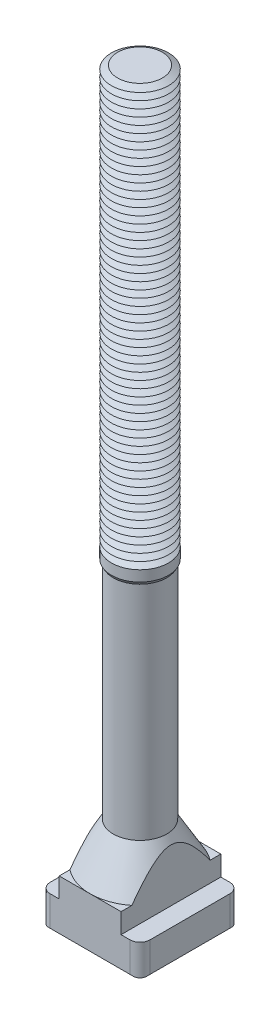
ISO-10303-21;
HEADER;
FILE_DESCRIPTION(('STEP AP214'),'2;1');
FILE_NAME('part.step','',(''),(''),'','','');
FILE_SCHEMA(('AUTOMOTIVE_DESIGN { 1 0 10303 214 1 1 1 1 }'));
ENDSEC;
DATA;
#1=APPLICATION_CONTEXT('core data for automotive mechanical design processes');
#2=APPLICATION_PROTOCOL_DEFINITION('international standard','automotive_design',2000,#1);
#3=PRODUCT_CONTEXT('',#1,'mechanical');
#4=PRODUCT('Part','Part','',(#3));
#5=PRODUCT_RELATED_PRODUCT_CATEGORY('part','',(#4));
#6=PRODUCT_DEFINITION_FORMATION('','',#4);
#7=PRODUCT_DEFINITION_CONTEXT('part definition',#1,'design');
#8=PRODUCT_DEFINITION('design','',#6,#7);
#9=PRODUCT_DEFINITION_SHAPE('','',#8);
#10=(LENGTH_UNIT() NAMED_UNIT(*) SI_UNIT(.MILLI.,.METRE.));
#11=(NAMED_UNIT(*) PLANE_ANGLE_UNIT() SI_UNIT($,.RADIAN.));
#12=(NAMED_UNIT(*) SI_UNIT($,.STERADIAN.) SOLID_ANGLE_UNIT());
#13=UNCERTAINTY_MEASURE_WITH_UNIT(LENGTH_MEASURE(1.E-05),#10,'distance_accuracy_value','');
#14=(GEOMETRIC_REPRESENTATION_CONTEXT(3) GLOBAL_UNCERTAINTY_ASSIGNED_CONTEXT((#13)) GLOBAL_UNIT_ASSIGNED_CONTEXT((#10,
#11,#12)) REPRESENTATION_CONTEXT('',''));
#15=CARTESIAN_POINT('',(0.,0.,0.));
#16=DIRECTION('',(0.,0.,1.));
#17=DIRECTION('',(1.,0.,0.));
#18=AXIS2_PLACEMENT_3D('',#15,#16,#17);
#19=CARTESIAN_POINT('',(0.,254.,0.));
#20=DIRECTION('',(0.,-1.,0.));
#21=DIRECTION('',(0.,0.,-1.));
#22=AXIS2_PLACEMENT_3D('',#19,#20,#21);
#23=CONICAL_SURFACE('',#22,7.83493649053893,1.04719755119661);
#24=CARTESIAN_POINT('',(0.,252.75,0.));
#25=DIRECTION('',(0.,-1.,0.));
#26=DIRECTION('',(0.,0.,-1.));
#27=AXIS2_PLACEMENT_3D('',#24,#25,#26);
#28=CIRCLE('',#27,10.);
#29=CARTESIAN_POINT('',(0.,252.75,-10.));
#30=VERTEX_POINT('',#29);
#31=EDGE_CURVE('E879',#30,#30,#28,.T.);
#32=ORIENTED_EDGE('',*,*,#31,.F.);
#33=EDGE_LOOP('',(#32));
#34=FACE_BOUND('',#33,.T.);
#35=CARTESIAN_POINT('',(0.,254.,0.));
#36=DIRECTION('',(0.,-1.,0.));
#37=DIRECTION('',(0.,0.,-1.));
#38=AXIS2_PLACEMENT_3D('',#35,#36,#37);
#39=CIRCLE('',#38,7.83493649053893);
#40=CARTESIAN_POINT('',(0.,254.,-7.83493649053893));
#41=VERTEX_POINT('',#40);
#42=EDGE_CURVE('E883',#41,#41,#39,.T.);
#43=ORIENTED_EDGE('',*,*,#42,.T.);
#44=EDGE_LOOP('',(#43));
#45=FACE_BOUND('',#44,.T.);
#46=ADVANCED_FACE('F39',(#34,#45),#23,.T.);
#47=CARTESIAN_POINT('',(0.,255.25,0.));
#48=DIRECTION('',(0.,1.,0.));
#49=DIRECTION('',(0.,0.,1.));
#50=AXIS2_PLACEMENT_3D('',#47,#48,#49);
#51=CONICAL_SURFACE('',#50,10.,1.04719755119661);
#52=ORIENTED_EDGE('',*,*,#42,.F.);
#53=EDGE_LOOP('',(#52));
#54=FACE_BOUND('',#53,.T.);
#55=CARTESIAN_POINT('',(0.,255.25,0.));
#56=DIRECTION('',(0.,-1.,0.));
#57=DIRECTION('',(0.,0.,-1.));
#58=AXIS2_PLACEMENT_3D('',#55,#56,#57);
#59=CIRCLE('',#58,10.);
#60=CARTESIAN_POINT('',(0.,255.25,-10.));
#61=VERTEX_POINT('',#60);
#62=EDGE_CURVE('E748',#61,#61,#59,.T.);
#63=ORIENTED_EDGE('',*,*,#62,.T.);
#64=EDGE_LOOP('',(#63));
#65=FACE_BOUND('',#64,.T.);
#66=ADVANCED_FACE('F449',(#54,#65),#51,.T.);
#67=CARTESIAN_POINT('',(4.71852950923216,264.,0.));
#68=DIRECTION('',(0.,-1.,0.));
#69=DIRECTION('',(1.,0.,0.));
#70=AXIS2_PLACEMENT_3D('',#67,#68,#69);
#71=PLANE('',#70);
#72=CARTESIAN_POINT('',(0.,264.,0.));
#73=DIRECTION('',(0.,-1.,0.));
#74=DIRECTION('',(0.,0.,-1.));
#75=AXIS2_PLACEMENT_3D('',#72,#73,#74);
#76=CIRCLE('',#75,7.83493649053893);
#77=CARTESIAN_POINT('',(0.,264.,-7.83493649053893));
#78=VERTEX_POINT('',#77);
#79=EDGE_CURVE('E762',#78,#78,#76,.T.);
#80=ORIENTED_EDGE('',*,*,#79,.F.);
#81=EDGE_LOOP('',(#80));
#82=FACE_BOUND('',#81,.T.);
#83=ADVANCED_FACE('F455',(#82),#71,.F.);
#84=CARTESIAN_POINT('',(0.,264.,0.));
#85=DIRECTION('',(0.,-1.,0.));
#86=DIRECTION('',(0.,0.,-1.));
#87=AXIS2_PLACEMENT_3D('',#84,#85,#86);
#88=CONICAL_SURFACE('',#87,7.83493649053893,1.04719755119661);
#89=CARTESIAN_POINT('',(0.,262.75,0.));
#90=DIRECTION('',(0.,-1.,0.));
#91=DIRECTION('',(0.,0.,-1.));
#92=AXIS2_PLACEMENT_3D('',#89,#90,#91);
#93=CIRCLE('',#92,10.);
#94=CARTESIAN_POINT('',(0.,262.75,-10.));
#95=VERTEX_POINT('',#94);
#96=EDGE_CURVE('E758',#95,#95,#93,.T.);
#97=ORIENTED_EDGE('',*,*,#96,.F.);
#98=EDGE_LOOP('',(#97));
#99=FACE_BOUND('',#98,.T.);
#100=ORIENTED_EDGE('',*,*,#79,.T.);
#101=EDGE_LOOP('',(#100));
#102=FACE_BOUND('',#101,.T.);
#103=ADVANCED_FACE('F483',(#99,#102),#88,.T.);
#104=CARTESIAN_POINT('',(0.,262.75,0.));
#105=DIRECTION('',(0.,1.,0.));
#106=DIRECTION('',(0.,0.,1.));
#107=AXIS2_PLACEMENT_3D('',#104,#105,#106);
#108=CONICAL_SURFACE('',#107,10.,1.04719755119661);
#109=CARTESIAN_POINT('',(0.,261.5,0.));
#110=DIRECTION('',(0.,-1.,0.));
#111=DIRECTION('',(0.,0.,-1.));
#112=AXIS2_PLACEMENT_3D('',#109,#110,#111);
#113=CIRCLE('',#112,7.83493649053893);
#114=CARTESIAN_POINT('',(0.,261.5,-7.83493649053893));
#115=VERTEX_POINT('',#114);
#116=EDGE_CURVE('E754',#115,#115,#113,.T.);
#117=ORIENTED_EDGE('',*,*,#116,.F.);
#118=EDGE_LOOP('',(#117));
#119=FACE_BOUND('',#118,.T.);
#120=ORIENTED_EDGE('',*,*,#96,.T.);
#121=EDGE_LOOP('',(#120));
#122=FACE_BOUND('',#121,.T.);
#123=ADVANCED_FACE('F480',(#119,#122),#108,.T.);
#124=CARTESIAN_POINT('',(0.,261.5,0.));
#125=DIRECTION('',(0.,-1.,0.));
#126=DIRECTION('',(0.,0.,-1.));
#127=AXIS2_PLACEMENT_3D('',#124,#125,#126);
#128=CONICAL_SURFACE('',#127,7.83493649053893,1.04719755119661);
#129=CARTESIAN_POINT('',(0.,260.25,0.));
#130=DIRECTION('',(0.,-1.,0.));
#131=DIRECTION('',(0.,0.,-1.));
#132=AXIS2_PLACEMENT_3D('',#129,#130,#131);
#133=CIRCLE('',#132,10.);
#134=CARTESIAN_POINT('',(0.,260.25,-10.));
#135=VERTEX_POINT('',#134);
#136=EDGE_CURVE('E633',#135,#135,#133,.T.);
#137=ORIENTED_EDGE('',*,*,#136,.F.);
#138=EDGE_LOOP('',(#137));
#139=FACE_BOUND('',#138,.T.);
#140=ORIENTED_EDGE('',*,*,#116,.T.);
#141=EDGE_LOOP('',(#140));
#142=FACE_BOUND('',#141,.T.);
#143=ADVANCED_FACE('F475',(#139,#142),#128,.T.);
#144=CARTESIAN_POINT('',(0.,260.25,0.));
#145=DIRECTION('',(0.,1.,0.));
#146=DIRECTION('',(0.,0.,1.));
#147=AXIS2_PLACEMENT_3D('',#144,#145,#146);
#148=CONICAL_SURFACE('',#147,10.,1.04719755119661);
#149=CARTESIAN_POINT('',(0.,259.,0.));
#150=DIRECTION('',(0.,-1.,0.));
#151=DIRECTION('',(0.,0.,-1.));
#152=AXIS2_PLACEMENT_3D('',#149,#150,#151);
#153=CIRCLE('',#152,7.83493649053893);
#154=CARTESIAN_POINT('',(0.,259.,-7.83493649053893));
#155=VERTEX_POINT('',#154);
#156=EDGE_CURVE('E738',#155,#155,#153,.T.);
#157=ORIENTED_EDGE('',*,*,#156,.F.);
#158=EDGE_LOOP('',(#157));
#159=FACE_BOUND('',#158,.T.);
#160=ORIENTED_EDGE('',*,*,#136,.T.);
#161=EDGE_LOOP('',(#160));
#162=FACE_BOUND('',#161,.T.);
#163=ADVANCED_FACE('F472',(#159,#162),#148,.T.);
#164=CARTESIAN_POINT('',(0.,259.,0.));
#165=DIRECTION('',(0.,-1.,0.));
#166=DIRECTION('',(0.,0.,-1.));
#167=AXIS2_PLACEMENT_3D('',#164,#165,#166);
#168=CONICAL_SURFACE('',#167,7.83493649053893,1.04719755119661);
#169=CARTESIAN_POINT('',(0.,257.75,0.));
#170=DIRECTION('',(0.,-1.,0.));
#171=DIRECTION('',(0.,0.,-1.));
#172=AXIS2_PLACEMENT_3D('',#169,#170,#171);
#173=CIRCLE('',#172,10.);
#174=CARTESIAN_POINT('',(0.,257.75,-10.));
#175=VERTEX_POINT('',#174);
#176=EDGE_CURVE('E736',#175,#175,#173,.T.);
#177=ORIENTED_EDGE('',*,*,#176,.F.);
#178=EDGE_LOOP('',(#177));
#179=FACE_BOUND('',#178,.T.);
#180=ORIENTED_EDGE('',*,*,#156,.T.);
#181=EDGE_LOOP('',(#180));
#182=FACE_BOUND('',#181,.T.);
#183=ADVANCED_FACE('F466',(#179,#182),#168,.T.);
#184=CARTESIAN_POINT('',(0.,257.75,0.));
#185=DIRECTION('',(0.,1.,0.));
#186=DIRECTION('',(0.,0.,1.));
#187=AXIS2_PLACEMENT_3D('',#184,#185,#186);
#188=CONICAL_SURFACE('',#187,10.,1.04719755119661);
#189=CARTESIAN_POINT('',(0.,256.5,0.));
#190=DIRECTION('',(0.,-1.,0.));
#191=DIRECTION('',(0.,0.,-1.));
#192=AXIS2_PLACEMENT_3D('',#189,#190,#191);
#193=CIRCLE('',#192,7.83493649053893);
#194=CARTESIAN_POINT('',(0.,256.5,-7.83493649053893));
#195=VERTEX_POINT('',#194);
#196=EDGE_CURVE('E739',#195,#195,#193,.T.);
#197=ORIENTED_EDGE('',*,*,#196,.F.);
#198=EDGE_LOOP('',(#197));
#199=FACE_BOUND('',#198,.T.);
#200=ORIENTED_EDGE('',*,*,#176,.T.);
#201=EDGE_LOOP('',(#200));
#202=FACE_BOUND('',#201,.T.);
#203=ADVANCED_FACE('F462',(#199,#202),#188,.T.);
#204=CARTESIAN_POINT('',(0.,256.5,0.));
#205=DIRECTION('',(0.,-1.,0.));
#206=DIRECTION('',(0.,0.,-1.));
#207=AXIS2_PLACEMENT_3D('',#204,#205,#206);
#208=CONICAL_SURFACE('',#207,7.83493649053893,1.04719755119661);
#209=ORIENTED_EDGE('',*,*,#62,.F.);
#210=EDGE_LOOP('',(#209));
#211=FACE_BOUND('',#210,.T.);
#212=ORIENTED_EDGE('',*,*,#196,.T.);
#213=EDGE_LOOP('',(#212));
#214=FACE_BOUND('',#213,.T.);
#215=ADVANCED_FACE('F465',(#211,#214),#208,.T.);
#216=CARTESIAN_POINT('',(0.,251.5,0.));
#217=DIRECTION('',(0.,-1.,0.));
#218=DIRECTION('',(0.,0.,-1.));
#219=AXIS2_PLACEMENT_3D('',#216,#217,#218);
#220=CONICAL_SURFACE('',#219,7.83493649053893,1.04719755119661);
#221=CARTESIAN_POINT('',(0.,250.25,0.));
#222=DIRECTION('',(0.,-1.,0.));
#223=DIRECTION('',(0.,0.,-1.));
#224=AXIS2_PLACEMENT_3D('',#221,#222,#223);
#225=CIRCLE('',#224,10.);
#226=CARTESIAN_POINT('',(0.,250.25,-10.));
#227=VERTEX_POINT('',#226);
#228=EDGE_CURVE('E872',#227,#227,#225,.T.);
#229=ORIENTED_EDGE('',*,*,#228,.F.);
#230=EDGE_LOOP('',(#229));
#231=FACE_BOUND('',#230,.T.);
#232=CARTESIAN_POINT('',(0.,251.5,0.));
#233=DIRECTION('',(0.,-1.,0.));
#234=DIRECTION('',(0.,0.,-1.));
#235=AXIS2_PLACEMENT_3D('',#232,#233,#234);
#236=CIRCLE('',#235,7.83493649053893);
#237=CARTESIAN_POINT('',(0.,251.5,-7.83493649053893));
#238=VERTEX_POINT('',#237);
#239=EDGE_CURVE('E876',#238,#238,#236,.T.);
#240=ORIENTED_EDGE('',*,*,#239,.T.);
#241=EDGE_LOOP('',(#240));
#242=FACE_BOUND('',#241,.T.);
#243=ADVANCED_FACE('F470',(#231,#242),#220,.T.);
#244=CARTESIAN_POINT('',(0.,252.75,0.));
#245=DIRECTION('',(0.,1.,0.));
#246=DIRECTION('',(0.,0.,1.));
#247=AXIS2_PLACEMENT_3D('',#244,#245,#246);
#248=CONICAL_SURFACE('',#247,10.,1.04719755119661);
#249=ORIENTED_EDGE('',*,*,#239,.F.);
#250=EDGE_LOOP('',(#249));
#251=FACE_BOUND('',#250,.T.);
#252=ORIENTED_EDGE('',*,*,#31,.T.);
#253=EDGE_LOOP('',(#252));
#254=FACE_BOUND('',#253,.T.);
#255=ADVANCED_FACE('F1096',(#251,#254),#248,.T.);
#256=CARTESIAN_POINT('',(0.,249.,0.));
#257=DIRECTION('',(0.,-1.,0.));
#258=DIRECTION('',(0.,0.,-1.));
#259=AXIS2_PLACEMENT_3D('',#256,#257,#258);
#260=CONICAL_SURFACE('',#259,7.83493649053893,1.04719755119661);
#261=CARTESIAN_POINT('',(0.,247.75,0.));
#262=DIRECTION('',(0.,-1.,0.));
#263=DIRECTION('',(0.,0.,-1.));
#264=AXIS2_PLACEMENT_3D('',#261,#262,#263);
#265=CIRCLE('',#264,10.);
#266=CARTESIAN_POINT('',(0.,247.75,-10.));
#267=VERTEX_POINT('',#266);
#268=EDGE_CURVE('E864',#267,#267,#265,.T.);
#269=ORIENTED_EDGE('',*,*,#268,.F.);
#270=EDGE_LOOP('',(#269));
#271=FACE_BOUND('',#270,.T.);
#272=CARTESIAN_POINT('',(0.,249.,0.));
#273=DIRECTION('',(0.,-1.,0.));
#274=DIRECTION('',(0.,0.,-1.));
#275=AXIS2_PLACEMENT_3D('',#272,#273,#274);
#276=CIRCLE('',#275,7.83493649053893);
#277=CARTESIAN_POINT('',(0.,249.,-7.83493649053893));
#278=VERTEX_POINT('',#277);
#279=EDGE_CURVE('E868',#278,#278,#276,.T.);
#280=ORIENTED_EDGE('',*,*,#279,.T.);
#281=EDGE_LOOP('',(#280));
#282=FACE_BOUND('',#281,.T.);
#283=ADVANCED_FACE('F1092',(#271,#282),#260,.T.);
#284=CARTESIAN_POINT('',(0.,250.25,0.));
#285=DIRECTION('',(0.,1.,0.));
#286=DIRECTION('',(0.,0.,1.));
#287=AXIS2_PLACEMENT_3D('',#284,#285,#286);
#288=CONICAL_SURFACE('',#287,10.,1.04719755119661);
#289=ORIENTED_EDGE('',*,*,#279,.F.);
#290=EDGE_LOOP('',(#289));
#291=FACE_BOUND('',#290,.T.);
#292=ORIENTED_EDGE('',*,*,#228,.T.);
#293=EDGE_LOOP('',(#292));
#294=FACE_BOUND('',#293,.T.);
#295=ADVANCED_FACE('F1088',(#291,#294),#288,.T.);
#296=CARTESIAN_POINT('',(0.,246.5,0.));
#297=DIRECTION('',(0.,-1.,0.));
#298=DIRECTION('',(0.,0.,-1.));
#299=AXIS2_PLACEMENT_3D('',#296,#297,#298);
#300=CONICAL_SURFACE('',#299,7.83493649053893,1.04719755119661);
#301=CARTESIAN_POINT('',(0.,245.25,0.));
#302=DIRECTION('',(0.,-1.,0.));
#303=DIRECTION('',(0.,0.,-1.));
#304=AXIS2_PLACEMENT_3D('',#301,#302,#303);
#305=CIRCLE('',#304,10.);
#306=CARTESIAN_POINT('',(0.,245.25,-10.));
#307=VERTEX_POINT('',#306);
#308=EDGE_CURVE('E856',#307,#307,#305,.T.);
#309=ORIENTED_EDGE('',*,*,#308,.F.);
#310=EDGE_LOOP('',(#309));
#311=FACE_BOUND('',#310,.T.);
#312=CARTESIAN_POINT('',(0.,246.5,0.));
#313=DIRECTION('',(0.,-1.,0.));
#314=DIRECTION('',(0.,0.,-1.));
#315=AXIS2_PLACEMENT_3D('',#312,#313,#314);
#316=CIRCLE('',#315,7.83493649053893);
#317=CARTESIAN_POINT('',(0.,246.5,-7.83493649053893));
#318=VERTEX_POINT('',#317);
#319=EDGE_CURVE('E860',#318,#318,#316,.T.);
#320=ORIENTED_EDGE('',*,*,#319,.T.);
#321=EDGE_LOOP('',(#320));
#322=FACE_BOUND('',#321,.T.);
#323=ADVANCED_FACE('F1084',(#311,#322),#300,.T.);
#324=CARTESIAN_POINT('',(0.,247.75,0.));
#325=DIRECTION('',(0.,1.,0.));
#326=DIRECTION('',(0.,0.,1.));
#327=AXIS2_PLACEMENT_3D('',#324,#325,#326);
#328=CONICAL_SURFACE('',#327,10.,1.04719755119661);
#329=ORIENTED_EDGE('',*,*,#319,.F.);
#330=EDGE_LOOP('',(#329));
#331=FACE_BOUND('',#330,.T.);
#332=ORIENTED_EDGE('',*,*,#268,.T.);
#333=EDGE_LOOP('',(#332));
#334=FACE_BOUND('',#333,.T.);
#335=ADVANCED_FACE('F1080',(#331,#334),#328,.T.);
#336=CARTESIAN_POINT('',(0.,244.,0.));
#337=DIRECTION('',(0.,-1.,0.));
#338=DIRECTION('',(0.,0.,-1.));
#339=AXIS2_PLACEMENT_3D('',#336,#337,#338);
#340=CONICAL_SURFACE('',#339,7.83493649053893,1.04719755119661);
#341=CARTESIAN_POINT('',(0.,242.75,0.));
#342=DIRECTION('',(0.,-1.,0.));
#343=DIRECTION('',(0.,0.,-1.));
#344=AXIS2_PLACEMENT_3D('',#341,#342,#343);
#345=CIRCLE('',#344,10.);
#346=CARTESIAN_POINT('',(0.,242.75,-10.));
#347=VERTEX_POINT('',#346);
#348=EDGE_CURVE('E848',#347,#347,#345,.T.);
#349=ORIENTED_EDGE('',*,*,#348,.F.);
#350=EDGE_LOOP('',(#349));
#351=FACE_BOUND('',#350,.T.);
#352=CARTESIAN_POINT('',(0.,244.,0.));
#353=DIRECTION('',(0.,-1.,0.));
#354=DIRECTION('',(0.,0.,-1.));
#355=AXIS2_PLACEMENT_3D('',#352,#353,#354);
#356=CIRCLE('',#355,7.83493649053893);
#357=CARTESIAN_POINT('',(0.,244.,-7.83493649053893));
#358=VERTEX_POINT('',#357);
#359=EDGE_CURVE('E852',#358,#358,#356,.T.);
#360=ORIENTED_EDGE('',*,*,#359,.T.);
#361=EDGE_LOOP('',(#360));
#362=FACE_BOUND('',#361,.T.);
#363=ADVANCED_FACE('F1076',(#351,#362),#340,.T.);
#364=CARTESIAN_POINT('',(0.,245.25,0.));
#365=DIRECTION('',(0.,1.,0.));
#366=DIRECTION('',(0.,0.,1.));
#367=AXIS2_PLACEMENT_3D('',#364,#365,#366);
#368=CONICAL_SURFACE('',#367,10.,1.04719755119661);
#369=ORIENTED_EDGE('',*,*,#359,.F.);
#370=EDGE_LOOP('',(#369));
#371=FACE_BOUND('',#370,.T.);
#372=ORIENTED_EDGE('',*,*,#308,.T.);
#373=EDGE_LOOP('',(#372));
#374=FACE_BOUND('',#373,.T.);
#375=ADVANCED_FACE('F1072',(#371,#374),#368,.T.);
#376=CARTESIAN_POINT('',(0.,241.5,0.));
#377=DIRECTION('',(0.,-1.,0.));
#378=DIRECTION('',(0.,0.,-1.));
#379=AXIS2_PLACEMENT_3D('',#376,#377,#378);
#380=CONICAL_SURFACE('',#379,7.83493649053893,1.04719755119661);
#381=CARTESIAN_POINT('',(0.,240.25,0.));
#382=DIRECTION('',(0.,-1.,0.));
#383=DIRECTION('',(0.,0.,-1.));
#384=AXIS2_PLACEMENT_3D('',#381,#382,#383);
#385=CIRCLE('',#384,10.);
#386=CARTESIAN_POINT('',(0.,240.25,-10.));
#387=VERTEX_POINT('',#386);
#388=EDGE_CURVE('E681',#387,#387,#385,.T.);
#389=ORIENTED_EDGE('',*,*,#388,.F.);
#390=EDGE_LOOP('',(#389));
#391=FACE_BOUND('',#390,.T.);
#392=CARTESIAN_POINT('',(0.,241.5,0.));
#393=DIRECTION('',(0.,-1.,0.));
#394=DIRECTION('',(0.,0.,-1.));
#395=AXIS2_PLACEMENT_3D('',#392,#393,#394);
#396=CIRCLE('',#395,7.83493649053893);
#397=CARTESIAN_POINT('',(0.,241.5,-7.83493649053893));
#398=VERTEX_POINT('',#397);
#399=EDGE_CURVE('E844',#398,#398,#396,.T.);
#400=ORIENTED_EDGE('',*,*,#399,.T.);
#401=EDGE_LOOP('',(#400));
#402=FACE_BOUND('',#401,.T.);
#403=ADVANCED_FACE('F1068',(#391,#402),#380,.T.);
#404=CARTESIAN_POINT('',(0.,242.75,0.));
#405=DIRECTION('',(0.,1.,0.));
#406=DIRECTION('',(0.,0.,1.));
#407=AXIS2_PLACEMENT_3D('',#404,#405,#406);
#408=CONICAL_SURFACE('',#407,10.,1.04719755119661);
#409=ORIENTED_EDGE('',*,*,#399,.F.);
#410=EDGE_LOOP('',(#409));
#411=FACE_BOUND('',#410,.T.);
#412=ORIENTED_EDGE('',*,*,#348,.T.);
#413=EDGE_LOOP('',(#412));
#414=FACE_BOUND('',#413,.T.);
#415=ADVANCED_FACE('F1064',(#411,#414),#408,.T.);
#416=CARTESIAN_POINT('',(0.,239.,0.));
#417=DIRECTION('',(0.,-1.,0.));
#418=DIRECTION('',(0.,0.,-1.));
#419=AXIS2_PLACEMENT_3D('',#416,#417,#418);
#420=CONICAL_SURFACE('',#419,7.83493649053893,1.04719755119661);
#421=CARTESIAN_POINT('',(0.,237.75,0.));
#422=DIRECTION('',(0.,-1.,0.));
#423=DIRECTION('',(0.,0.,-1.));
#424=AXIS2_PLACEMENT_3D('',#421,#422,#423);
#425=CIRCLE('',#424,10.);
#426=CARTESIAN_POINT('',(0.,237.75,-10.));
#427=VERTEX_POINT('',#426);
#428=EDGE_CURVE('E682',#427,#427,#425,.T.);
#429=ORIENTED_EDGE('',*,*,#428,.F.);
#430=EDGE_LOOP('',(#429));
#431=FACE_BOUND('',#430,.T.);
#432=CARTESIAN_POINT('',(0.,239.,0.));
#433=DIRECTION('',(0.,-1.,0.));
#434=DIRECTION('',(0.,0.,-1.));
#435=AXIS2_PLACEMENT_3D('',#432,#433,#434);
#436=CIRCLE('',#435,7.83493649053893);
#437=CARTESIAN_POINT('',(0.,239.,-7.83493649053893));
#438=VERTEX_POINT('',#437);
#439=EDGE_CURVE('E678',#438,#438,#436,.T.);
#440=ORIENTED_EDGE('',*,*,#439,.T.);
#441=EDGE_LOOP('',(#440));
#442=FACE_BOUND('',#441,.T.);
#443=ADVANCED_FACE('F1060',(#431,#442),#420,.T.);
#444=CARTESIAN_POINT('',(0.,240.25,0.));
#445=DIRECTION('',(0.,1.,0.));
#446=DIRECTION('',(0.,0.,1.));
#447=AXIS2_PLACEMENT_3D('',#444,#445,#446);
#448=CONICAL_SURFACE('',#447,10.,1.04719755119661);
#449=ORIENTED_EDGE('',*,*,#439,.F.);
#450=EDGE_LOOP('',(#449));
#451=FACE_BOUND('',#450,.T.);
#452=ORIENTED_EDGE('',*,*,#388,.T.);
#453=EDGE_LOOP('',(#452));
#454=FACE_BOUND('',#453,.T.);
#455=ADVANCED_FACE('F1056',(#451,#454),#448,.T.);
#456=CARTESIAN_POINT('',(0.,236.5,0.));
#457=DIRECTION('',(0.,-1.,0.));
#458=DIRECTION('',(0.,0.,-1.));
#459=AXIS2_PLACEMENT_3D('',#456,#457,#458);
#460=CONICAL_SURFACE('',#459,7.83493649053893,1.04719755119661);
#461=CARTESIAN_POINT('',(0.,235.25,0.));
#462=DIRECTION('',(0.,-1.,0.));
#463=DIRECTION('',(0.,0.,-1.));
#464=AXIS2_PLACEMENT_3D('',#461,#462,#463);
#465=CIRCLE('',#464,10.);
#466=CARTESIAN_POINT('',(0.,235.25,-10.));
#467=VERTEX_POINT('',#466);
#468=EDGE_CURVE('E734',#467,#467,#465,.T.);
#469=ORIENTED_EDGE('',*,*,#468,.F.);
#470=EDGE_LOOP('',(#469));
#471=FACE_BOUND('',#470,.T.);
#472=CARTESIAN_POINT('',(0.,236.5,0.));
#473=DIRECTION('',(0.,-1.,0.));
#474=DIRECTION('',(0.,0.,-1.));
#475=AXIS2_PLACEMENT_3D('',#472,#473,#474);
#476=CIRCLE('',#475,7.83493649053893);
#477=CARTESIAN_POINT('',(0.,236.5,-7.83493649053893));
#478=VERTEX_POINT('',#477);
#479=EDGE_CURVE('E731',#478,#478,#476,.T.);
#480=ORIENTED_EDGE('',*,*,#479,.T.);
#481=EDGE_LOOP('',(#480));
#482=FACE_BOUND('',#481,.T.);
#483=ADVANCED_FACE('F1052',(#471,#482),#460,.T.);
#484=CARTESIAN_POINT('',(0.,237.75,0.));
#485=DIRECTION('',(0.,1.,0.));
#486=DIRECTION('',(0.,0.,1.));
#487=AXIS2_PLACEMENT_3D('',#484,#485,#486);
#488=CONICAL_SURFACE('',#487,10.,1.04719755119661);
#489=ORIENTED_EDGE('',*,*,#479,.F.);
#490=EDGE_LOOP('',(#489));
#491=FACE_BOUND('',#490,.T.);
#492=ORIENTED_EDGE('',*,*,#428,.T.);
#493=EDGE_LOOP('',(#492));
#494=FACE_BOUND('',#493,.T.);
#495=ADVANCED_FACE('F1048',(#491,#494),#488,.T.);
#496=CARTESIAN_POINT('',(0.,234.,0.));
#497=DIRECTION('',(0.,-1.,0.));
#498=DIRECTION('',(0.,0.,-1.));
#499=AXIS2_PLACEMENT_3D('',#496,#497,#498);
#500=CONICAL_SURFACE('',#499,7.83493649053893,1.04719755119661);
#501=CARTESIAN_POINT('',(0.,232.75,0.));
#502=DIRECTION('',(0.,-1.,0.));
#503=DIRECTION('',(0.,0.,-1.));
#504=AXIS2_PLACEMENT_3D('',#501,#502,#503);
#505=CIRCLE('',#504,10.);
#506=CARTESIAN_POINT('',(0.,232.75,-10.));
#507=VERTEX_POINT('',#506);
#508=EDGE_CURVE('E827',#507,#507,#505,.T.);
#509=ORIENTED_EDGE('',*,*,#508,.F.);
#510=EDGE_LOOP('',(#509));
#511=FACE_BOUND('',#510,.T.);
#512=CARTESIAN_POINT('',(0.,234.,0.));
#513=DIRECTION('',(0.,-1.,0.));
#514=DIRECTION('',(0.,0.,-1.));
#515=AXIS2_PLACEMENT_3D('',#512,#513,#514);
#516=CIRCLE('',#515,7.83493649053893);
#517=CARTESIAN_POINT('',(0.,234.,-7.83493649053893));
#518=VERTEX_POINT('',#517);
#519=EDGE_CURVE('E831',#518,#518,#516,.T.);
#520=ORIENTED_EDGE('',*,*,#519,.T.);
#521=EDGE_LOOP('',(#520));
#522=FACE_BOUND('',#521,.T.);
#523=ADVANCED_FACE('F1044',(#511,#522),#500,.T.);
#524=CARTESIAN_POINT('',(0.,235.25,0.));
#525=DIRECTION('',(0.,1.,0.));
#526=DIRECTION('',(0.,0.,1.));
#527=AXIS2_PLACEMENT_3D('',#524,#525,#526);
#528=CONICAL_SURFACE('',#527,10.,1.04719755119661);
#529=ORIENTED_EDGE('',*,*,#519,.F.);
#530=EDGE_LOOP('',(#529));
#531=FACE_BOUND('',#530,.T.);
#532=ORIENTED_EDGE('',*,*,#468,.T.);
#533=EDGE_LOOP('',(#532));
#534=FACE_BOUND('',#533,.T.);
#535=ADVANCED_FACE('F1040',(#531,#534),#528,.T.);
#536=CARTESIAN_POINT('',(0.,231.5,0.));
#537=DIRECTION('',(0.,-1.,0.));
#538=DIRECTION('',(0.,0.,-1.));
#539=AXIS2_PLACEMENT_3D('',#536,#537,#538);
#540=CONICAL_SURFACE('',#539,7.83493649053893,1.04719755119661);
#541=CARTESIAN_POINT('',(0.,230.25,0.));
#542=DIRECTION('',(0.,-1.,0.));
#543=DIRECTION('',(0.,0.,-1.));
#544=AXIS2_PLACEMENT_3D('',#541,#542,#543);
#545=CIRCLE('',#544,10.);
#546=CARTESIAN_POINT('',(0.,230.25,-10.));
#547=VERTEX_POINT('',#546);
#548=EDGE_CURVE('E816',#547,#547,#545,.T.);
#549=ORIENTED_EDGE('',*,*,#548,.F.);
#550=EDGE_LOOP('',(#549));
#551=FACE_BOUND('',#550,.T.);
#552=CARTESIAN_POINT('',(0.,231.5,0.));
#553=DIRECTION('',(0.,-1.,0.));
#554=DIRECTION('',(0.,0.,-1.));
#555=AXIS2_PLACEMENT_3D('',#552,#553,#554);
#556=CIRCLE('',#555,7.83493649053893);
#557=CARTESIAN_POINT('',(0.,231.5,-7.83493649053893));
#558=VERTEX_POINT('',#557);
#559=EDGE_CURVE('E823',#558,#558,#556,.T.);
#560=ORIENTED_EDGE('',*,*,#559,.T.);
#561=EDGE_LOOP('',(#560));
#562=FACE_BOUND('',#561,.T.);
#563=ADVANCED_FACE('F1036',(#551,#562),#540,.T.);
#564=CARTESIAN_POINT('',(0.,232.75,0.));
#565=DIRECTION('',(0.,1.,0.));
#566=DIRECTION('',(0.,0.,1.));
#567=AXIS2_PLACEMENT_3D('',#564,#565,#566);
#568=CONICAL_SURFACE('',#567,10.,1.04719755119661);
#569=ORIENTED_EDGE('',*,*,#559,.F.);
#570=EDGE_LOOP('',(#569));
#571=FACE_BOUND('',#570,.T.);
#572=ORIENTED_EDGE('',*,*,#508,.T.);
#573=EDGE_LOOP('',(#572));
#574=FACE_BOUND('',#573,.T.);
#575=ADVANCED_FACE('F1032',(#571,#574),#568,.T.);
#576=CARTESIAN_POINT('',(0.,229.,0.));
#577=DIRECTION('',(0.,-1.,0.));
#578=DIRECTION('',(0.,0.,-1.));
#579=AXIS2_PLACEMENT_3D('',#576,#577,#578);
#580=CONICAL_SURFACE('',#579,7.83493649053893,1.04719755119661);
#581=CARTESIAN_POINT('',(0.,227.75,0.));
#582=DIRECTION('',(0.,-1.,0.));
#583=DIRECTION('',(0.,0.,-1.));
#584=AXIS2_PLACEMENT_3D('',#581,#582,#583);
#585=CIRCLE('',#584,10.);
#586=CARTESIAN_POINT('',(0.,227.75,-10.));
#587=VERTEX_POINT('',#586);
#588=EDGE_CURVE('E806',#587,#587,#585,.T.);
#589=ORIENTED_EDGE('',*,*,#588,.F.);
#590=EDGE_LOOP('',(#589));
#591=FACE_BOUND('',#590,.T.);
#592=CARTESIAN_POINT('',(0.,229.,0.));
#593=DIRECTION('',(0.,-1.,0.));
#594=DIRECTION('',(0.,0.,-1.));
#595=AXIS2_PLACEMENT_3D('',#592,#593,#594);
#596=CIRCLE('',#595,7.83493649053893);
#597=CARTESIAN_POINT('',(0.,229.,-7.83493649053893));
#598=VERTEX_POINT('',#597);
#599=EDGE_CURVE('E810',#598,#598,#596,.T.);
#600=ORIENTED_EDGE('',*,*,#599,.T.);
#601=EDGE_LOOP('',(#600));
#602=FACE_BOUND('',#601,.T.);
#603=ADVANCED_FACE('F1028',(#591,#602),#580,.T.);
#604=CARTESIAN_POINT('',(0.,230.25,0.));
#605=DIRECTION('',(0.,1.,0.));
#606=DIRECTION('',(0.,0.,1.));
#607=AXIS2_PLACEMENT_3D('',#604,#605,#606);
#608=CONICAL_SURFACE('',#607,10.,1.04719755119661);
#609=ORIENTED_EDGE('',*,*,#599,.F.);
#610=EDGE_LOOP('',(#609));
#611=FACE_BOUND('',#610,.T.);
#612=ORIENTED_EDGE('',*,*,#548,.T.);
#613=EDGE_LOOP('',(#612));
#614=FACE_BOUND('',#613,.T.);
#615=ADVANCED_FACE('F1012',(#611,#614),#608,.T.);
#616=CARTESIAN_POINT('',(0.,226.5,0.));
#617=DIRECTION('',(0.,-1.,0.));
#618=DIRECTION('',(0.,0.,-1.));
#619=AXIS2_PLACEMENT_3D('',#616,#617,#618);
#620=CONICAL_SURFACE('',#619,7.83493649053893,1.04719755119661);
#621=CARTESIAN_POINT('',(0.,225.25,0.));
#622=DIRECTION('',(0.,-1.,0.));
#623=DIRECTION('',(0.,0.,-1.));
#624=AXIS2_PLACEMENT_3D('',#621,#622,#623);
#625=CIRCLE('',#624,10.);
#626=CARTESIAN_POINT('',(0.,225.25,-10.));
#627=VERTEX_POINT('',#626);
#628=EDGE_CURVE('E807',#627,#627,#625,.T.);
#629=ORIENTED_EDGE('',*,*,#628,.F.);
#630=EDGE_LOOP('',(#629));
#631=FACE_BOUND('',#630,.T.);
#632=CARTESIAN_POINT('',(0.,226.5,0.));
#633=DIRECTION('',(0.,-1.,0.));
#634=DIRECTION('',(0.,0.,-1.));
#635=AXIS2_PLACEMENT_3D('',#632,#633,#634);
#636=CIRCLE('',#635,7.83493649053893);
#637=CARTESIAN_POINT('',(0.,226.5,-7.83493649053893));
#638=VERTEX_POINT('',#637);
#639=EDGE_CURVE('E804',#638,#638,#636,.T.);
#640=ORIENTED_EDGE('',*,*,#639,.T.);
#641=EDGE_LOOP('',(#640));
#642=FACE_BOUND('',#641,.T.);
#643=ADVANCED_FACE('F1008',(#631,#642),#620,.T.);
#644=CARTESIAN_POINT('',(0.,227.75,0.));
#645=DIRECTION('',(0.,1.,0.));
#646=DIRECTION('',(0.,0.,1.));
#647=AXIS2_PLACEMENT_3D('',#644,#645,#646);
#648=CONICAL_SURFACE('',#647,10.,1.04719755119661);
#649=ORIENTED_EDGE('',*,*,#639,.F.);
#650=EDGE_LOOP('',(#649));
#651=FACE_BOUND('',#650,.T.);
#652=ORIENTED_EDGE('',*,*,#588,.T.);
#653=EDGE_LOOP('',(#652));
#654=FACE_BOUND('',#653,.T.);
#655=ADVANCED_FACE('F1011',(#651,#654),#648,.T.);
#656=CARTESIAN_POINT('',(0.,224.,0.));
#657=DIRECTION('',(0.,-1.,0.));
#658=DIRECTION('',(0.,0.,-1.));
#659=AXIS2_PLACEMENT_3D('',#656,#657,#658);
#660=CONICAL_SURFACE('',#659,7.83493649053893,1.04719755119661);
#661=CARTESIAN_POINT('',(0.,222.75,0.));
#662=DIRECTION('',(0.,-1.,0.));
#663=DIRECTION('',(0.,0.,-1.));
#664=AXIS2_PLACEMENT_3D('',#661,#662,#663);
#665=CIRCLE('',#664,10.);
#666=CARTESIAN_POINT('',(0.,222.75,-10.));
#667=VERTEX_POINT('',#666);
#668=EDGE_CURVE('E923',#667,#667,#665,.T.);
#669=ORIENTED_EDGE('',*,*,#668,.F.);
#670=EDGE_LOOP('',(#669));
#671=FACE_BOUND('',#670,.T.);
#672=CARTESIAN_POINT('',(0.,224.,0.));
#673=DIRECTION('',(0.,-1.,0.));
#674=DIRECTION('',(0.,0.,-1.));
#675=AXIS2_PLACEMENT_3D('',#672,#673,#674);
#676=CIRCLE('',#675,7.83493649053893);
#677=CARTESIAN_POINT('',(0.,224.,-7.83493649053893));
#678=VERTEX_POINT('',#677);
#679=EDGE_CURVE('E999',#678,#678,#676,.T.);
#680=ORIENTED_EDGE('',*,*,#679,.T.);
#681=EDGE_LOOP('',(#680));
#682=FACE_BOUND('',#681,.T.);
#683=ADVANCED_FACE('F1017',(#671,#682),#660,.T.);
#684=CARTESIAN_POINT('',(0.,225.25,0.));
#685=DIRECTION('',(0.,1.,0.));
#686=DIRECTION('',(0.,0.,1.));
#687=AXIS2_PLACEMENT_3D('',#684,#685,#686);
#688=CONICAL_SURFACE('',#687,10.,1.04719755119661);
#689=ORIENTED_EDGE('',*,*,#679,.F.);
#690=EDGE_LOOP('',(#689));
#691=FACE_BOUND('',#690,.T.);
#692=ORIENTED_EDGE('',*,*,#628,.T.);
#693=EDGE_LOOP('',(#692));
#694=FACE_BOUND('',#693,.T.);
#695=ADVANCED_FACE('F1006',(#691,#694),#688,.T.);
#696=CARTESIAN_POINT('',(0.,221.5,0.));
#697=DIRECTION('',(0.,-1.,0.));
#698=DIRECTION('',(0.,0.,-1.));
#699=AXIS2_PLACEMENT_3D('',#696,#697,#698);
#700=CONICAL_SURFACE('',#699,7.83493649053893,1.04719755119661);
#701=CARTESIAN_POINT('',(0.,220.25,0.));
#702=DIRECTION('',(0.,-1.,0.));
#703=DIRECTION('',(0.,0.,-1.));
#704=AXIS2_PLACEMENT_3D('',#701,#702,#703);
#705=CIRCLE('',#704,10.);
#706=CARTESIAN_POINT('',(0.,220.25,-10.));
#707=VERTEX_POINT('',#706);
#708=EDGE_CURVE('E924',#707,#707,#705,.T.);
#709=ORIENTED_EDGE('',*,*,#708,.F.);
#710=EDGE_LOOP('',(#709));
#711=FACE_BOUND('',#710,.T.);
#712=CARTESIAN_POINT('',(0.,221.5,0.));
#713=DIRECTION('',(0.,-1.,0.));
#714=DIRECTION('',(0.,0.,-1.));
#715=AXIS2_PLACEMENT_3D('',#712,#713,#714);
#716=CIRCLE('',#715,7.83493649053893);
#717=CARTESIAN_POINT('',(0.,221.5,-7.83493649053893));
#718=VERTEX_POINT('',#717);
#719=EDGE_CURVE('E921',#718,#718,#716,.T.);
#720=ORIENTED_EDGE('',*,*,#719,.T.);
#721=EDGE_LOOP('',(#720));
#722=FACE_BOUND('',#721,.T.);
#723=ADVANCED_FACE('F1186',(#711,#722),#700,.T.);
#724=CARTESIAN_POINT('',(0.,222.75,0.));
#725=DIRECTION('',(0.,1.,0.));
#726=DIRECTION('',(0.,0.,1.));
#727=AXIS2_PLACEMENT_3D('',#724,#725,#726);
#728=CONICAL_SURFACE('',#727,10.,1.04719755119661);
#729=ORIENTED_EDGE('',*,*,#719,.F.);
#730=EDGE_LOOP('',(#729));
#731=FACE_BOUND('',#730,.T.);
#732=ORIENTED_EDGE('',*,*,#668,.T.);
#733=EDGE_LOOP('',(#732));
#734=FACE_BOUND('',#733,.T.);
#735=ADVANCED_FACE('F1194',(#731,#734),#728,.T.);
#736=CARTESIAN_POINT('',(0.,219.,0.));
#737=DIRECTION('',(0.,-1.,0.));
#738=DIRECTION('',(0.,0.,-1.));
#739=AXIS2_PLACEMENT_3D('',#736,#737,#738);
#740=CONICAL_SURFACE('',#739,7.83493649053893,1.04719755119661);
#741=CARTESIAN_POINT('',(0.,217.75,0.));
#742=DIRECTION('',(0.,-1.,0.));
#743=DIRECTION('',(0.,0.,-1.));
#744=AXIS2_PLACEMENT_3D('',#741,#742,#743);
#745=CIRCLE('',#744,10.);
#746=CARTESIAN_POINT('',(0.,217.75,-10.));
#747=VERTEX_POINT('',#746);
#748=EDGE_CURVE('E986',#747,#747,#745,.T.);
#749=ORIENTED_EDGE('',*,*,#748,.F.);
#750=EDGE_LOOP('',(#749));
#751=FACE_BOUND('',#750,.T.);
#752=CARTESIAN_POINT('',(0.,219.,0.));
#753=DIRECTION('',(0.,-1.,0.));
#754=DIRECTION('',(0.,0.,-1.));
#755=AXIS2_PLACEMENT_3D('',#752,#753,#754);
#756=CIRCLE('',#755,7.83493649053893);
#757=CARTESIAN_POINT('',(0.,219.,-7.83493649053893));
#758=VERTEX_POINT('',#757);
#759=EDGE_CURVE('E989',#758,#758,#756,.T.);
#760=ORIENTED_EDGE('',*,*,#759,.T.);
#761=EDGE_LOOP('',(#760));
#762=FACE_BOUND('',#761,.T.);
#763=ADVANCED_FACE('F1203',(#751,#762),#740,.T.);
#764=CARTESIAN_POINT('',(0.,220.25,0.));
#765=DIRECTION('',(0.,1.,0.));
#766=DIRECTION('',(0.,0.,1.));
#767=AXIS2_PLACEMENT_3D('',#764,#765,#766);
#768=CONICAL_SURFACE('',#767,10.,1.04719755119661);
#769=ORIENTED_EDGE('',*,*,#759,.F.);
#770=EDGE_LOOP('',(#769));
#771=FACE_BOUND('',#770,.T.);
#772=ORIENTED_EDGE('',*,*,#708,.T.);
#773=EDGE_LOOP('',(#772));
#774=FACE_BOUND('',#773,.T.);
#775=ADVANCED_FACE('F1212',(#771,#774),#768,.T.);
#776=CARTESIAN_POINT('',(0.,216.5,0.));
#777=DIRECTION('',(0.,-1.,0.));
#778=DIRECTION('',(0.,0.,-1.));
#779=AXIS2_PLACEMENT_3D('',#776,#777,#778);
#780=CONICAL_SURFACE('',#779,7.83493649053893,1.04719755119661);
#781=CARTESIAN_POINT('',(0.,215.25,0.));
#782=DIRECTION('',(0.,-1.,0.));
#783=DIRECTION('',(0.,0.,-1.));
#784=AXIS2_PLACEMENT_3D('',#781,#782,#783);
#785=CIRCLE('',#784,10.);
#786=CARTESIAN_POINT('',(0.,215.25,-10.));
#787=VERTEX_POINT('',#786);
#788=EDGE_CURVE('E675',#787,#787,#785,.T.);
#789=ORIENTED_EDGE('',*,*,#788,.F.);
#790=EDGE_LOOP('',(#789));
#791=FACE_BOUND('',#790,.T.);
#792=CARTESIAN_POINT('',(0.,216.5,0.));
#793=DIRECTION('',(0.,-1.,0.));
#794=DIRECTION('',(0.,0.,-1.));
#795=AXIS2_PLACEMENT_3D('',#792,#793,#794);
#796=CIRCLE('',#795,7.83493649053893);
#797=CARTESIAN_POINT('',(0.,216.5,-7.83493649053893));
#798=VERTEX_POINT('',#797);
#799=EDGE_CURVE('E982',#798,#798,#796,.T.);
#800=ORIENTED_EDGE('',*,*,#799,.T.);
#801=EDGE_LOOP('',(#800));
#802=FACE_BOUND('',#801,.T.);
#803=ADVANCED_FACE('F1221',(#791,#802),#780,.T.);
#804=CARTESIAN_POINT('',(0.,217.75,0.));
#805=DIRECTION('',(0.,1.,0.));
#806=DIRECTION('',(0.,0.,1.));
#807=AXIS2_PLACEMENT_3D('',#804,#805,#806);
#808=CONICAL_SURFACE('',#807,10.,1.04719755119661);
#809=ORIENTED_EDGE('',*,*,#799,.F.);
#810=EDGE_LOOP('',(#809));
#811=FACE_BOUND('',#810,.T.);
#812=ORIENTED_EDGE('',*,*,#748,.T.);
#813=EDGE_LOOP('',(#812));
#814=FACE_BOUND('',#813,.T.);
#815=ADVANCED_FACE('F1230',(#811,#814),#808,.T.);
#816=CARTESIAN_POINT('',(0.,214.,0.));
#817=DIRECTION('',(0.,-1.,0.));
#818=DIRECTION('',(0.,0.,-1.));
#819=AXIS2_PLACEMENT_3D('',#816,#817,#818);
#820=CONICAL_SURFACE('',#819,7.83493649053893,1.04719755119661);
#821=CARTESIAN_POINT('',(0.,212.75,0.));
#822=DIRECTION('',(0.,-1.,0.));
#823=DIRECTION('',(0.,0.,-1.));
#824=AXIS2_PLACEMENT_3D('',#821,#822,#823);
#825=CIRCLE('',#824,10.);
#826=CARTESIAN_POINT('',(0.,212.75,-10.));
#827=VERTEX_POINT('',#826);
#828=EDGE_CURVE('E676',#827,#827,#825,.T.);
#829=ORIENTED_EDGE('',*,*,#828,.F.);
#830=EDGE_LOOP('',(#829));
#831=FACE_BOUND('',#830,.T.);
#832=CARTESIAN_POINT('',(0.,214.,0.));
#833=DIRECTION('',(0.,-1.,0.));
#834=DIRECTION('',(0.,0.,-1.));
#835=AXIS2_PLACEMENT_3D('',#832,#833,#834);
#836=CIRCLE('',#835,7.83493649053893);
#837=CARTESIAN_POINT('',(0.,214.,-7.83493649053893));
#838=VERTEX_POINT('',#837);
#839=EDGE_CURVE('E672',#838,#838,#836,.T.);
#840=ORIENTED_EDGE('',*,*,#839,.T.);
#841=EDGE_LOOP('',(#840));
#842=FACE_BOUND('',#841,.T.);
#843=ADVANCED_FACE('F1239',(#831,#842),#820,.T.);
#844=CARTESIAN_POINT('',(0.,215.25,0.));
#845=DIRECTION('',(0.,1.,0.));
#846=DIRECTION('',(0.,0.,1.));
#847=AXIS2_PLACEMENT_3D('',#844,#845,#846);
#848=CONICAL_SURFACE('',#847,10.,1.04719755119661);
#849=ORIENTED_EDGE('',*,*,#839,.F.);
#850=EDGE_LOOP('',(#849));
#851=FACE_BOUND('',#850,.T.);
#852=ORIENTED_EDGE('',*,*,#788,.T.);
#853=EDGE_LOOP('',(#852));
#854=FACE_BOUND('',#853,.T.);
#855=ADVANCED_FACE('F1248',(#851,#854),#848,.T.);
#856=CARTESIAN_POINT('',(0.,211.5,0.));
#857=DIRECTION('',(0.,-1.,0.));
#858=DIRECTION('',(0.,0.,-1.));
#859=AXIS2_PLACEMENT_3D('',#856,#857,#858);
#860=CONICAL_SURFACE('',#859,7.83493649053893,1.04719755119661);
#861=CARTESIAN_POINT('',(0.,210.25,0.));
#862=DIRECTION('',(0.,-1.,0.));
#863=DIRECTION('',(0.,0.,-1.));
#864=AXIS2_PLACEMENT_3D('',#861,#862,#863);
#865=CIRCLE('',#864,10.);
#866=CARTESIAN_POINT('',(0.,210.25,-10.));
#867=VERTEX_POINT('',#866);
#868=EDGE_CURVE('E968',#867,#867,#865,.T.);
#869=ORIENTED_EDGE('',*,*,#868,.F.);
#870=EDGE_LOOP('',(#869));
#871=FACE_BOUND('',#870,.T.);
#872=CARTESIAN_POINT('',(0.,211.5,0.));
#873=DIRECTION('',(0.,-1.,0.));
#874=DIRECTION('',(0.,0.,-1.));
#875=AXIS2_PLACEMENT_3D('',#872,#873,#874);
#876=CIRCLE('',#875,7.83493649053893);
#877=CARTESIAN_POINT('',(0.,211.5,-7.83493649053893));
#878=VERTEX_POINT('',#877);
#879=EDGE_CURVE('E972',#878,#878,#876,.T.);
#880=ORIENTED_EDGE('',*,*,#879,.T.);
#881=EDGE_LOOP('',(#880));
#882=FACE_BOUND('',#881,.T.);
#883=ADVANCED_FACE('F1257',(#871,#882),#860,.T.);
#884=CARTESIAN_POINT('',(0.,212.75,0.));
#885=DIRECTION('',(0.,1.,0.));
#886=DIRECTION('',(0.,0.,1.));
#887=AXIS2_PLACEMENT_3D('',#884,#885,#886);
#888=CONICAL_SURFACE('',#887,10.,1.04719755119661);
#889=ORIENTED_EDGE('',*,*,#879,.F.);
#890=EDGE_LOOP('',(#889));
#891=FACE_BOUND('',#890,.T.);
#892=ORIENTED_EDGE('',*,*,#828,.T.);
#893=EDGE_LOOP('',(#892));
#894=FACE_BOUND('',#893,.T.);
#895=ADVANCED_FACE('F1266',(#891,#894),#888,.T.);
#896=CARTESIAN_POINT('',(0.,209.,0.));
#897=DIRECTION('',(0.,-1.,0.));
#898=DIRECTION('',(0.,0.,-1.));
#899=AXIS2_PLACEMENT_3D('',#896,#897,#898);
#900=CONICAL_SURFACE('',#899,7.83493649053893,1.04719755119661);
#901=CARTESIAN_POINT('',(0.,207.75,0.));
#902=DIRECTION('',(0.,-1.,0.));
#903=DIRECTION('',(0.,0.,-1.));
#904=AXIS2_PLACEMENT_3D('',#901,#902,#903);
#905=CIRCLE('',#904,10.);
#906=CARTESIAN_POINT('',(0.,207.75,-10.));
#907=VERTEX_POINT('',#906);
#908=EDGE_CURVE('E667',#907,#907,#905,.T.);
#909=ORIENTED_EDGE('',*,*,#908,.F.);
#910=EDGE_LOOP('',(#909));
#911=FACE_BOUND('',#910,.T.);
#912=CARTESIAN_POINT('',(0.,209.,0.));
#913=DIRECTION('',(0.,-1.,0.));
#914=DIRECTION('',(0.,0.,-1.));
#915=AXIS2_PLACEMENT_3D('',#912,#913,#914);
#916=CIRCLE('',#915,7.83493649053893);
#917=CARTESIAN_POINT('',(0.,209.,-7.83493649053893));
#918=VERTEX_POINT('',#917);
#919=EDGE_CURVE('E670',#918,#918,#916,.T.);
#920=ORIENTED_EDGE('',*,*,#919,.T.);
#921=EDGE_LOOP('',(#920));
#922=FACE_BOUND('',#921,.T.);
#923=ADVANCED_FACE('F1275',(#911,#922),#900,.T.);
#924=CARTESIAN_POINT('',(0.,210.25,0.));
#925=DIRECTION('',(0.,1.,0.));
#926=DIRECTION('',(0.,0.,1.));
#927=AXIS2_PLACEMENT_3D('',#924,#925,#926);
#928=CONICAL_SURFACE('',#927,10.,1.04719755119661);
#929=ORIENTED_EDGE('',*,*,#919,.F.);
#930=EDGE_LOOP('',(#929));
#931=FACE_BOUND('',#930,.T.);
#932=ORIENTED_EDGE('',*,*,#868,.T.);
#933=EDGE_LOOP('',(#932));
#934=FACE_BOUND('',#933,.T.);
#935=ADVANCED_FACE('F1284',(#931,#934),#928,.T.);
#936=CARTESIAN_POINT('',(0.,206.5,0.));
#937=DIRECTION('',(0.,-1.,0.));
#938=DIRECTION('',(0.,0.,-1.));
#939=AXIS2_PLACEMENT_3D('',#936,#937,#938);
#940=CONICAL_SURFACE('',#939,7.83493649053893,1.04719755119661);
#941=CARTESIAN_POINT('',(0.,205.25,0.));
#942=DIRECTION('',(0.,-1.,0.));
#943=DIRECTION('',(0.,0.,-1.));
#944=AXIS2_PLACEMENT_3D('',#941,#942,#943);
#945=CIRCLE('',#944,10.);
#946=CARTESIAN_POINT('',(0.,205.25,-10.));
#947=VERTEX_POINT('',#946);
#948=EDGE_CURVE('E661',#947,#947,#945,.T.);
#949=ORIENTED_EDGE('',*,*,#948,.F.);
#950=EDGE_LOOP('',(#949));
#951=FACE_BOUND('',#950,.T.);
#952=CARTESIAN_POINT('',(0.,206.5,0.));
#953=DIRECTION('',(0.,-1.,0.));
#954=DIRECTION('',(0.,0.,-1.));
#955=AXIS2_PLACEMENT_3D('',#952,#953,#954);
#956=CIRCLE('',#955,7.83493649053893);
#957=CARTESIAN_POINT('',(0.,206.5,-7.83493649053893));
#958=VERTEX_POINT('',#957);
#959=EDGE_CURVE('E664',#958,#958,#956,.T.);
#960=ORIENTED_EDGE('',*,*,#959,.T.);
#961=EDGE_LOOP('',(#960));
#962=FACE_BOUND('',#961,.T.);
#963=ADVANCED_FACE('F1293',(#951,#962),#940,.T.);
#964=CARTESIAN_POINT('',(0.,207.75,0.));
#965=DIRECTION('',(0.,1.,0.));
#966=DIRECTION('',(0.,0.,1.));
#967=AXIS2_PLACEMENT_3D('',#964,#965,#966);
#968=CONICAL_SURFACE('',#967,10.,1.04719755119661);
#969=ORIENTED_EDGE('',*,*,#959,.F.);
#970=EDGE_LOOP('',(#969));
#971=FACE_BOUND('',#970,.T.);
#972=ORIENTED_EDGE('',*,*,#908,.T.);
#973=EDGE_LOOP('',(#972));
#974=FACE_BOUND('',#973,.T.);
#975=ADVANCED_FACE('F1302',(#971,#974),#968,.T.);
#976=CARTESIAN_POINT('',(0.,204.,0.));
#977=DIRECTION('',(0.,-1.,0.));
#978=DIRECTION('',(0.,0.,-1.));
#979=AXIS2_PLACEMENT_3D('',#976,#977,#978);
#980=CONICAL_SURFACE('',#979,7.83493649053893,1.04719755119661);
#981=CARTESIAN_POINT('',(0.,202.75,0.));
#982=DIRECTION('',(0.,-1.,0.));
#983=DIRECTION('',(0.,0.,-1.));
#984=AXIS2_PLACEMENT_3D('',#981,#982,#983);
#985=CIRCLE('',#984,10.);
#986=CARTESIAN_POINT('',(0.,202.75,-10.));
#987=VERTEX_POINT('',#986);
#988=EDGE_CURVE('E955',#987,#987,#985,.T.);
#989=ORIENTED_EDGE('',*,*,#988,.F.);
#990=EDGE_LOOP('',(#989));
#991=FACE_BOUND('',#990,.T.);
#992=CARTESIAN_POINT('',(0.,204.,0.));
#993=DIRECTION('',(0.,-1.,0.));
#994=DIRECTION('',(0.,0.,-1.));
#995=AXIS2_PLACEMENT_3D('',#992,#993,#994);
#996=CIRCLE('',#995,7.83493649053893);
#997=CARTESIAN_POINT('',(0.,204.,-7.83493649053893));
#998=VERTEX_POINT('',#997);
#999=EDGE_CURVE('E665',#998,#998,#996,.T.);
#1000=ORIENTED_EDGE('',*,*,#999,.T.);
#1001=EDGE_LOOP('',(#1000));
#1002=FACE_BOUND('',#1001,.T.);
#1003=ADVANCED_FACE('F1311',(#991,#1002),#980,.T.);
#1004=CARTESIAN_POINT('',(0.,205.25,0.));
#1005=DIRECTION('',(0.,1.,0.));
#1006=DIRECTION('',(0.,0.,1.));
#1007=AXIS2_PLACEMENT_3D('',#1004,#1005,#1006);
#1008=CONICAL_SURFACE('',#1007,10.,1.04719755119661);
#1009=ORIENTED_EDGE('',*,*,#999,.F.);
#1010=EDGE_LOOP('',(#1009));
#1011=FACE_BOUND('',#1010,.T.);
#1012=ORIENTED_EDGE('',*,*,#948,.T.);
#1013=EDGE_LOOP('',(#1012));
#1014=FACE_BOUND('',#1013,.T.);
#1015=ADVANCED_FACE('F1320',(#1011,#1014),#1008,.T.);
#1016=CARTESIAN_POINT('',(0.,201.5,0.));
#1017=DIRECTION('',(0.,-1.,0.));
#1018=DIRECTION('',(0.,0.,-1.));
#1019=AXIS2_PLACEMENT_3D('',#1016,#1017,#1018);
#1020=CONICAL_SURFACE('',#1019,7.83493649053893,1.04719755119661);
#1021=CARTESIAN_POINT('',(0.,200.25,0.));
#1022=DIRECTION('',(0.,-1.,0.));
#1023=DIRECTION('',(0.,0.,-1.));
#1024=AXIS2_PLACEMENT_3D('',#1021,#1022,#1023);
#1025=CIRCLE('',#1024,10.);
#1026=CARTESIAN_POINT('',(0.,200.25,-10.));
#1027=VERTEX_POINT('',#1026);
#1028=EDGE_CURVE('E728',#1027,#1027,#1025,.T.);
#1029=ORIENTED_EDGE('',*,*,#1028,.F.);
#1030=EDGE_LOOP('',(#1029));
#1031=FACE_BOUND('',#1030,.T.);
#1032=CARTESIAN_POINT('',(0.,201.5,0.));
#1033=DIRECTION('',(0.,-1.,0.));
#1034=DIRECTION('',(0.,0.,-1.));
#1035=AXIS2_PLACEMENT_3D('',#1032,#1033,#1034);
#1036=CIRCLE('',#1035,7.83493649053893);
#1037=CARTESIAN_POINT('',(0.,201.5,-7.83493649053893));
#1038=VERTEX_POINT('',#1037);
#1039=EDGE_CURVE('E802',#1038,#1038,#1036,.T.);
#1040=ORIENTED_EDGE('',*,*,#1039,.T.);
#1041=EDGE_LOOP('',(#1040));
#1042=FACE_BOUND('',#1041,.T.);
#1043=ADVANCED_FACE('F1329',(#1031,#1042),#1020,.T.);
#1044=CARTESIAN_POINT('',(0.,202.75,0.));
#1045=DIRECTION('',(0.,1.,0.));
#1046=DIRECTION('',(0.,0.,1.));
#1047=AXIS2_PLACEMENT_3D('',#1044,#1045,#1046);
#1048=CONICAL_SURFACE('',#1047,10.,1.04719755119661);
#1049=ORIENTED_EDGE('',*,*,#1039,.F.);
#1050=EDGE_LOOP('',(#1049));
#1051=FACE_BOUND('',#1050,.T.);
#1052=ORIENTED_EDGE('',*,*,#988,.T.);
#1053=EDGE_LOOP('',(#1052));
#1054=FACE_BOUND('',#1053,.T.);
#1055=ADVANCED_FACE('F1338',(#1051,#1054),#1048,.T.);
#1056=CARTESIAN_POINT('',(0.,199.,0.));
#1057=DIRECTION('',(0.,-1.,0.));
#1058=DIRECTION('',(0.,0.,-1.));
#1059=AXIS2_PLACEMENT_3D('',#1056,#1057,#1058);
#1060=CONICAL_SURFACE('',#1059,7.83493649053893,1.04719755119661);
#1061=CARTESIAN_POINT('',(0.,197.75,0.));
#1062=DIRECTION('',(0.,-1.,0.));
#1063=DIRECTION('',(0.,0.,-1.));
#1064=AXIS2_PLACEMENT_3D('',#1061,#1062,#1063);
#1065=CIRCLE('',#1064,10.);
#1066=CARTESIAN_POINT('',(0.,197.75,-10.));
#1067=VERTEX_POINT('',#1066);
#1068=EDGE_CURVE('E729',#1067,#1067,#1065,.T.);
#1069=ORIENTED_EDGE('',*,*,#1068,.F.);
#1070=EDGE_LOOP('',(#1069));
#1071=FACE_BOUND('',#1070,.T.);
#1072=CARTESIAN_POINT('',(0.,199.,0.));
#1073=DIRECTION('',(0.,-1.,0.));
#1074=DIRECTION('',(0.,0.,-1.));
#1075=AXIS2_PLACEMENT_3D('',#1072,#1073,#1074);
#1076=CIRCLE('',#1075,7.83493649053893);
#1077=CARTESIAN_POINT('',(0.,199.,-7.83493649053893));
#1078=VERTEX_POINT('',#1077);
#1079=EDGE_CURVE('E725',#1078,#1078,#1076,.T.);
#1080=ORIENTED_EDGE('',*,*,#1079,.T.);
#1081=EDGE_LOOP('',(#1080));
#1082=FACE_BOUND('',#1081,.T.);
#1083=ADVANCED_FACE('F1347',(#1071,#1082),#1060,.T.);
#1084=CARTESIAN_POINT('',(0.,200.25,0.));
#1085=DIRECTION('',(0.,1.,0.));
#1086=DIRECTION('',(0.,0.,1.));
#1087=AXIS2_PLACEMENT_3D('',#1084,#1085,#1086);
#1088=CONICAL_SURFACE('',#1087,10.,1.04719755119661);
#1089=ORIENTED_EDGE('',*,*,#1079,.F.);
#1090=EDGE_LOOP('',(#1089));
#1091=FACE_BOUND('',#1090,.T.);
#1092=ORIENTED_EDGE('',*,*,#1028,.T.);
#1093=EDGE_LOOP('',(#1092));
#1094=FACE_BOUND('',#1093,.T.);
#1095=ADVANCED_FACE('F1356',(#1091,#1094),#1088,.T.);
#1096=CARTESIAN_POINT('',(0.,196.5,0.));
#1097=DIRECTION('',(0.,-1.,0.));
#1098=DIRECTION('',(0.,0.,-1.));
#1099=AXIS2_PLACEMENT_3D('',#1096,#1097,#1098);
#1100=CONICAL_SURFACE('',#1099,7.83493649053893,1.04719755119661);
#1101=CARTESIAN_POINT('',(0.,195.25,0.));
#1102=DIRECTION('',(0.,-1.,0.));
#1103=DIRECTION('',(0.,0.,-1.));
#1104=AXIS2_PLACEMENT_3D('',#1101,#1102,#1103);
#1105=CIRCLE('',#1104,10.);
#1106=CARTESIAN_POINT('',(0.,195.25,-10.));
#1107=VERTEX_POINT('',#1106);
#1108=EDGE_CURVE('E794',#1107,#1107,#1105,.T.);
#1109=ORIENTED_EDGE('',*,*,#1108,.F.);
#1110=EDGE_LOOP('',(#1109));
#1111=FACE_BOUND('',#1110,.T.);
#1112=CARTESIAN_POINT('',(0.,196.5,0.));
#1113=DIRECTION('',(0.,-1.,0.));
#1114=DIRECTION('',(0.,0.,-1.));
#1115=AXIS2_PLACEMENT_3D('',#1112,#1113,#1114);
#1116=CIRCLE('',#1115,7.83493649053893);
#1117=CARTESIAN_POINT('',(0.,196.5,-7.83493649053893));
#1118=VERTEX_POINT('',#1117);
#1119=EDGE_CURVE('E797',#1118,#1118,#1116,.T.);
#1120=ORIENTED_EDGE('',*,*,#1119,.T.);
#1121=EDGE_LOOP('',(#1120));
#1122=FACE_BOUND('',#1121,.T.);
#1123=ADVANCED_FACE('F1365',(#1111,#1122),#1100,.T.);
#1124=CARTESIAN_POINT('',(0.,197.75,0.));
#1125=DIRECTION('',(0.,1.,0.));
#1126=DIRECTION('',(0.,0.,1.));
#1127=AXIS2_PLACEMENT_3D('',#1124,#1125,#1126);
#1128=CONICAL_SURFACE('',#1127,10.,1.04719755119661);
#1129=ORIENTED_EDGE('',*,*,#1119,.F.);
#1130=EDGE_LOOP('',(#1129));
#1131=FACE_BOUND('',#1130,.T.);
#1132=ORIENTED_EDGE('',*,*,#1068,.T.);
#1133=EDGE_LOOP('',(#1132));
#1134=FACE_BOUND('',#1133,.T.);
#1135=ADVANCED_FACE('F1374',(#1131,#1134),#1128,.T.);
#1136=CARTESIAN_POINT('',(0.,194.,0.));
#1137=DIRECTION('',(0.,-1.,0.));
#1138=DIRECTION('',(0.,0.,-1.));
#1139=AXIS2_PLACEMENT_3D('',#1136,#1137,#1138);
#1140=CONICAL_SURFACE('',#1139,7.83493649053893,1.04719755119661);
#1141=CARTESIAN_POINT('',(0.,192.75,0.));
#1142=DIRECTION('',(0.,-1.,0.));
#1143=DIRECTION('',(0.,0.,-1.));
#1144=AXIS2_PLACEMENT_3D('',#1141,#1142,#1143);
#1145=CIRCLE('',#1144,10.);
#1146=CARTESIAN_POINT('',(0.,192.75,-10.));
#1147=VERTEX_POINT('',#1146);
#1148=EDGE_CURVE('E942',#1147,#1147,#1145,.T.);
#1149=ORIENTED_EDGE('',*,*,#1148,.F.);
#1150=EDGE_LOOP('',(#1149));
#1151=FACE_BOUND('',#1150,.T.);
#1152=CARTESIAN_POINT('',(0.,194.,0.));
#1153=DIRECTION('',(0.,-1.,0.));
#1154=DIRECTION('',(0.,0.,-1.));
#1155=AXIS2_PLACEMENT_3D('',#1152,#1153,#1154);
#1156=CIRCLE('',#1155,7.83493649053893);
#1157=CARTESIAN_POINT('',(0.,194.,-7.83493649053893));
#1158=VERTEX_POINT('',#1157);
#1159=EDGE_CURVE('E798',#1158,#1158,#1156,.T.);
#1160=ORIENTED_EDGE('',*,*,#1159,.T.);
#1161=EDGE_LOOP('',(#1160));
#1162=FACE_BOUND('',#1161,.T.);
#1163=ADVANCED_FACE('F1383',(#1151,#1162),#1140,.T.);
#1164=CARTESIAN_POINT('',(0.,195.25,0.));
#1165=DIRECTION('',(0.,1.,0.));
#1166=DIRECTION('',(0.,0.,1.));
#1167=AXIS2_PLACEMENT_3D('',#1164,#1165,#1166);
#1168=CONICAL_SURFACE('',#1167,10.,1.04719755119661);
#1169=ORIENTED_EDGE('',*,*,#1159,.F.);
#1170=EDGE_LOOP('',(#1169));
#1171=FACE_BOUND('',#1170,.T.);
#1172=ORIENTED_EDGE('',*,*,#1108,.T.);
#1173=EDGE_LOOP('',(#1172));
#1174=FACE_BOUND('',#1173,.T.);
#1175=ADVANCED_FACE('F1392',(#1171,#1174),#1168,.T.);
#1176=CARTESIAN_POINT('',(0.,191.5,0.));
#1177=DIRECTION('',(0.,-1.,0.));
#1178=DIRECTION('',(0.,0.,-1.));
#1179=AXIS2_PLACEMENT_3D('',#1176,#1177,#1178);
#1180=CONICAL_SURFACE('',#1179,7.83493649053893,1.04719755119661);
#1181=CARTESIAN_POINT('',(0.,190.25,0.));
#1182=DIRECTION('',(0.,-1.,0.));
#1183=DIRECTION('',(0.,0.,-1.));
#1184=AXIS2_PLACEMENT_3D('',#1181,#1182,#1183);
#1185=CIRCLE('',#1184,10.);
#1186=CARTESIAN_POINT('',(0.,190.25,-10.));
#1187=VERTEX_POINT('',#1186);
#1188=EDGE_CURVE('E719',#1187,#1187,#1185,.T.);
#1189=ORIENTED_EDGE('',*,*,#1188,.F.);
#1190=EDGE_LOOP('',(#1189));
#1191=FACE_BOUND('',#1190,.T.);
#1192=CARTESIAN_POINT('',(0.,191.5,0.));
#1193=DIRECTION('',(0.,-1.,0.));
#1194=DIRECTION('',(0.,0.,-1.));
#1195=AXIS2_PLACEMENT_3D('',#1192,#1193,#1194);
#1196=CIRCLE('',#1195,7.83493649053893);
#1197=CARTESIAN_POINT('',(0.,191.5,-7.83493649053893));
#1198=VERTEX_POINT('',#1197);
#1199=EDGE_CURVE('E722',#1198,#1198,#1196,.T.);
#1200=ORIENTED_EDGE('',*,*,#1199,.T.);
#1201=EDGE_LOOP('',(#1200));
#1202=FACE_BOUND('',#1201,.T.);
#1203=ADVANCED_FACE('F1401',(#1191,#1202),#1180,.T.);
#1204=CARTESIAN_POINT('',(0.,192.75,0.));
#1205=DIRECTION('',(0.,1.,0.));
#1206=DIRECTION('',(0.,0.,1.));
#1207=AXIS2_PLACEMENT_3D('',#1204,#1205,#1206);
#1208=CONICAL_SURFACE('',#1207,10.,1.04719755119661);
#1209=ORIENTED_EDGE('',*,*,#1199,.F.);
#1210=EDGE_LOOP('',(#1209));
#1211=FACE_BOUND('',#1210,.T.);
#1212=ORIENTED_EDGE('',*,*,#1148,.T.);
#1213=EDGE_LOOP('',(#1212));
#1214=FACE_BOUND('',#1213,.T.);
#1215=ADVANCED_FACE('F1410',(#1211,#1214),#1208,.T.);
#1216=CARTESIAN_POINT('',(0.,189.,0.));
#1217=DIRECTION('',(0.,-1.,0.));
#1218=DIRECTION('',(0.,0.,-1.));
#1219=AXIS2_PLACEMENT_3D('',#1216,#1217,#1218);
#1220=CONICAL_SURFACE('',#1219,7.83493649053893,1.04719755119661);
#1221=CARTESIAN_POINT('',(0.,187.75,0.));
#1222=DIRECTION('',(0.,-1.,0.));
#1223=DIRECTION('',(0.,0.,-1.));
#1224=AXIS2_PLACEMENT_3D('',#1221,#1222,#1223);
#1225=CIRCLE('',#1224,10.);
#1226=CARTESIAN_POINT('',(0.,187.75,-10.));
#1227=VERTEX_POINT('',#1226);
#1228=EDGE_CURVE('E938',#1227,#1227,#1225,.T.);
#1229=ORIENTED_EDGE('',*,*,#1228,.F.);
#1230=EDGE_LOOP('',(#1229));
#1231=FACE_BOUND('',#1230,.T.);
#1232=CARTESIAN_POINT('',(0.,189.,0.));
#1233=DIRECTION('',(0.,-1.,0.));
#1234=DIRECTION('',(0.,0.,-1.));
#1235=AXIS2_PLACEMENT_3D('',#1232,#1233,#1234);
#1236=CIRCLE('',#1235,7.83493649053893);
#1237=CARTESIAN_POINT('',(0.,189.,-7.83493649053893));
#1238=VERTEX_POINT('',#1237);
#1239=EDGE_CURVE('E723',#1238,#1238,#1236,.T.);
#1240=ORIENTED_EDGE('',*,*,#1239,.T.);
#1241=EDGE_LOOP('',(#1240));
#1242=FACE_BOUND('',#1241,.T.);
#1243=ADVANCED_FACE('F1419',(#1231,#1242),#1220,.T.);
#1244=CARTESIAN_POINT('',(0.,190.25,0.));
#1245=DIRECTION('',(0.,1.,0.));
#1246=DIRECTION('',(0.,0.,1.));
#1247=AXIS2_PLACEMENT_3D('',#1244,#1245,#1246);
#1248=CONICAL_SURFACE('',#1247,10.,1.04719755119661);
#1249=ORIENTED_EDGE('',*,*,#1239,.F.);
#1250=EDGE_LOOP('',(#1249));
#1251=FACE_BOUND('',#1250,.T.);
#1252=ORIENTED_EDGE('',*,*,#1188,.T.);
#1253=EDGE_LOOP('',(#1252));
#1254=FACE_BOUND('',#1253,.T.);
#1255=ADVANCED_FACE('F1428',(#1251,#1254),#1248,.T.);
#1256=CARTESIAN_POINT('',(0.,186.5,0.));
#1257=DIRECTION('',(0.,-1.,0.));
#1258=DIRECTION('',(0.,0.,-1.));
#1259=AXIS2_PLACEMENT_3D('',#1256,#1257,#1258);
#1260=CONICAL_SURFACE('',#1259,7.83493649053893,1.04719755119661);
#1261=CARTESIAN_POINT('',(0.,185.25,0.));
#1262=DIRECTION('',(0.,-1.,0.));
#1263=DIRECTION('',(0.,0.,-1.));
#1264=AXIS2_PLACEMENT_3D('',#1261,#1262,#1263);
#1265=CIRCLE('',#1264,10.);
#1266=CARTESIAN_POINT('',(0.,185.25,-10.));
#1267=VERTEX_POINT('',#1266);
#1268=EDGE_CURVE('E655',#1267,#1267,#1265,.T.);
#1269=ORIENTED_EDGE('',*,*,#1268,.F.);
#1270=EDGE_LOOP('',(#1269));
#1271=FACE_BOUND('',#1270,.T.);
#1272=CARTESIAN_POINT('',(0.,186.5,0.));
#1273=DIRECTION('',(0.,-1.,0.));
#1274=DIRECTION('',(0.,0.,-1.));
#1275=AXIS2_PLACEMENT_3D('',#1272,#1273,#1274);
#1276=CIRCLE('',#1275,7.83493649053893);
#1277=CARTESIAN_POINT('',(0.,186.5,-7.83493649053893));
#1278=VERTEX_POINT('',#1277);
#1279=EDGE_CURVE('E658',#1278,#1278,#1276,.T.);
#1280=ORIENTED_EDGE('',*,*,#1279,.T.);
#1281=EDGE_LOOP('',(#1280));
#1282=FACE_BOUND('',#1281,.T.);
#1283=ADVANCED_FACE('F1437',(#1271,#1282),#1260,.T.);
#1284=CARTESIAN_POINT('',(0.,187.75,0.));
#1285=DIRECTION('',(0.,1.,0.));
#1286=DIRECTION('',(0.,0.,1.));
#1287=AXIS2_PLACEMENT_3D('',#1284,#1285,#1286);
#1288=CONICAL_SURFACE('',#1287,10.,1.04719755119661);
#1289=ORIENTED_EDGE('',*,*,#1279,.F.);
#1290=EDGE_LOOP('',(#1289));
#1291=FACE_BOUND('',#1290,.T.);
#1292=ORIENTED_EDGE('',*,*,#1228,.T.);
#1293=EDGE_LOOP('',(#1292));
#1294=FACE_BOUND('',#1293,.T.);
#1295=ADVANCED_FACE('F1446',(#1291,#1294),#1288,.T.);
#1296=CARTESIAN_POINT('',(0.,184.,0.));
#1297=DIRECTION('',(0.,-1.,0.));
#1298=DIRECTION('',(0.,0.,-1.));
#1299=AXIS2_PLACEMENT_3D('',#1296,#1297,#1298);
#1300=CONICAL_SURFACE('',#1299,7.83493649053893,1.04719755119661);
#1301=CARTESIAN_POINT('',(0.,182.75,0.));
#1302=DIRECTION('',(0.,-1.,0.));
#1303=DIRECTION('',(0.,0.,-1.));
#1304=AXIS2_PLACEMENT_3D('',#1301,#1302,#1303);
#1305=CIRCLE('',#1304,10.);
#1306=CARTESIAN_POINT('',(0.,182.75,-10.));
#1307=VERTEX_POINT('',#1306);
#1308=EDGE_CURVE('E716',#1307,#1307,#1305,.T.);
#1309=ORIENTED_EDGE('',*,*,#1308,.F.);
#1310=EDGE_LOOP('',(#1309));
#1311=FACE_BOUND('',#1310,.T.);
#1312=CARTESIAN_POINT('',(0.,184.,0.));
#1313=DIRECTION('',(0.,-1.,0.));
#1314=DIRECTION('',(0.,0.,-1.));
#1315=AXIS2_PLACEMENT_3D('',#1312,#1313,#1314);
#1316=CIRCLE('',#1315,7.83493649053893);
#1317=CARTESIAN_POINT('',(0.,184.,-7.83493649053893));
#1318=VERTEX_POINT('',#1317);
#1319=EDGE_CURVE('E659',#1318,#1318,#1316,.T.);
#1320=ORIENTED_EDGE('',*,*,#1319,.T.);
#1321=EDGE_LOOP('',(#1320));
#1322=FACE_BOUND('',#1321,.T.);
#1323=ADVANCED_FACE('F1455',(#1311,#1322),#1300,.T.);
#1324=CARTESIAN_POINT('',(0.,185.25,0.));
#1325=DIRECTION('',(0.,1.,0.));
#1326=DIRECTION('',(0.,0.,1.));
#1327=AXIS2_PLACEMENT_3D('',#1324,#1325,#1326);
#1328=CONICAL_SURFACE('',#1327,10.,1.04719755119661);
#1329=ORIENTED_EDGE('',*,*,#1319,.F.);
#1330=EDGE_LOOP('',(#1329));
#1331=FACE_BOUND('',#1330,.T.);
#1332=ORIENTED_EDGE('',*,*,#1268,.T.);
#1333=EDGE_LOOP('',(#1332));
#1334=FACE_BOUND('',#1333,.T.);
#1335=ADVANCED_FACE('F1464',(#1331,#1334),#1328,.T.);
#1336=CARTESIAN_POINT('',(0.,181.5,0.));
#1337=DIRECTION('',(0.,-1.,0.));
#1338=DIRECTION('',(0.,0.,-1.));
#1339=AXIS2_PLACEMENT_3D('',#1336,#1337,#1338);
#1340=CONICAL_SURFACE('',#1339,7.83493649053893,1.04719755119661);
#1341=CARTESIAN_POINT('',(0.,180.25,0.));
#1342=DIRECTION('',(0.,-1.,0.));
#1343=DIRECTION('',(0.,0.,-1.));
#1344=AXIS2_PLACEMENT_3D('',#1341,#1342,#1343);
#1345=CIRCLE('',#1344,10.);
#1346=CARTESIAN_POINT('',(0.,180.25,-10.));
#1347=VERTEX_POINT('',#1346);
#1348=EDGE_CURVE('E717',#1347,#1347,#1345,.T.);
#1349=ORIENTED_EDGE('',*,*,#1348,.F.);
#1350=EDGE_LOOP('',(#1349));
#1351=FACE_BOUND('',#1350,.T.);
#1352=CARTESIAN_POINT('',(0.,181.5,0.));
#1353=DIRECTION('',(0.,-1.,0.));
#1354=DIRECTION('',(0.,0.,-1.));
#1355=AXIS2_PLACEMENT_3D('',#1352,#1353,#1354);
#1356=CIRCLE('',#1355,7.83493649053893);
#1357=CARTESIAN_POINT('',(0.,181.5,-7.83493649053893));
#1358=VERTEX_POINT('',#1357);
#1359=EDGE_CURVE('E713',#1358,#1358,#1356,.T.);
#1360=ORIENTED_EDGE('',*,*,#1359,.T.);
#1361=EDGE_LOOP('',(#1360));
#1362=FACE_BOUND('',#1361,.T.);
#1363=ADVANCED_FACE('F1473',(#1351,#1362),#1340,.T.);
#1364=CARTESIAN_POINT('',(0.,182.75,0.));
#1365=DIRECTION('',(0.,1.,0.));
#1366=DIRECTION('',(0.,0.,1.));
#1367=AXIS2_PLACEMENT_3D('',#1364,#1365,#1366);
#1368=CONICAL_SURFACE('',#1367,10.,1.04719755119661);
#1369=ORIENTED_EDGE('',*,*,#1359,.F.);
#1370=EDGE_LOOP('',(#1369));
#1371=FACE_BOUND('',#1370,.T.);
#1372=ORIENTED_EDGE('',*,*,#1308,.T.);
#1373=EDGE_LOOP('',(#1372));
#1374=FACE_BOUND('',#1373,.T.);
#1375=ADVANCED_FACE('F1482',(#1371,#1374),#1368,.T.);
#1376=CARTESIAN_POINT('',(0.,179.,0.));
#1377=DIRECTION('',(0.,-1.,0.));
#1378=DIRECTION('',(0.,0.,-1.));
#1379=AXIS2_PLACEMENT_3D('',#1376,#1377,#1378);
#1380=CONICAL_SURFACE('',#1379,7.83493649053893,1.04719755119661);
#1381=CARTESIAN_POINT('',(0.,177.75,0.));
#1382=DIRECTION('',(0.,-1.,0.));
#1383=DIRECTION('',(0.,0.,-1.));
#1384=AXIS2_PLACEMENT_3D('',#1381,#1382,#1383);
#1385=CIRCLE('',#1384,10.);
#1386=CARTESIAN_POINT('',(0.,177.75,-10.));
#1387=VERTEX_POINT('',#1386);
#1388=EDGE_CURVE('E2555',#1387,#1387,#1385,.T.);
#1389=ORIENTED_EDGE('',*,*,#1388,.F.);
#1390=EDGE_LOOP('',(#1389));
#1391=FACE_BOUND('',#1390,.T.);
#1392=CARTESIAN_POINT('',(0.,179.,0.));
#1393=DIRECTION('',(0.,-1.,0.));
#1394=DIRECTION('',(0.,0.,-1.));
#1395=AXIS2_PLACEMENT_3D('',#1392,#1393,#1394);
#1396=CIRCLE('',#1395,7.83493649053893);
#1397=CARTESIAN_POINT('',(0.,179.,-7.83493649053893));
#1398=VERTEX_POINT('',#1397);
#1399=EDGE_CURVE('E919',#1398,#1398,#1396,.T.);
#1400=ORIENTED_EDGE('',*,*,#1399,.T.);
#1401=EDGE_LOOP('',(#1400));
#1402=FACE_BOUND('',#1401,.T.);
#1403=ADVANCED_FACE('F1491',(#1391,#1402),#1380,.T.);
#1404=CARTESIAN_POINT('',(0.,180.25,0.));
#1405=DIRECTION('',(0.,1.,0.));
#1406=DIRECTION('',(0.,0.,1.));
#1407=AXIS2_PLACEMENT_3D('',#1404,#1405,#1406);
#1408=CONICAL_SURFACE('',#1407,10.,1.04719755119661);
#1409=ORIENTED_EDGE('',*,*,#1399,.F.);
#1410=EDGE_LOOP('',(#1409));
#1411=FACE_BOUND('',#1410,.T.);
#1412=ORIENTED_EDGE('',*,*,#1348,.T.);
#1413=EDGE_LOOP('',(#1412));
#1414=FACE_BOUND('',#1413,.T.);
#1415=ADVANCED_FACE('F1500',(#1411,#1414),#1408,.T.);
#1416=CARTESIAN_POINT('',(0.,176.5,0.));
#1417=DIRECTION('',(0.,-1.,0.));
#1418=DIRECTION('',(0.,0.,-1.));
#1419=AXIS2_PLACEMENT_3D('',#1416,#1417,#1418);
#1420=CONICAL_SURFACE('',#1419,7.83493649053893,1.04719755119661);
#1421=CARTESIAN_POINT('',(0.,175.25,0.));
#1422=DIRECTION('',(0.,-1.,0.));
#1423=DIRECTION('',(0.,0.,-1.));
#1424=AXIS2_PLACEMENT_3D('',#1421,#1422,#1423);
#1425=CIRCLE('',#1424,10.);
#1426=CARTESIAN_POINT('',(0.,175.25,-10.));
#1427=VERTEX_POINT('',#1426);
#1428=EDGE_CURVE('E710',#1427,#1427,#1425,.T.);
#1429=ORIENTED_EDGE('',*,*,#1428,.F.);
#1430=EDGE_LOOP('',(#1429));
#1431=FACE_BOUND('',#1430,.T.);
#1432=CARTESIAN_POINT('',(0.,176.5,0.));
#1433=DIRECTION('',(0.,-1.,0.));
#1434=DIRECTION('',(0.,0.,-1.));
#1435=AXIS2_PLACEMENT_3D('',#1432,#1433,#1434);
#1436=CIRCLE('',#1435,7.83493649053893);
#1437=CARTESIAN_POINT('',(0.,176.5,-7.83493649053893));
#1438=VERTEX_POINT('',#1437);
#1439=EDGE_CURVE('E2551',#1438,#1438,#1436,.T.);
#1440=ORIENTED_EDGE('',*,*,#1439,.T.);
#1441=EDGE_LOOP('',(#1440));
#1442=FACE_BOUND('',#1441,.T.);
#1443=ADVANCED_FACE('F1509',(#1431,#1442),#1420,.T.);
#1444=CARTESIAN_POINT('',(0.,177.75,0.));
#1445=DIRECTION('',(0.,1.,0.));
#1446=DIRECTION('',(0.,0.,1.));
#1447=AXIS2_PLACEMENT_3D('',#1444,#1445,#1446);
#1448=CONICAL_SURFACE('',#1447,10.,1.04719755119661);
#1449=ORIENTED_EDGE('',*,*,#1439,.F.);
#1450=EDGE_LOOP('',(#1449));
#1451=FACE_BOUND('',#1450,.T.);
#1452=ORIENTED_EDGE('',*,*,#1388,.T.);
#1453=EDGE_LOOP('',(#1452));
#1454=FACE_BOUND('',#1453,.T.);
#1455=ADVANCED_FACE('F1518',(#1451,#1454),#1448,.T.);
#1456=CARTESIAN_POINT('',(0.,174.,0.));
#1457=DIRECTION('',(0.,-1.,0.));
#1458=DIRECTION('',(0.,0.,-1.));
#1459=AXIS2_PLACEMENT_3D('',#1456,#1457,#1458);
#1460=CONICAL_SURFACE('',#1459,7.83493649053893,1.04719755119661);
#1461=CARTESIAN_POINT('',(0.,172.75,0.));
#1462=DIRECTION('',(0.,-1.,0.));
#1463=DIRECTION('',(0.,0.,-1.));
#1464=AXIS2_PLACEMENT_3D('',#1461,#1462,#1463);
#1465=CIRCLE('',#1464,10.);
#1466=CARTESIAN_POINT('',(0.,172.75,-10.));
#1467=VERTEX_POINT('',#1466);
#1468=EDGE_CURVE('E711',#1467,#1467,#1465,.T.);
#1469=ORIENTED_EDGE('',*,*,#1468,.F.);
#1470=EDGE_LOOP('',(#1469));
#1471=FACE_BOUND('',#1470,.T.);
#1472=CARTESIAN_POINT('',(0.,174.,0.));
#1473=DIRECTION('',(0.,-1.,0.));
#1474=DIRECTION('',(0.,0.,-1.));
#1475=AXIS2_PLACEMENT_3D('',#1472,#1473,#1474);
#1476=CIRCLE('',#1475,7.83493649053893);
#1477=CARTESIAN_POINT('',(0.,174.,-7.83493649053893));
#1478=VERTEX_POINT('',#1477);
#1479=EDGE_CURVE('E707',#1478,#1478,#1476,.T.);
#1480=ORIENTED_EDGE('',*,*,#1479,.T.);
#1481=EDGE_LOOP('',(#1480));
#1482=FACE_BOUND('',#1481,.T.);
#1483=ADVANCED_FACE('F1527',(#1471,#1482),#1460,.T.);
#1484=CARTESIAN_POINT('',(0.,175.25,0.));
#1485=DIRECTION('',(0.,1.,0.));
#1486=DIRECTION('',(0.,0.,1.));
#1487=AXIS2_PLACEMENT_3D('',#1484,#1485,#1486);
#1488=CONICAL_SURFACE('',#1487,10.,1.04719755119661);
#1489=ORIENTED_EDGE('',*,*,#1479,.F.);
#1490=EDGE_LOOP('',(#1489));
#1491=FACE_BOUND('',#1490,.T.);
#1492=ORIENTED_EDGE('',*,*,#1428,.T.);
#1493=EDGE_LOOP('',(#1492));
#1494=FACE_BOUND('',#1493,.T.);
#1495=ADVANCED_FACE('F1536',(#1491,#1494),#1488,.T.);
#1496=CARTESIAN_POINT('',(0.,171.5,0.));
#1497=DIRECTION('',(0.,-1.,0.));
#1498=DIRECTION('',(0.,0.,-1.));
#1499=AXIS2_PLACEMENT_3D('',#1496,#1497,#1498);
#1500=CONICAL_SURFACE('',#1499,7.83493649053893,1.04719755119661);
#1501=CARTESIAN_POINT('',(0.,170.25,0.));
#1502=DIRECTION('',(0.,-1.,0.));
#1503=DIRECTION('',(0.,0.,-1.));
#1504=AXIS2_PLACEMENT_3D('',#1501,#1502,#1503);
#1505=CIRCLE('',#1504,10.);
#1506=CARTESIAN_POINT('',(0.,170.25,-10.));
#1507=VERTEX_POINT('',#1506);
#1508=EDGE_CURVE('E934',#1507,#1507,#1505,.T.);
#1509=ORIENTED_EDGE('',*,*,#1508,.F.);
#1510=EDGE_LOOP('',(#1509));
#1511=FACE_BOUND('',#1510,.T.);
#1512=CARTESIAN_POINT('',(0.,171.5,0.));
#1513=DIRECTION('',(0.,-1.,0.));
#1514=DIRECTION('',(0.,0.,-1.));
#1515=AXIS2_PLACEMENT_3D('',#1512,#1513,#1514);
#1516=CIRCLE('',#1515,7.83493649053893);
#1517=CARTESIAN_POINT('',(0.,171.5,-7.83493649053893));
#1518=VERTEX_POINT('',#1517);
#1519=EDGE_CURVE('E931',#1518,#1518,#1516,.T.);
#1520=ORIENTED_EDGE('',*,*,#1519,.T.);
#1521=EDGE_LOOP('',(#1520));
#1522=FACE_BOUND('',#1521,.T.);
#1523=ADVANCED_FACE('F1545',(#1511,#1522),#1500,.T.);
#1524=CARTESIAN_POINT('',(0.,172.75,0.));
#1525=DIRECTION('',(0.,1.,0.));
#1526=DIRECTION('',(0.,0.,1.));
#1527=AXIS2_PLACEMENT_3D('',#1524,#1525,#1526);
#1528=CONICAL_SURFACE('',#1527,10.,1.04719755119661);
#1529=ORIENTED_EDGE('',*,*,#1519,.F.);
#1530=EDGE_LOOP('',(#1529));
#1531=FACE_BOUND('',#1530,.T.);
#1532=ORIENTED_EDGE('',*,*,#1468,.T.);
#1533=EDGE_LOOP('',(#1532));
#1534=FACE_BOUND('',#1533,.T.);
#1535=ADVANCED_FACE('F1554',(#1531,#1534),#1528,.T.);
#1536=CARTESIAN_POINT('',(0.,169.,0.));
#1537=DIRECTION('',(0.,-1.,0.));
#1538=DIRECTION('',(0.,0.,-1.));
#1539=AXIS2_PLACEMENT_3D('',#1536,#1537,#1538);
#1540=CONICAL_SURFACE('',#1539,7.83493649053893,1.04719755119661);
#1541=CARTESIAN_POINT('',(0.,167.75,0.));
#1542=DIRECTION('',(0.,-1.,0.));
#1543=DIRECTION('',(0.,0.,-1.));
#1544=AXIS2_PLACEMENT_3D('',#1541,#1542,#1543);
#1545=CIRCLE('',#1544,10.);
#1546=CARTESIAN_POINT('',(0.,167.75,-10.));
#1547=VERTEX_POINT('',#1546);
#1548=EDGE_CURVE('E789',#1547,#1547,#1545,.T.);
#1549=ORIENTED_EDGE('',*,*,#1548,.F.);
#1550=EDGE_LOOP('',(#1549));
#1551=FACE_BOUND('',#1550,.T.);
#1552=CARTESIAN_POINT('',(0.,169.,0.));
#1553=DIRECTION('',(0.,-1.,0.));
#1554=DIRECTION('',(0.,0.,-1.));
#1555=AXIS2_PLACEMENT_3D('',#1552,#1553,#1554);
#1556=CIRCLE('',#1555,7.83493649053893);
#1557=CARTESIAN_POINT('',(0.,169.,-7.83493649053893));
#1558=VERTEX_POINT('',#1557);
#1559=EDGE_CURVE('E915',#1558,#1558,#1556,.T.);
#1560=ORIENTED_EDGE('',*,*,#1559,.T.);
#1561=EDGE_LOOP('',(#1560));
#1562=FACE_BOUND('',#1561,.T.);
#1563=ADVANCED_FACE('F1563',(#1551,#1562),#1540,.T.);
#1564=CARTESIAN_POINT('',(0.,170.25,0.));
#1565=DIRECTION('',(0.,1.,0.));
#1566=DIRECTION('',(0.,0.,1.));
#1567=AXIS2_PLACEMENT_3D('',#1564,#1565,#1566);
#1568=CONICAL_SURFACE('',#1567,10.,1.04719755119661);
#1569=ORIENTED_EDGE('',*,*,#1559,.F.);
#1570=EDGE_LOOP('',(#1569));
#1571=FACE_BOUND('',#1570,.T.);
#1572=ORIENTED_EDGE('',*,*,#1508,.T.);
#1573=EDGE_LOOP('',(#1572));
#1574=FACE_BOUND('',#1573,.T.);
#1575=ADVANCED_FACE('F1572',(#1571,#1574),#1568,.T.);
#1576=CARTESIAN_POINT('',(0.,166.5,0.));
#1577=DIRECTION('',(0.,-1.,0.));
#1578=DIRECTION('',(0.,0.,-1.));
#1579=AXIS2_PLACEMENT_3D('',#1576,#1577,#1578);
#1580=CONICAL_SURFACE('',#1579,7.83493649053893,1.04719755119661);
#1581=CARTESIAN_POINT('',(0.,165.25,0.));
#1582=DIRECTION('',(0.,-1.,0.));
#1583=DIRECTION('',(0.,0.,-1.));
#1584=AXIS2_PLACEMENT_3D('',#1581,#1582,#1583);
#1585=CIRCLE('',#1584,10.);
#1586=CARTESIAN_POINT('',(0.,165.25,-10.));
#1587=VERTEX_POINT('',#1586);
#1588=EDGE_CURVE('E705',#1587,#1587,#1585,.T.);
#1589=ORIENTED_EDGE('',*,*,#1588,.F.);
#1590=EDGE_LOOP('',(#1589));
#1591=FACE_BOUND('',#1590,.T.);
#1592=CARTESIAN_POINT('',(0.,166.5,0.));
#1593=DIRECTION('',(0.,-1.,0.));
#1594=DIRECTION('',(0.,0.,-1.));
#1595=AXIS2_PLACEMENT_3D('',#1592,#1593,#1594);
#1596=CIRCLE('',#1595,7.83493649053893);
#1597=CARTESIAN_POINT('',(0.,166.5,-7.83493649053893));
#1598=VERTEX_POINT('',#1597);
#1599=EDGE_CURVE('E786',#1598,#1598,#1596,.T.);
#1600=ORIENTED_EDGE('',*,*,#1599,.T.);
#1601=EDGE_LOOP('',(#1600));
#1602=FACE_BOUND('',#1601,.T.);
#1603=ADVANCED_FACE('F1581',(#1591,#1602),#1580,.T.);
#1604=CARTESIAN_POINT('',(0.,167.75,0.));
#1605=DIRECTION('',(0.,1.,0.));
#1606=DIRECTION('',(0.,0.,1.));
#1607=AXIS2_PLACEMENT_3D('',#1604,#1605,#1606);
#1608=CONICAL_SURFACE('',#1607,10.,1.04719755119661);
#1609=ORIENTED_EDGE('',*,*,#1599,.F.);
#1610=EDGE_LOOP('',(#1609));
#1611=FACE_BOUND('',#1610,.T.);
#1612=ORIENTED_EDGE('',*,*,#1548,.T.);
#1613=EDGE_LOOP('',(#1612));
#1614=FACE_BOUND('',#1613,.T.);
#1615=ADVANCED_FACE('F1590',(#1611,#1614),#1608,.T.);
#1616=CARTESIAN_POINT('',(0.,164.,0.));
#1617=DIRECTION('',(0.,-1.,0.));
#1618=DIRECTION('',(0.,0.,-1.));
#1619=AXIS2_PLACEMENT_3D('',#1616,#1617,#1618);
#1620=CONICAL_SURFACE('',#1619,7.83493649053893,1.04719755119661);
#1621=CARTESIAN_POINT('',(0.,162.75,0.));
#1622=DIRECTION('',(0.,-1.,0.));
#1623=DIRECTION('',(0.,0.,-1.));
#1624=AXIS2_PLACEMENT_3D('',#1621,#1622,#1623);
#1625=CIRCLE('',#1624,10.);
#1626=CARTESIAN_POINT('',(0.,162.75,-10.));
#1627=VERTEX_POINT('',#1626);
#1628=EDGE_CURVE('E652',#1627,#1627,#1625,.T.);
#1629=ORIENTED_EDGE('',*,*,#1628,.F.);
#1630=EDGE_LOOP('',(#1629));
#1631=FACE_BOUND('',#1630,.T.);
#1632=CARTESIAN_POINT('',(0.,164.,0.));
#1633=DIRECTION('',(0.,-1.,0.));
#1634=DIRECTION('',(0.,0.,-1.));
#1635=AXIS2_PLACEMENT_3D('',#1632,#1633,#1634);
#1636=CIRCLE('',#1635,7.83493649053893);
#1637=CARTESIAN_POINT('',(0.,164.,-7.83493649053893));
#1638=VERTEX_POINT('',#1637);
#1639=EDGE_CURVE('E702',#1638,#1638,#1636,.T.);
#1640=ORIENTED_EDGE('',*,*,#1639,.T.);
#1641=EDGE_LOOP('',(#1640));
#1642=FACE_BOUND('',#1641,.T.);
#1643=ADVANCED_FACE('F1599',(#1631,#1642),#1620,.T.);
#1644=CARTESIAN_POINT('',(0.,165.25,0.));
#1645=DIRECTION('',(0.,1.,0.));
#1646=DIRECTION('',(0.,0.,1.));
#1647=AXIS2_PLACEMENT_3D('',#1644,#1645,#1646);
#1648=CONICAL_SURFACE('',#1647,10.,1.04719755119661);
#1649=ORIENTED_EDGE('',*,*,#1639,.F.);
#1650=EDGE_LOOP('',(#1649));
#1651=FACE_BOUND('',#1650,.T.);
#1652=ORIENTED_EDGE('',*,*,#1588,.T.);
#1653=EDGE_LOOP('',(#1652));
#1654=FACE_BOUND('',#1653,.T.);
#1655=ADVANCED_FACE('F1608',(#1651,#1654),#1648,.T.);
#1656=CARTESIAN_POINT('',(0.,161.5,0.));
#1657=DIRECTION('',(0.,-1.,0.));
#1658=DIRECTION('',(0.,0.,-1.));
#1659=AXIS2_PLACEMENT_3D('',#1656,#1657,#1658);
#1660=CONICAL_SURFACE('',#1659,7.83493649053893,1.04719755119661);
#1661=CARTESIAN_POINT('',(0.,160.25,0.));
#1662=DIRECTION('',(0.,-1.,0.));
#1663=DIRECTION('',(0.,0.,-1.));
#1664=AXIS2_PLACEMENT_3D('',#1661,#1662,#1663);
#1665=CIRCLE('',#1664,10.);
#1666=CARTESIAN_POINT('',(0.,160.25,-10.));
#1667=VERTEX_POINT('',#1666);
#1668=EDGE_CURVE('E653',#1667,#1667,#1665,.T.);
#1669=ORIENTED_EDGE('',*,*,#1668,.F.);
#1670=EDGE_LOOP('',(#1669));
#1671=FACE_BOUND('',#1670,.T.);
#1672=CARTESIAN_POINT('',(0.,161.5,0.));
#1673=DIRECTION('',(0.,-1.,0.));
#1674=DIRECTION('',(0.,0.,-1.));
#1675=AXIS2_PLACEMENT_3D('',#1672,#1673,#1674);
#1676=CIRCLE('',#1675,7.83493649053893);
#1677=CARTESIAN_POINT('',(0.,161.5,-7.83493649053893));
#1678=VERTEX_POINT('',#1677);
#1679=EDGE_CURVE('E649',#1678,#1678,#1676,.T.);
#1680=ORIENTED_EDGE('',*,*,#1679,.T.);
#1681=EDGE_LOOP('',(#1680));
#1682=FACE_BOUND('',#1681,.T.);
#1683=ADVANCED_FACE('F1617',(#1671,#1682),#1660,.T.);
#1684=CARTESIAN_POINT('',(0.,162.75,0.));
#1685=DIRECTION('',(0.,1.,0.));
#1686=DIRECTION('',(0.,0.,1.));
#1687=AXIS2_PLACEMENT_3D('',#1684,#1685,#1686);
#1688=CONICAL_SURFACE('',#1687,10.,1.04719755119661);
#1689=ORIENTED_EDGE('',*,*,#1679,.F.);
#1690=EDGE_LOOP('',(#1689));
#1691=FACE_BOUND('',#1690,.T.);
#1692=ORIENTED_EDGE('',*,*,#1628,.T.);
#1693=EDGE_LOOP('',(#1692));
#1694=FACE_BOUND('',#1693,.T.);
#1695=ADVANCED_FACE('F1626',(#1691,#1694),#1688,.T.);
#1696=CARTESIAN_POINT('',(0.,159.,0.));
#1697=DIRECTION('',(0.,-1.,0.));
#1698=DIRECTION('',(0.,0.,-1.));
#1699=AXIS2_PLACEMENT_3D('',#1696,#1697,#1698);
#1700=CONICAL_SURFACE('',#1699,7.83493649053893,1.04719755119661);
#1701=CARTESIAN_POINT('',(0.,157.75,0.));
#1702=DIRECTION('',(0.,-1.,0.));
#1703=DIRECTION('',(0.,0.,-1.));
#1704=AXIS2_PLACEMENT_3D('',#1701,#1702,#1703);
#1705=CIRCLE('',#1704,10.);
#1706=CARTESIAN_POINT('',(0.,157.75,-10.));
#1707=VERTEX_POINT('',#1706);
#1708=EDGE_CURVE('E2525',#1707,#1707,#1705,.T.);
#1709=ORIENTED_EDGE('',*,*,#1708,.F.);
#1710=EDGE_LOOP('',(#1709));
#1711=FACE_BOUND('',#1710,.T.);
#1712=CARTESIAN_POINT('',(0.,159.,0.));
#1713=DIRECTION('',(0.,-1.,0.));
#1714=DIRECTION('',(0.,0.,-1.));
#1715=AXIS2_PLACEMENT_3D('',#1712,#1713,#1714);
#1716=CIRCLE('',#1715,7.83493649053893);
#1717=CARTESIAN_POINT('',(0.,159.,-7.83493649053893));
#1718=VERTEX_POINT('',#1717);
#1719=EDGE_CURVE('E2529',#1718,#1718,#1716,.T.);
#1720=ORIENTED_EDGE('',*,*,#1719,.T.);
#1721=EDGE_LOOP('',(#1720));
#1722=FACE_BOUND('',#1721,.T.);
#1723=ADVANCED_FACE('F1635',(#1711,#1722),#1700,.T.);
#1724=CARTESIAN_POINT('',(0.,160.25,0.));
#1725=DIRECTION('',(0.,1.,0.));
#1726=DIRECTION('',(0.,0.,1.));
#1727=AXIS2_PLACEMENT_3D('',#1724,#1725,#1726);
#1728=CONICAL_SURFACE('',#1727,10.,1.04719755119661);
#1729=ORIENTED_EDGE('',*,*,#1719,.F.);
#1730=EDGE_LOOP('',(#1729));
#1731=FACE_BOUND('',#1730,.T.);
#1732=ORIENTED_EDGE('',*,*,#1668,.T.);
#1733=EDGE_LOOP('',(#1732));
#1734=FACE_BOUND('',#1733,.T.);
#1735=ADVANCED_FACE('F1644',(#1731,#1734),#1728,.T.);
#1736=CARTESIAN_POINT('',(0.,156.5,0.));
#1737=DIRECTION('',(0.,-1.,0.));
#1738=DIRECTION('',(0.,0.,-1.));
#1739=AXIS2_PLACEMENT_3D('',#1736,#1737,#1738);
#1740=CONICAL_SURFACE('',#1739,7.83493649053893,1.04719755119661);
#1741=CARTESIAN_POINT('',(0.,155.25,0.));
#1742=DIRECTION('',(0.,-1.,0.));
#1743=DIRECTION('',(0.,0.,-1.));
#1744=AXIS2_PLACEMENT_3D('',#1741,#1742,#1743);
#1745=CIRCLE('',#1744,10.);
#1746=CARTESIAN_POINT('',(0.,155.25,-10.));
#1747=VERTEX_POINT('',#1746);
#1748=EDGE_CURVE('E2517',#1747,#1747,#1745,.T.);
#1749=ORIENTED_EDGE('',*,*,#1748,.F.);
#1750=EDGE_LOOP('',(#1749));
#1751=FACE_BOUND('',#1750,.T.);
#1752=CARTESIAN_POINT('',(0.,156.5,0.));
#1753=DIRECTION('',(0.,-1.,0.));
#1754=DIRECTION('',(0.,0.,-1.));
#1755=AXIS2_PLACEMENT_3D('',#1752,#1753,#1754);
#1756=CIRCLE('',#1755,7.83493649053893);
#1757=CARTESIAN_POINT('',(0.,156.5,-7.83493649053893));
#1758=VERTEX_POINT('',#1757);
#1759=EDGE_CURVE('E2521',#1758,#1758,#1756,.T.);
#1760=ORIENTED_EDGE('',*,*,#1759,.T.);
#1761=EDGE_LOOP('',(#1760));
#1762=FACE_BOUND('',#1761,.T.);
#1763=ADVANCED_FACE('F1653',(#1751,#1762),#1740,.T.);
#1764=CARTESIAN_POINT('',(0.,157.75,0.));
#1765=DIRECTION('',(0.,1.,0.));
#1766=DIRECTION('',(0.,0.,1.));
#1767=AXIS2_PLACEMENT_3D('',#1764,#1765,#1766);
#1768=CONICAL_SURFACE('',#1767,10.,1.04719755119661);
#1769=ORIENTED_EDGE('',*,*,#1759,.F.);
#1770=EDGE_LOOP('',(#1769));
#1771=FACE_BOUND('',#1770,.T.);
#1772=ORIENTED_EDGE('',*,*,#1708,.T.);
#1773=EDGE_LOOP('',(#1772));
#1774=FACE_BOUND('',#1773,.T.);
#1775=ADVANCED_FACE('F1662',(#1771,#1774),#1768,.T.);
#1776=CARTESIAN_POINT('',(0.,154.,0.));
#1777=DIRECTION('',(0.,-1.,0.));
#1778=DIRECTION('',(0.,0.,-1.));
#1779=AXIS2_PLACEMENT_3D('',#1776,#1777,#1778);
#1780=CONICAL_SURFACE('',#1779,7.83493649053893,1.04719755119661);
#1781=CARTESIAN_POINT('',(0.,152.75,0.));
#1782=DIRECTION('',(0.,-1.,0.));
#1783=DIRECTION('',(0.,0.,-1.));
#1784=AXIS2_PLACEMENT_3D('',#1781,#1782,#1783);
#1785=CIRCLE('',#1784,10.);
#1786=CARTESIAN_POINT('',(0.,152.75,-10.));
#1787=VERTEX_POINT('',#1786);
#1788=EDGE_CURVE('E643',#1787,#1787,#1785,.T.);
#1789=ORIENTED_EDGE('',*,*,#1788,.F.);
#1790=EDGE_LOOP('',(#1789));
#1791=FACE_BOUND('',#1790,.T.);
#1792=CARTESIAN_POINT('',(0.,154.,0.));
#1793=DIRECTION('',(0.,-1.,0.));
#1794=DIRECTION('',(0.,0.,-1.));
#1795=AXIS2_PLACEMENT_3D('',#1792,#1793,#1794);
#1796=CIRCLE('',#1795,7.83493649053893);
#1797=CARTESIAN_POINT('',(0.,154.,-7.83493649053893));
#1798=VERTEX_POINT('',#1797);
#1799=EDGE_CURVE('E646',#1798,#1798,#1796,.T.);
#1800=ORIENTED_EDGE('',*,*,#1799,.T.);
#1801=EDGE_LOOP('',(#1800));
#1802=FACE_BOUND('',#1801,.T.);
#1803=ADVANCED_FACE('F1671',(#1791,#1802),#1780,.T.);
#1804=CARTESIAN_POINT('',(0.,155.25,0.));
#1805=DIRECTION('',(0.,1.,0.));
#1806=DIRECTION('',(0.,0.,1.));
#1807=AXIS2_PLACEMENT_3D('',#1804,#1805,#1806);
#1808=CONICAL_SURFACE('',#1807,10.,1.04719755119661);
#1809=ORIENTED_EDGE('',*,*,#1799,.F.);
#1810=EDGE_LOOP('',(#1809));
#1811=FACE_BOUND('',#1810,.T.);
#1812=ORIENTED_EDGE('',*,*,#1748,.T.);
#1813=EDGE_LOOP('',(#1812));
#1814=FACE_BOUND('',#1813,.T.);
#1815=ADVANCED_FACE('F1680',(#1811,#1814),#1808,.T.);
#1816=CARTESIAN_POINT('',(0.,151.5,0.));
#1817=DIRECTION('',(0.,-1.,0.));
#1818=DIRECTION('',(0.,0.,-1.));
#1819=AXIS2_PLACEMENT_3D('',#1816,#1817,#1818);
#1820=CONICAL_SURFACE('',#1819,7.83493649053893,1.04719755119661);
#1821=CARTESIAN_POINT('',(0.,150.25,0.));
#1822=DIRECTION('',(0.,-1.,0.));
#1823=DIRECTION('',(0.,0.,-1.));
#1824=AXIS2_PLACEMENT_3D('',#1821,#1822,#1823);
#1825=CIRCLE('',#1824,10.);
#1826=CARTESIAN_POINT('',(0.,150.25,-10.));
#1827=VERTEX_POINT('',#1826);
#1828=EDGE_CURVE('E699',#1827,#1827,#1825,.T.);
#1829=ORIENTED_EDGE('',*,*,#1828,.F.);
#1830=EDGE_LOOP('',(#1829));
#1831=FACE_BOUND('',#1830,.T.);
#1832=CARTESIAN_POINT('',(0.,151.5,0.));
#1833=DIRECTION('',(0.,-1.,0.));
#1834=DIRECTION('',(0.,0.,-1.));
#1835=AXIS2_PLACEMENT_3D('',#1832,#1833,#1834);
#1836=CIRCLE('',#1835,7.83493649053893);
#1837=CARTESIAN_POINT('',(0.,151.5,-7.83493649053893));
#1838=VERTEX_POINT('',#1837);
#1839=EDGE_CURVE('E647',#1838,#1838,#1836,.T.);
#1840=ORIENTED_EDGE('',*,*,#1839,.T.);
#1841=EDGE_LOOP('',(#1840));
#1842=FACE_BOUND('',#1841,.T.);
#1843=ADVANCED_FACE('F1689',(#1831,#1842),#1820,.T.);
#1844=CARTESIAN_POINT('',(0.,152.75,0.));
#1845=DIRECTION('',(0.,1.,0.));
#1846=DIRECTION('',(0.,0.,1.));
#1847=AXIS2_PLACEMENT_3D('',#1844,#1845,#1846);
#1848=CONICAL_SURFACE('',#1847,10.,1.04719755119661);
#1849=ORIENTED_EDGE('',*,*,#1839,.F.);
#1850=EDGE_LOOP('',(#1849));
#1851=FACE_BOUND('',#1850,.T.);
#1852=ORIENTED_EDGE('',*,*,#1788,.T.);
#1853=EDGE_LOOP('',(#1852));
#1854=FACE_BOUND('',#1853,.T.);
#1855=ADVANCED_FACE('F1698',(#1851,#1854),#1848,.T.);
#1856=CARTESIAN_POINT('',(0.,149.,0.));
#1857=DIRECTION('',(0.,-1.,0.));
#1858=DIRECTION('',(0.,0.,-1.));
#1859=AXIS2_PLACEMENT_3D('',#1856,#1857,#1858);
#1860=CONICAL_SURFACE('',#1859,7.83493649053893,1.04719755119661);
#1861=CARTESIAN_POINT('',(0.,147.75,0.));
#1862=DIRECTION('',(0.,-1.,0.));
#1863=DIRECTION('',(0.,0.,-1.));
#1864=AXIS2_PLACEMENT_3D('',#1861,#1862,#1863);
#1865=CIRCLE('',#1864,10.);
#1866=CARTESIAN_POINT('',(0.,147.75,-10.));
#1867=VERTEX_POINT('',#1866);
#1868=EDGE_CURVE('E700',#1867,#1867,#1865,.T.);
#1869=ORIENTED_EDGE('',*,*,#1868,.F.);
#1870=EDGE_LOOP('',(#1869));
#1871=FACE_BOUND('',#1870,.T.);
#1872=CARTESIAN_POINT('',(0.,149.,0.));
#1873=DIRECTION('',(0.,-1.,0.));
#1874=DIRECTION('',(0.,0.,-1.));
#1875=AXIS2_PLACEMENT_3D('',#1872,#1873,#1874);
#1876=CIRCLE('',#1875,7.83493649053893);
#1877=CARTESIAN_POINT('',(0.,149.,-7.83493649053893));
#1878=VERTEX_POINT('',#1877);
#1879=EDGE_CURVE('E696',#1878,#1878,#1876,.T.);
#1880=ORIENTED_EDGE('',*,*,#1879,.T.);
#1881=EDGE_LOOP('',(#1880));
#1882=FACE_BOUND('',#1881,.T.);
#1883=ADVANCED_FACE('F1707',(#1871,#1882),#1860,.T.);
#1884=CARTESIAN_POINT('',(0.,150.25,0.));
#1885=DIRECTION('',(0.,1.,0.));
#1886=DIRECTION('',(0.,0.,1.));
#1887=AXIS2_PLACEMENT_3D('',#1884,#1885,#1886);
#1888=CONICAL_SURFACE('',#1887,10.,1.04719755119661);
#1889=ORIENTED_EDGE('',*,*,#1879,.F.);
#1890=EDGE_LOOP('',(#1889));
#1891=FACE_BOUND('',#1890,.T.);
#1892=ORIENTED_EDGE('',*,*,#1828,.T.);
#1893=EDGE_LOOP('',(#1892));
#1894=FACE_BOUND('',#1893,.T.);
#1895=ADVANCED_FACE('F1716',(#1891,#1894),#1888,.T.);
#1896=CARTESIAN_POINT('',(0.,146.5,0.));
#1897=DIRECTION('',(0.,-1.,0.));
#1898=DIRECTION('',(0.,0.,-1.));
#1899=AXIS2_PLACEMENT_3D('',#1896,#1897,#1898);
#1900=CONICAL_SURFACE('',#1899,7.83493649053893,1.04719755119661);
#1901=CARTESIAN_POINT('',(0.,145.25,0.));
#1902=DIRECTION('',(0.,-1.,0.));
#1903=DIRECTION('',(0.,0.,-1.));
#1904=AXIS2_PLACEMENT_3D('',#1901,#1902,#1903);
#1905=CIRCLE('',#1904,10.);
#1906=CARTESIAN_POINT('',(0.,145.25,-10.));
#1907=VERTEX_POINT('',#1906);
#1908=EDGE_CURVE('E908',#1907,#1907,#1905,.T.);
#1909=ORIENTED_EDGE('',*,*,#1908,.F.);
#1910=EDGE_LOOP('',(#1909));
#1911=FACE_BOUND('',#1910,.T.);
#1912=CARTESIAN_POINT('',(0.,146.5,0.));
#1913=DIRECTION('',(0.,-1.,0.));
#1914=DIRECTION('',(0.,0.,-1.));
#1915=AXIS2_PLACEMENT_3D('',#1912,#1913,#1914);
#1916=CIRCLE('',#1915,7.83493649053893);
#1917=CARTESIAN_POINT('',(0.,146.5,-7.83493649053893));
#1918=VERTEX_POINT('',#1917);
#1919=EDGE_CURVE('E905',#1918,#1918,#1916,.T.);
#1920=ORIENTED_EDGE('',*,*,#1919,.T.);
#1921=EDGE_LOOP('',(#1920));
#1922=FACE_BOUND('',#1921,.T.);
#1923=ADVANCED_FACE('F1725',(#1911,#1922),#1900,.T.);
#1924=CARTESIAN_POINT('',(0.,147.75,0.));
#1925=DIRECTION('',(0.,1.,0.));
#1926=DIRECTION('',(0.,0.,1.));
#1927=AXIS2_PLACEMENT_3D('',#1924,#1925,#1926);
#1928=CONICAL_SURFACE('',#1927,10.,1.04719755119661);
#1929=ORIENTED_EDGE('',*,*,#1919,.F.);
#1930=EDGE_LOOP('',(#1929));
#1931=FACE_BOUND('',#1930,.T.);
#1932=ORIENTED_EDGE('',*,*,#1868,.T.);
#1933=EDGE_LOOP('',(#1932));
#1934=FACE_BOUND('',#1933,.T.);
#1935=ADVANCED_FACE('F1734',(#1931,#1934),#1928,.T.);
#1936=CARTESIAN_POINT('',(0.,144.,0.));
#1937=DIRECTION('',(0.,-1.,0.));
#1938=DIRECTION('',(0.,0.,-1.));
#1939=AXIS2_PLACEMENT_3D('',#1936,#1937,#1938);
#1940=CONICAL_SURFACE('',#1939,7.83493649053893,1.04719755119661);
#1941=CARTESIAN_POINT('',(0.,142.75,0.));
#1942=DIRECTION('',(0.,-1.,0.));
#1943=DIRECTION('',(0.,0.,-1.));
#1944=AXIS2_PLACEMENT_3D('',#1941,#1942,#1943);
#1945=CIRCLE('',#1944,10.);
#1946=CARTESIAN_POINT('',(0.,142.75,-10.));
#1947=VERTEX_POINT('',#1946);
#1948=EDGE_CURVE('E693',#1947,#1947,#1945,.T.);
#1949=ORIENTED_EDGE('',*,*,#1948,.F.);
#1950=EDGE_LOOP('',(#1949));
#1951=FACE_BOUND('',#1950,.T.);
#1952=CARTESIAN_POINT('',(0.,144.,0.));
#1953=DIRECTION('',(0.,-1.,0.));
#1954=DIRECTION('',(0.,0.,-1.));
#1955=AXIS2_PLACEMENT_3D('',#1952,#1953,#1954);
#1956=CIRCLE('',#1955,7.83493649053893);
#1957=CARTESIAN_POINT('',(0.,144.,-7.83493649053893));
#1958=VERTEX_POINT('',#1957);
#1959=EDGE_CURVE('E927',#1958,#1958,#1956,.T.);
#1960=ORIENTED_EDGE('',*,*,#1959,.T.);
#1961=EDGE_LOOP('',(#1960));
#1962=FACE_BOUND('',#1961,.T.);
#1963=ADVANCED_FACE('F1743',(#1951,#1962),#1940,.T.);
#1964=CARTESIAN_POINT('',(0.,145.25,0.));
#1965=DIRECTION('',(0.,1.,0.));
#1966=DIRECTION('',(0.,0.,1.));
#1967=AXIS2_PLACEMENT_3D('',#1964,#1965,#1966);
#1968=CONICAL_SURFACE('',#1967,10.,1.04719755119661);
#1969=ORIENTED_EDGE('',*,*,#1959,.F.);
#1970=EDGE_LOOP('',(#1969));
#1971=FACE_BOUND('',#1970,.T.);
#1972=ORIENTED_EDGE('',*,*,#1908,.T.);
#1973=EDGE_LOOP('',(#1972));
#1974=FACE_BOUND('',#1973,.T.);
#1975=ADVANCED_FACE('F1752',(#1971,#1974),#1968,.T.);
#1976=CARTESIAN_POINT('',(0.,141.5,0.));
#1977=DIRECTION('',(0.,-1.,0.));
#1978=DIRECTION('',(0.,0.,-1.));
#1979=AXIS2_PLACEMENT_3D('',#1976,#1977,#1978);
#1980=CONICAL_SURFACE('',#1979,7.83493649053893,1.04719755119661);
#1981=CARTESIAN_POINT('',(0.,140.25,0.));
#1982=DIRECTION('',(0.,-1.,0.));
#1983=DIRECTION('',(0.,0.,-1.));
#1984=AXIS2_PLACEMENT_3D('',#1981,#1982,#1983);
#1985=CIRCLE('',#1984,10.);
#1986=CARTESIAN_POINT('',(0.,140.25,-10.));
#1987=VERTEX_POINT('',#1986);
#1988=EDGE_CURVE('E694',#1987,#1987,#1985,.T.);
#1989=ORIENTED_EDGE('',*,*,#1988,.F.);
#1990=EDGE_LOOP('',(#1989));
#1991=FACE_BOUND('',#1990,.T.);
#1992=CARTESIAN_POINT('',(0.,141.5,0.));
#1993=DIRECTION('',(0.,-1.,0.));
#1994=DIRECTION('',(0.,0.,-1.));
#1995=AXIS2_PLACEMENT_3D('',#1992,#1993,#1994);
#1996=CIRCLE('',#1995,7.83493649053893);
#1997=CARTESIAN_POINT('',(0.,141.5,-7.83493649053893));
#1998=VERTEX_POINT('',#1997);
#1999=EDGE_CURVE('E690',#1998,#1998,#1996,.T.);
#2000=ORIENTED_EDGE('',*,*,#1999,.T.);
#2001=EDGE_LOOP('',(#2000));
#2002=FACE_BOUND('',#2001,.T.);
#2003=ADVANCED_FACE('F1761',(#1991,#2002),#1980,.T.);
#2004=CARTESIAN_POINT('',(0.,142.75,0.));
#2005=DIRECTION('',(0.,1.,0.));
#2006=DIRECTION('',(0.,0.,1.));
#2007=AXIS2_PLACEMENT_3D('',#2004,#2005,#2006);
#2008=CONICAL_SURFACE('',#2007,10.,1.04719755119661);
#2009=ORIENTED_EDGE('',*,*,#1999,.F.);
#2010=EDGE_LOOP('',(#2009));
#2011=FACE_BOUND('',#2010,.T.);
#2012=ORIENTED_EDGE('',*,*,#1948,.T.);
#2013=EDGE_LOOP('',(#2012));
#2014=FACE_BOUND('',#2013,.T.);
#2015=ADVANCED_FACE('F1770',(#2011,#2014),#2008,.T.);
#2016=CARTESIAN_POINT('',(0.,139.,0.));
#2017=DIRECTION('',(0.,-1.,0.));
#2018=DIRECTION('',(0.,0.,-1.));
#2019=AXIS2_PLACEMENT_3D('',#2016,#2017,#2018);
#2020=CONICAL_SURFACE('',#2019,7.83493649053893,1.04719755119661);
#2021=CARTESIAN_POINT('',(0.,137.75,0.));
#2022=DIRECTION('',(0.,-1.,0.));
#2023=DIRECTION('',(0.,0.,-1.));
#2024=AXIS2_PLACEMENT_3D('',#2021,#2022,#2023);
#2025=CIRCLE('',#2024,10.);
#2026=CARTESIAN_POINT('',(0.,137.75,-10.));
#2027=VERTEX_POINT('',#2026);
#2028=EDGE_CURVE('E899',#2027,#2027,#2025,.T.);
#2029=ORIENTED_EDGE('',*,*,#2028,.F.);
#2030=EDGE_LOOP('',(#2029));
#2031=FACE_BOUND('',#2030,.T.);
#2032=CARTESIAN_POINT('',(0.,139.,0.));
#2033=DIRECTION('',(0.,-1.,0.));
#2034=DIRECTION('',(0.,0.,-1.));
#2035=AXIS2_PLACEMENT_3D('',#2032,#2033,#2034);
#2036=CIRCLE('',#2035,7.83493649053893);
#2037=CARTESIAN_POINT('',(0.,139.,-7.83493649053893));
#2038=VERTEX_POINT('',#2037);
#2039=EDGE_CURVE('E902',#2038,#2038,#2036,.T.);
#2040=ORIENTED_EDGE('',*,*,#2039,.T.);
#2041=EDGE_LOOP('',(#2040));
#2042=FACE_BOUND('',#2041,.T.);
#2043=ADVANCED_FACE('F1779',(#2031,#2042),#2020,.T.);
#2044=CARTESIAN_POINT('',(0.,140.25,0.));
#2045=DIRECTION('',(0.,1.,0.));
#2046=DIRECTION('',(0.,0.,1.));
#2047=AXIS2_PLACEMENT_3D('',#2044,#2045,#2046);
#2048=CONICAL_SURFACE('',#2047,10.,1.04719755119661);
#2049=ORIENTED_EDGE('',*,*,#2039,.F.);
#2050=EDGE_LOOP('',(#2049));
#2051=FACE_BOUND('',#2050,.T.);
#2052=ORIENTED_EDGE('',*,*,#1988,.T.);
#2053=EDGE_LOOP('',(#2052));
#2054=FACE_BOUND('',#2053,.T.);
#2055=ADVANCED_FACE('F1788',(#2051,#2054),#2048,.T.);
#2056=CARTESIAN_POINT('',(0.,136.5,0.));
#2057=DIRECTION('',(0.,-1.,0.));
#2058=DIRECTION('',(0.,0.,-1.));
#2059=AXIS2_PLACEMENT_3D('',#2056,#2057,#2058);
#2060=CONICAL_SURFACE('',#2059,7.83493649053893,1.04719755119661);
#2061=CARTESIAN_POINT('',(0.,135.25,0.));
#2062=DIRECTION('',(0.,-1.,0.));
#2063=DIRECTION('',(0.,0.,-1.));
#2064=AXIS2_PLACEMENT_3D('',#2061,#2062,#2063);
#2065=CIRCLE('',#2064,10.);
#2066=CARTESIAN_POINT('',(0.,135.25,-10.));
#2067=VERTEX_POINT('',#2066);
#2068=EDGE_CURVE('E2489',#2067,#2067,#2065,.T.);
#2069=ORIENTED_EDGE('',*,*,#2068,.F.);
#2070=EDGE_LOOP('',(#2069));
#2071=FACE_BOUND('',#2070,.T.);
#2072=CARTESIAN_POINT('',(0.,136.5,0.));
#2073=DIRECTION('',(0.,-1.,0.));
#2074=DIRECTION('',(0.,0.,-1.));
#2075=AXIS2_PLACEMENT_3D('',#2072,#2073,#2074);
#2076=CIRCLE('',#2075,7.83493649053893);
#2077=CARTESIAN_POINT('',(0.,136.5,-7.83493649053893));
#2078=VERTEX_POINT('',#2077);
#2079=EDGE_CURVE('E903',#2078,#2078,#2076,.T.);
#2080=ORIENTED_EDGE('',*,*,#2079,.T.);
#2081=EDGE_LOOP('',(#2080));
#2082=FACE_BOUND('',#2081,.T.);
#2083=ADVANCED_FACE('F1797',(#2071,#2082),#2060,.T.);
#2084=CARTESIAN_POINT('',(0.,137.75,0.));
#2085=DIRECTION('',(0.,1.,0.));
#2086=DIRECTION('',(0.,0.,1.));
#2087=AXIS2_PLACEMENT_3D('',#2084,#2085,#2086);
#2088=CONICAL_SURFACE('',#2087,10.,1.04719755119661);
#2089=ORIENTED_EDGE('',*,*,#2079,.F.);
#2090=EDGE_LOOP('',(#2089));
#2091=FACE_BOUND('',#2090,.T.);
#2092=ORIENTED_EDGE('',*,*,#2028,.T.);
#2093=EDGE_LOOP('',(#2092));
#2094=FACE_BOUND('',#2093,.T.);
#2095=ADVANCED_FACE('F1806',(#2091,#2094),#2088,.T.);
#2096=CARTESIAN_POINT('',(0.,134.,0.));
#2097=DIRECTION('',(0.,-1.,0.));
#2098=DIRECTION('',(0.,0.,-1.));
#2099=AXIS2_PLACEMENT_3D('',#2096,#2097,#2098);
#2100=CONICAL_SURFACE('',#2099,7.83493649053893,1.04719755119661);
#2101=CARTESIAN_POINT('',(0.,132.75,0.));
#2102=DIRECTION('',(0.,-1.,0.));
#2103=DIRECTION('',(0.,0.,-1.));
#2104=AXIS2_PLACEMENT_3D('',#2101,#2102,#2103);
#2105=CIRCLE('',#2104,10.);
#2106=CARTESIAN_POINT('',(0.,132.75,-10.));
#2107=VERTEX_POINT('',#2106);
#2108=EDGE_CURVE('E896',#2107,#2107,#2105,.T.);
#2109=ORIENTED_EDGE('',*,*,#2108,.F.);
#2110=EDGE_LOOP('',(#2109));
#2111=FACE_BOUND('',#2110,.T.);
#2112=CARTESIAN_POINT('',(0.,134.,0.));
#2113=DIRECTION('',(0.,-1.,0.));
#2114=DIRECTION('',(0.,0.,-1.));
#2115=AXIS2_PLACEMENT_3D('',#2112,#2113,#2114);
#2116=CIRCLE('',#2115,7.83493649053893);
#2117=CARTESIAN_POINT('',(0.,134.,-7.83493649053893));
#2118=VERTEX_POINT('',#2117);
#2119=EDGE_CURVE('E2495',#2118,#2118,#2116,.T.);
#2120=ORIENTED_EDGE('',*,*,#2119,.T.);
#2121=EDGE_LOOP('',(#2120));
#2122=FACE_BOUND('',#2121,.T.);
#2123=ADVANCED_FACE('F1815',(#2111,#2122),#2100,.T.);
#2124=CARTESIAN_POINT('',(0.,135.25,0.));
#2125=DIRECTION('',(0.,1.,0.));
#2126=DIRECTION('',(0.,0.,1.));
#2127=AXIS2_PLACEMENT_3D('',#2124,#2125,#2126);
#2128=CONICAL_SURFACE('',#2127,10.,1.04719755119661);
#2129=ORIENTED_EDGE('',*,*,#2119,.F.);
#2130=EDGE_LOOP('',(#2129));
#2131=FACE_BOUND('',#2130,.T.);
#2132=ORIENTED_EDGE('',*,*,#2068,.T.);
#2133=EDGE_LOOP('',(#2132));
#2134=FACE_BOUND('',#2133,.T.);
#2135=ADVANCED_FACE('F1824',(#2131,#2134),#2128,.T.);
#2136=CARTESIAN_POINT('',(0.,131.5,0.));
#2137=DIRECTION('',(0.,-1.,0.));
#2138=DIRECTION('',(0.,0.,-1.));
#2139=AXIS2_PLACEMENT_3D('',#2136,#2137,#2138);
#2140=CONICAL_SURFACE('',#2139,7.83493649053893,1.04719755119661);
#2141=CARTESIAN_POINT('',(0.,130.25,0.));
#2142=DIRECTION('',(0.,-1.,0.));
#2143=DIRECTION('',(0.,0.,-1.));
#2144=AXIS2_PLACEMENT_3D('',#2141,#2142,#2143);
#2145=CIRCLE('',#2144,10.);
#2146=CARTESIAN_POINT('',(0.,130.25,-10.));
#2147=VERTEX_POINT('',#2146);
#2148=EDGE_CURVE('E897',#2147,#2147,#2145,.T.);
#2149=ORIENTED_EDGE('',*,*,#2148,.F.);
#2150=EDGE_LOOP('',(#2149));
#2151=FACE_BOUND('',#2150,.T.);
#2152=CARTESIAN_POINT('',(0.,131.5,0.));
#2153=DIRECTION('',(0.,-1.,0.));
#2154=DIRECTION('',(0.,0.,-1.));
#2155=AXIS2_PLACEMENT_3D('',#2152,#2153,#2154);
#2156=CIRCLE('',#2155,7.83493649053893);
#2157=CARTESIAN_POINT('',(0.,131.5,-7.83493649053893));
#2158=VERTEX_POINT('',#2157);
#2159=EDGE_CURVE('E893',#2158,#2158,#2156,.T.);
#2160=ORIENTED_EDGE('',*,*,#2159,.T.);
#2161=EDGE_LOOP('',(#2160));
#2162=FACE_BOUND('',#2161,.T.);
#2163=ADVANCED_FACE('F1833',(#2151,#2162),#2140,.T.);
#2164=CARTESIAN_POINT('',(0.,132.75,0.));
#2165=DIRECTION('',(0.,1.,0.));
#2166=DIRECTION('',(0.,0.,1.));
#2167=AXIS2_PLACEMENT_3D('',#2164,#2165,#2166);
#2168=CONICAL_SURFACE('',#2167,10.,1.04719755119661);
#2169=ORIENTED_EDGE('',*,*,#2159,.F.);
#2170=EDGE_LOOP('',(#2169));
#2171=FACE_BOUND('',#2170,.T.);
#2172=ORIENTED_EDGE('',*,*,#2108,.T.);
#2173=EDGE_LOOP('',(#2172));
#2174=FACE_BOUND('',#2173,.T.);
#2175=ADVANCED_FACE('F1842',(#2171,#2174),#2168,.T.);
#2176=CARTESIAN_POINT('',(0.,129.,0.));
#2177=DIRECTION('',(0.,-1.,0.));
#2178=DIRECTION('',(0.,0.,-1.));
#2179=AXIS2_PLACEMENT_3D('',#2176,#2177,#2178);
#2180=CONICAL_SURFACE('',#2179,7.83493649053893,1.04719755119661);
#2181=CARTESIAN_POINT('',(0.,127.75,0.));
#2182=DIRECTION('',(0.,-1.,0.));
#2183=DIRECTION('',(0.,0.,-1.));
#2184=AXIS2_PLACEMENT_3D('',#2181,#2182,#2183);
#2185=CIRCLE('',#2184,10.);
#2186=CARTESIAN_POINT('',(0.,127.75,-10.));
#2187=VERTEX_POINT('',#2186);
#2188=EDGE_CURVE('E2486',#2187,#2187,#2185,.T.);
#2189=ORIENTED_EDGE('',*,*,#2188,.F.);
#2190=EDGE_LOOP('',(#2189));
#2191=FACE_BOUND('',#2190,.T.);
#2192=CARTESIAN_POINT('',(0.,129.,0.));
#2193=DIRECTION('',(0.,-1.,0.));
#2194=DIRECTION('',(0.,0.,-1.));
#2195=AXIS2_PLACEMENT_3D('',#2192,#2193,#2194);
#2196=CIRCLE('',#2195,7.83493649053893);
#2197=CARTESIAN_POINT('',(0.,129.,-7.83493649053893));
#2198=VERTEX_POINT('',#2197);
#2199=EDGE_CURVE('E2483',#2198,#2198,#2196,.T.);
#2200=ORIENTED_EDGE('',*,*,#2199,.T.);
#2201=EDGE_LOOP('',(#2200));
#2202=FACE_BOUND('',#2201,.T.);
#2203=ADVANCED_FACE('F1851',(#2191,#2202),#2180,.T.);
#2204=CARTESIAN_POINT('',(0.,130.25,0.));
#2205=DIRECTION('',(0.,1.,0.));
#2206=DIRECTION('',(0.,0.,1.));
#2207=AXIS2_PLACEMENT_3D('',#2204,#2205,#2206);
#2208=CONICAL_SURFACE('',#2207,10.,1.04719755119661);
#2209=ORIENTED_EDGE('',*,*,#2199,.F.);
#2210=EDGE_LOOP('',(#2209));
#2211=FACE_BOUND('',#2210,.T.);
#2212=ORIENTED_EDGE('',*,*,#2148,.T.);
#2213=EDGE_LOOP('',(#2212));
#2214=FACE_BOUND('',#2213,.T.);
#2215=ADVANCED_FACE('F1860',(#2211,#2214),#2208,.T.);
#2216=CARTESIAN_POINT('',(0.,126.5,0.));
#2217=DIRECTION('',(0.,-1.,0.));
#2218=DIRECTION('',(0.,0.,-1.));
#2219=AXIS2_PLACEMENT_3D('',#2216,#2217,#2218);
#2220=CONICAL_SURFACE('',#2219,7.83493649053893,1.04719755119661);
#2221=CARTESIAN_POINT('',(0.,125.25,0.));
#2222=DIRECTION('',(0.,-1.,0.));
#2223=DIRECTION('',(0.,0.,-1.));
#2224=AXIS2_PLACEMENT_3D('',#2221,#2222,#2223);
#2225=CIRCLE('',#2224,10.);
#2226=CARTESIAN_POINT('',(0.,125.25,-10.));
#2227=VERTEX_POINT('',#2226);
#2228=EDGE_CURVE('E640',#2227,#2227,#2225,.T.);
#2229=ORIENTED_EDGE('',*,*,#2228,.F.);
#2230=EDGE_LOOP('',(#2229));
#2231=FACE_BOUND('',#2230,.T.);
#2232=CARTESIAN_POINT('',(0.,126.5,0.));
#2233=DIRECTION('',(0.,-1.,0.));
#2234=DIRECTION('',(0.,0.,-1.));
#2235=AXIS2_PLACEMENT_3D('',#2232,#2233,#2234);
#2236=CIRCLE('',#2235,7.83493649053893);
#2237=CARTESIAN_POINT('',(0.,126.5,-7.83493649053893));
#2238=VERTEX_POINT('',#2237);
#2239=EDGE_CURVE('E2596',#2238,#2238,#2236,.T.);
#2240=ORIENTED_EDGE('',*,*,#2239,.T.);
#2241=EDGE_LOOP('',(#2240));
#2242=FACE_BOUND('',#2241,.T.);
#2243=ADVANCED_FACE('F1869',(#2231,#2242),#2220,.T.);
#2244=CARTESIAN_POINT('',(0.,127.75,0.));
#2245=DIRECTION('',(0.,1.,0.));
#2246=DIRECTION('',(0.,0.,1.));
#2247=AXIS2_PLACEMENT_3D('',#2244,#2245,#2246);
#2248=CONICAL_SURFACE('',#2247,10.,1.04719755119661);
#2249=ORIENTED_EDGE('',*,*,#2239,.F.);
#2250=EDGE_LOOP('',(#2249));
#2251=FACE_BOUND('',#2250,.T.);
#2252=ORIENTED_EDGE('',*,*,#2188,.T.);
#2253=EDGE_LOOP('',(#2252));
#2254=FACE_BOUND('',#2253,.T.);
#2255=ADVANCED_FACE('F1878',(#2251,#2254),#2248,.T.);
#2256=CARTESIAN_POINT('',(0.,124.,0.));
#2257=DIRECTION('',(0.,-1.,0.));
#2258=DIRECTION('',(0.,0.,-1.));
#2259=AXIS2_PLACEMENT_3D('',#2256,#2257,#2258);
#2260=CONICAL_SURFACE('',#2259,7.83493649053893,1.04719755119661);
#2261=CARTESIAN_POINT('',(0.,122.75,0.));
#2262=DIRECTION('',(0.,-1.,0.));
#2263=DIRECTION('',(0.,0.,-1.));
#2264=AXIS2_PLACEMENT_3D('',#2261,#2262,#2263);
#2265=CIRCLE('',#2264,10.);
#2266=CARTESIAN_POINT('',(0.,122.75,-10.));
#2267=VERTEX_POINT('',#2266);
#2268=EDGE_CURVE('E641',#2267,#2267,#2265,.T.);
#2269=ORIENTED_EDGE('',*,*,#2268,.F.);
#2270=EDGE_LOOP('',(#2269));
#2271=FACE_BOUND('',#2270,.T.);
#2272=CARTESIAN_POINT('',(0.,124.,0.));
#2273=DIRECTION('',(0.,-1.,0.));
#2274=DIRECTION('',(0.,0.,-1.));
#2275=AXIS2_PLACEMENT_3D('',#2272,#2273,#2274);
#2276=CIRCLE('',#2275,7.83493649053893);
#2277=CARTESIAN_POINT('',(0.,124.,-7.83493649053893));
#2278=VERTEX_POINT('',#2277);
#2279=EDGE_CURVE('E637',#2278,#2278,#2276,.T.);
#2280=ORIENTED_EDGE('',*,*,#2279,.T.);
#2281=EDGE_LOOP('',(#2280));
#2282=FACE_BOUND('',#2281,.T.);
#2283=ADVANCED_FACE('F1887',(#2271,#2282),#2260,.T.);
#2284=CARTESIAN_POINT('',(0.,125.25,0.));
#2285=DIRECTION('',(0.,1.,0.));
#2286=DIRECTION('',(0.,0.,1.));
#2287=AXIS2_PLACEMENT_3D('',#2284,#2285,#2286);
#2288=CONICAL_SURFACE('',#2287,10.,1.04719755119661);
#2289=ORIENTED_EDGE('',*,*,#2279,.F.);
#2290=EDGE_LOOP('',(#2289));
#2291=FACE_BOUND('',#2290,.T.);
#2292=ORIENTED_EDGE('',*,*,#2228,.T.);
#2293=EDGE_LOOP('',(#2292));
#2294=FACE_BOUND('',#2293,.T.);
#2295=ADVANCED_FACE('F1896',(#2291,#2294),#2288,.T.);
#2296=CARTESIAN_POINT('',(0.,121.5,0.));
#2297=DIRECTION('',(0.,-1.,0.));
#2298=DIRECTION('',(0.,0.,-1.));
#2299=AXIS2_PLACEMENT_3D('',#2296,#2297,#2298);
#2300=CONICAL_SURFACE('',#2299,7.83493649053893,1.04719755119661);
#2301=CARTESIAN_POINT('',(0.,120.25,0.));
#2302=DIRECTION('',(0.,-1.,0.));
#2303=DIRECTION('',(0.,0.,-1.));
#2304=AXIS2_PLACEMENT_3D('',#2301,#2302,#2303);
#2305=CIRCLE('',#2304,10.);
#2306=CARTESIAN_POINT('',(0.,120.25,-10.));
#2307=VERTEX_POINT('',#2306);
#2308=EDGE_CURVE('E688',#2307,#2307,#2305,.T.);
#2309=ORIENTED_EDGE('',*,*,#2308,.F.);
#2310=EDGE_LOOP('',(#2309));
#2311=FACE_BOUND('',#2310,.T.);
#2312=CARTESIAN_POINT('',(0.,121.5,0.));
#2313=DIRECTION('',(0.,-1.,0.));
#2314=DIRECTION('',(0.,0.,-1.));
#2315=AXIS2_PLACEMENT_3D('',#2312,#2313,#2314);
#2316=CIRCLE('',#2315,7.83493649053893);
#2317=CARTESIAN_POINT('',(0.,121.5,-7.83493649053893));
#2318=VERTEX_POINT('',#2317);
#2319=EDGE_CURVE('E687',#2318,#2318,#2316,.T.);
#2320=ORIENTED_EDGE('',*,*,#2319,.T.);
#2321=EDGE_LOOP('',(#2320));
#2322=FACE_BOUND('',#2321,.T.);
#2323=ADVANCED_FACE('F1905',(#2311,#2322),#2300,.T.);
#2324=CARTESIAN_POINT('',(0.,122.75,0.));
#2325=DIRECTION('',(0.,1.,0.));
#2326=DIRECTION('',(0.,0.,1.));
#2327=AXIS2_PLACEMENT_3D('',#2324,#2325,#2326);
#2328=CONICAL_SURFACE('',#2327,10.,1.04719755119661);
#2329=ORIENTED_EDGE('',*,*,#2319,.F.);
#2330=EDGE_LOOP('',(#2329));
#2331=FACE_BOUND('',#2330,.T.);
#2332=ORIENTED_EDGE('',*,*,#2268,.T.);
#2333=EDGE_LOOP('',(#2332));
#2334=FACE_BOUND('',#2333,.T.);
#2335=ADVANCED_FACE('F1914',(#2331,#2334),#2328,.T.);
#2336=CARTESIAN_POINT('',(0.,119.,0.));
#2337=DIRECTION('',(0.,-1.,0.));
#2338=DIRECTION('',(0.,0.,-1.));
#2339=AXIS2_PLACEMENT_3D('',#2336,#2337,#2338);
#2340=CONICAL_SURFACE('',#2339,7.83493649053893,1.04719755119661);
#2341=CARTESIAN_POINT('',(0.,117.75,0.));
#2342=DIRECTION('',(0.,-1.,0.));
#2343=DIRECTION('',(0.,0.,-1.));
#2344=AXIS2_PLACEMENT_3D('',#2341,#2342,#2343);
#2345=CIRCLE('',#2344,10.);
#2346=CARTESIAN_POINT('',(0.,117.75,-10.));
#2347=VERTEX_POINT('',#2346);
#2348=EDGE_CURVE('E684',#2347,#2347,#2345,.T.);
#2349=ORIENTED_EDGE('',*,*,#2348,.F.);
#2350=EDGE_LOOP('',(#2349));
#2351=FACE_BOUND('',#2350,.T.);
#2352=CARTESIAN_POINT('',(0.,119.,0.));
#2353=DIRECTION('',(0.,-1.,0.));
#2354=DIRECTION('',(0.,0.,-1.));
#2355=AXIS2_PLACEMENT_3D('',#2352,#2353,#2354);
#2356=CIRCLE('',#2355,7.83493649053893);
#2357=CARTESIAN_POINT('',(0.,119.,-7.83493649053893));
#2358=VERTEX_POINT('',#2357);
#2359=EDGE_CURVE('E781',#2358,#2358,#2356,.T.);
#2360=ORIENTED_EDGE('',*,*,#2359,.T.);
#2361=EDGE_LOOP('',(#2360));
#2362=FACE_BOUND('',#2361,.T.);
#2363=ADVANCED_FACE('F567',(#2351,#2362),#2340,.T.);
#2364=CARTESIAN_POINT('',(0.,120.25,0.));
#2365=DIRECTION('',(0.,1.,0.));
#2366=DIRECTION('',(0.,0.,1.));
#2367=AXIS2_PLACEMENT_3D('',#2364,#2365,#2366);
#2368=CONICAL_SURFACE('',#2367,10.,1.04719755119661);
#2369=ORIENTED_EDGE('',*,*,#2359,.F.);
#2370=EDGE_LOOP('',(#2369));
#2371=FACE_BOUND('',#2370,.T.);
#2372=ORIENTED_EDGE('',*,*,#2308,.T.);
#2373=EDGE_LOOP('',(#2372));
#2374=FACE_BOUND('',#2373,.T.);
#2375=ADVANCED_FACE('F562',(#2371,#2374),#2368,.T.);
#2376=CARTESIAN_POINT('',(-15.8500841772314,6.79983164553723,-15.8500841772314));
#2377=DIRECTION('',(-0.577350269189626,0.577350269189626,-0.577350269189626));
#2378=DIRECTION('',(-0.707106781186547,0.,0.707106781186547));
#2379=AXIS2_PLACEMENT_3D('',#2376,#2377,#2378);
#2380=CYLINDRICAL_SURFACE('',#2379,3.5);
#2381=CARTESIAN_POINT('',(-9.05025253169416,0.,-9.05025253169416));
#2382=DIRECTION('',(0.,1.,0.));
#2383=DIRECTION('',(-0.707106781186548,0.,-0.707106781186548));
#2384=AXIS2_PLACEMENT_3D('',#2381,#2382,#2383);
#2385=ELLIPSE('',#2384,6.06217782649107,3.5);
#2386=CARTESIAN_POINT('',(-14.,0.,-11.5251262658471));
#2387=VERTEX_POINT('',#2386);
#2388=CARTESIAN_POINT('',(-11.5251262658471,0.,-14.));
#2389=VERTEX_POINT('',#2388);
#2390=EDGE_CURVE('E326',#2387,#2389,#2385,.F.);
#2391=ORIENTED_EDGE('',*,*,#2390,.F.);
#2392=DIRECTION('',(0.577350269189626,-0.577350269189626,0.577350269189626));
#2393=VECTOR('',#2392,1.);
#2394=CARTESIAN_POINT('',(-6.65829124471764,-7.34170875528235,-4.18341751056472));
#2395=LINE('',#2394,#2393);
#2396=CARTESIAN_POINT('',(-17.3807403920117,3.38074039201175,-14.9058666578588));
#2397=VERTEX_POINT('',#2396);
#2398=EDGE_CURVE('E366',#2397,#2387,#2395,.T.);
#2399=ORIENTED_EDGE('',*,*,#2398,.F.);
#2400=CARTESIAN_POINT('',(-14.,4.94974746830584,-14.));
#2401=DIRECTION('',(0.325057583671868,-0.888073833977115,0.325057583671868));
#2402=DIRECTION('',(-0.627963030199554,-0.459700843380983,-0.627963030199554));
#2403=AXIS2_PLACEMENT_3D('',#2400,#2401,#2402);
#2404=ELLIPSE('',#2403,3.94111375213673,3.5);
#2405=CARTESIAN_POINT('',(-14.9058666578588,3.38074039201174,-17.3807403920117));
#2406=VERTEX_POINT('',#2405);
#2407=EDGE_CURVE('E264',#2397,#2406,#2404,.T.);
#2408=ORIENTED_EDGE('',*,*,#2407,.T.);
#2409=DIRECTION('',(0.577350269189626,-0.577350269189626,0.577350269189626));
#2410=VECTOR('',#2409,1.);
#2411=CARTESIAN_POINT('',(-15.8500841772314,4.32495791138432,-18.3249579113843));
#2412=LINE('',#2411,#2410);
#2413=EDGE_CURVE('E359',#2389,#2406,#2412,.F.);
#2414=ORIENTED_EDGE('',*,*,#2413,.F.);
#2415=EDGE_LOOP('',(#2391,#2399,#2408,#2414));
#2416=FACE_BOUND('',#2415,.T.);
#2417=ADVANCED_FACE('F551',(#2416),#2380,.T.);
#2418=CARTESIAN_POINT('',(4.18341751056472,-4.86683502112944,-4.18341751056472));
#2419=DIRECTION('',(0.577350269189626,0.577350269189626,-0.577350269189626));
#2420=DIRECTION('',(-0.707106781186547,0.,-0.707106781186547));
#2421=AXIS2_PLACEMENT_3D('',#2418,#2419,#2420);
#2422=CYLINDRICAL_SURFACE('',#2421,3.5);
#2423=CARTESIAN_POINT('',(9.05025253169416,0.,-9.05025253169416));
#2424=DIRECTION('',(0.,1.,0.));
#2425=DIRECTION('',(0.707106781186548,0.,-0.707106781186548));
#2426=AXIS2_PLACEMENT_3D('',#2423,#2424,#2425);
#2427=ELLIPSE('',#2426,6.06217782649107,3.5);
#2428=CARTESIAN_POINT('',(11.5251262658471,0.,-14.));
#2429=VERTEX_POINT('',#2428);
#2430=CARTESIAN_POINT('',(14.,0.,-11.5251262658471));
#2431=VERTEX_POINT('',#2430);
#2432=EDGE_CURVE('E332',#2429,#2431,#2427,.F.);
#2433=ORIENTED_EDGE('',*,*,#2432,.F.);
#2434=DIRECTION('',(-0.577350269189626,-0.577350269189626,0.577350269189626));
#2435=VECTOR('',#2434,1.);
#2436=CARTESIAN_POINT('',(4.18341751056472,-7.34170875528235,-6.65829124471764));
#2437=LINE('',#2436,#2435);
#2438=CARTESIAN_POINT('',(14.9058666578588,3.38074039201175,-17.3807403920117));
#2439=VERTEX_POINT('',#2438);
#2440=EDGE_CURVE('E353',#2439,#2429,#2437,.T.);
#2441=ORIENTED_EDGE('',*,*,#2440,.F.);
#2442=CARTESIAN_POINT('',(14.,4.94974746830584,-14.));
#2443=DIRECTION('',(-0.325057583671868,-0.888073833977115,0.325057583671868));
#2444=DIRECTION('',(0.627963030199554,-0.459700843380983,-0.627963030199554));
#2445=AXIS2_PLACEMENT_3D('',#2442,#2443,#2444);
#2446=ELLIPSE('',#2445,3.94111375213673,3.5);
#2447=CARTESIAN_POINT('',(17.3807403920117,3.38074039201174,-14.9058666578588));
#2448=VERTEX_POINT('',#2447);
#2449=EDGE_CURVE('E407',#2439,#2448,#2446,.T.);
#2450=ORIENTED_EDGE('',*,*,#2449,.T.);
#2451=DIRECTION('',(-0.577350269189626,-0.577350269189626,0.577350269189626));
#2452=VECTOR('',#2451,1.);
#2453=CARTESIAN_POINT('',(6.65829124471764,-7.34170875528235,-4.18341751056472));
#2454=LINE('',#2453,#2452);
#2455=EDGE_CURVE('E322',#2431,#2448,#2454,.F.);
#2456=ORIENTED_EDGE('',*,*,#2455,.F.);
#2457=EDGE_LOOP('',(#2433,#2441,#2450,#2456));
#2458=FACE_BOUND('',#2457,.T.);
#2459=ADVANCED_FACE('F547',(#2458),#2422,.T.);
#2460=CARTESIAN_POINT('',(17.5,0.,-17.5));
#2461=DIRECTION('',(0.,1.,0.));
#2462=DIRECTION('',(0.,0.,1.));
#2463=AXIS2_PLACEMENT_3D('',#2460,#2461,#2462);
#2464=PLANE('',#2463);
#2465=DIRECTION('',(0.,0.,1.));
#2466=VECTOR('',#2465,1.);
#2467=CARTESIAN_POINT('',(14.,0.,-17.5));
#2468=LINE('',#2467,#2466);
#2469=CARTESIAN_POINT('',(14.,0.,11.5251262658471));
#2470=VERTEX_POINT('',#2469);
#2471=EDGE_CURVE('E296',#2431,#2470,#2468,.T.);
#2472=ORIENTED_EDGE('',*,*,#2471,.T.);
#2473=CARTESIAN_POINT('',(9.05025253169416,0.,9.05025253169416));
#2474=DIRECTION('',(0.,1.,0.));
#2475=DIRECTION('',(-0.707106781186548,0.,-0.707106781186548));
#2476=AXIS2_PLACEMENT_3D('',#2473,#2474,#2475);
#2477=ELLIPSE('',#2476,6.06217782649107,3.5);
#2478=CARTESIAN_POINT('',(11.5251262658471,0.,14.));
#2479=VERTEX_POINT('',#2478);
#2480=EDGE_CURVE('E335',#2470,#2479,#2477,.F.);
#2481=ORIENTED_EDGE('',*,*,#2480,.T.);
#2482=DIRECTION('',(-1.,0.,0.));
#2483=VECTOR('',#2482,1.);
#2484=CARTESIAN_POINT('',(17.5,0.,14.));
#2485=LINE('',#2484,#2483);
#2486=CARTESIAN_POINT('',(-11.5251262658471,0.,14.));
#2487=VERTEX_POINT('',#2486);
#2488=EDGE_CURVE('E283',#2479,#2487,#2485,.T.);
#2489=ORIENTED_EDGE('',*,*,#2488,.T.);
#2490=CARTESIAN_POINT('',(-9.05025253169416,0.,9.05025253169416));
#2491=DIRECTION('',(0.,1.,0.));
#2492=DIRECTION('',(0.707106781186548,0.,-0.707106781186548));
#2493=AXIS2_PLACEMENT_3D('',#2490,#2491,#2492);
#2494=ELLIPSE('',#2493,6.06217782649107,3.5);
#2495=CARTESIAN_POINT('',(-14.,0.,11.5251262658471));
#2496=VERTEX_POINT('',#2495);
#2497=EDGE_CURVE('E329',#2487,#2496,#2494,.F.);
#2498=ORIENTED_EDGE('',*,*,#2497,.T.);
#2499=DIRECTION('',(0.,0.,-1.));
#2500=VECTOR('',#2499,1.);
#2501=CARTESIAN_POINT('',(-14.,0.,-17.5));
#2502=LINE('',#2501,#2500);
#2503=EDGE_CURVE('E288',#2496,#2387,#2502,.T.);
#2504=ORIENTED_EDGE('',*,*,#2503,.T.);
#2505=ORIENTED_EDGE('',*,*,#2390,.T.);
#2506=DIRECTION('',(1.,0.,0.));
#2507=VECTOR('',#2506,1.);
#2508=CARTESIAN_POINT('',(17.5,0.,-14.));
#2509=LINE('',#2508,#2507);
#2510=EDGE_CURVE('E292',#2389,#2429,#2509,.T.);
#2511=ORIENTED_EDGE('',*,*,#2510,.T.);
#2512=ORIENTED_EDGE('',*,*,#2432,.T.);
#2513=EDGE_LOOP('',(#2472,#2481,#2489,#2498,#2504,#2505,#2511,#2512));
#2514=FACE_BOUND('',#2513,.T.);
#2515=ADVANCED_FACE('F550',(#2514),#2464,.F.);
#2516=CARTESIAN_POINT('',(-15.8500841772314,6.79983164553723,15.8500841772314));
#2517=DIRECTION('',(0.577350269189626,-0.577350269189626,-0.577350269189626));
#2518=DIRECTION('',(-0.707106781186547,0.,-0.707106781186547));
#2519=AXIS2_PLACEMENT_3D('',#2516,#2517,#2518);
#2520=CYLINDRICAL_SURFACE('',#2519,3.5);
#2521=CARTESIAN_POINT('',(-14.,4.94974746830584,14.));
#2522=DIRECTION('',(0.325057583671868,-0.888073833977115,-0.325057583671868));
#2523=DIRECTION('',(-0.627963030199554,-0.459700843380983,0.627963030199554));
#2524=AXIS2_PLACEMENT_3D('',#2521,#2522,#2523);
#2525=ELLIPSE('',#2524,3.94111375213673,3.5);
#2526=CARTESIAN_POINT('',(-14.9058666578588,3.38074039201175,17.3807403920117));
#2527=VERTEX_POINT('',#2526);
#2528=CARTESIAN_POINT('',(-17.3807403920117,3.38074039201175,14.9058666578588));
#2529=VERTEX_POINT('',#2528);
#2530=EDGE_CURVE('E410',#2527,#2529,#2525,.T.);
#2531=ORIENTED_EDGE('',*,*,#2530,.T.);
#2532=DIRECTION('',(-0.577350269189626,0.577350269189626,0.577350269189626));
#2533=VECTOR('',#2532,1.);
#2534=CARTESIAN_POINT('',(-18.3249579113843,4.32495791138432,15.8500841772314));
#2535=LINE('',#2534,#2533);
#2536=EDGE_CURVE('E372',#2496,#2529,#2535,.T.);
#2537=ORIENTED_EDGE('',*,*,#2536,.F.);
#2538=ORIENTED_EDGE('',*,*,#2497,.F.);
#2539=DIRECTION('',(-0.577350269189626,0.577350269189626,0.577350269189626));
#2540=VECTOR('',#2539,1.);
#2541=CARTESIAN_POINT('',(-15.8500841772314,4.32495791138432,18.3249579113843));
#2542=LINE('',#2541,#2540);
#2543=EDGE_CURVE('E346',#2527,#2487,#2542,.F.);
#2544=ORIENTED_EDGE('',*,*,#2543,.F.);
#2545=EDGE_LOOP('',(#2531,#2537,#2538,#2544));
#2546=FACE_BOUND('',#2545,.T.);
#2547=ADVANCED_FACE('F542',(#2546),#2520,.T.);
#2548=CARTESIAN_POINT('',(-17.5,3.50000000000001,17.5));
#2549=DIRECTION('',(0.707106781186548,0.707106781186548,0.));
#2550=DIRECTION('',(-0.707106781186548,0.707106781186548,0.));
#2551=AXIS2_PLACEMENT_3D('',#2548,#2549,#2550);
#2552=PLANE('',#2551);
#2553=ORIENTED_EDGE('',*,*,#2503,.F.);
#2554=ORIENTED_EDGE('',*,*,#2536,.T.);
#2555=CARTESIAN_POINT('',(-14.,0.,14.));
#2556=DIRECTION('',(0.707106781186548,0.707106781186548,0.));
#2557=DIRECTION('',(0.707106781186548,-0.707106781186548,0.));
#2558=AXIS2_PLACEMENT_3D('',#2555,#2556,#2557);
#2559=ELLIPSE('',#2558,4.94974746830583,3.5);
#2560=CARTESIAN_POINT('',(-17.5,3.50000000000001,14.));
#2561=VERTEX_POINT('',#2560);
#2562=EDGE_CURVE('E369',#2529,#2561,#2559,.F.);
#2563=ORIENTED_EDGE('',*,*,#2562,.T.);
#2564=DIRECTION('',(0.,0.,1.));
#2565=VECTOR('',#2564,1.);
#2566=CARTESIAN_POINT('',(-17.5,3.50000000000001,17.5));
#2567=LINE('',#2566,#2565);
#2568=CARTESIAN_POINT('',(-17.5,3.50000000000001,-14.));
#2569=VERTEX_POINT('',#2568);
#2570=EDGE_CURVE('E304',#2569,#2561,#2567,.T.);
#2571=ORIENTED_EDGE('',*,*,#2570,.F.);
#2572=CARTESIAN_POINT('',(-14.,0.,-14.));
#2573=DIRECTION('',(0.707106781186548,0.707106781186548,0.));
#2574=DIRECTION('',(0.707106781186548,-0.707106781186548,0.));
#2575=AXIS2_PLACEMENT_3D('',#2572,#2573,#2574);
#2576=ELLIPSE('',#2575,4.94974746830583,3.5);
#2577=EDGE_CURVE('E363',#2569,#2397,#2576,.F.);
#2578=ORIENTED_EDGE('',*,*,#2577,.T.);
#2579=ORIENTED_EDGE('',*,*,#2398,.T.);
#2580=EDGE_LOOP('',(#2553,#2554,#2563,#2571,#2578,#2579));
#2581=FACE_BOUND('',#2580,.T.);
#2582=ADVANCED_FACE('F529',(#2581),#2552,.F.);
#2583=CARTESIAN_POINT('',(17.5,3.50000000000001,17.5));
#2584=DIRECTION('',(-0.707106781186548,0.707106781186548,0.));
#2585=DIRECTION('',(-0.707106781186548,-0.707106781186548,0.));
#2586=AXIS2_PLACEMENT_3D('',#2583,#2584,#2585);
#2587=PLANE('',#2586);
#2588=ORIENTED_EDGE('',*,*,#2471,.F.);
#2589=ORIENTED_EDGE('',*,*,#2455,.T.);
#2590=CARTESIAN_POINT('',(14.,0.,-14.));
#2591=DIRECTION('',(-0.707106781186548,0.707106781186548,0.));
#2592=DIRECTION('',(-0.707106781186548,-0.707106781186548,0.));
#2593=AXIS2_PLACEMENT_3D('',#2590,#2591,#2592);
#2594=ELLIPSE('',#2593,4.94974746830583,3.5);
#2595=CARTESIAN_POINT('',(17.5,3.50000000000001,-14.));
#2596=VERTEX_POINT('',#2595);
#2597=EDGE_CURVE('E319',#2448,#2596,#2594,.F.);
#2598=ORIENTED_EDGE('',*,*,#2597,.T.);
#2599=DIRECTION('',(0.,0.,-1.));
#2600=VECTOR('',#2599,1.);
#2601=CARTESIAN_POINT('',(17.5,3.50000000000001,17.5));
#2602=LINE('',#2601,#2600);
#2603=CARTESIAN_POINT('',(17.5,3.50000000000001,14.));
#2604=VERTEX_POINT('',#2603);
#2605=EDGE_CURVE('E279',#2604,#2596,#2602,.T.);
#2606=ORIENTED_EDGE('',*,*,#2605,.F.);
#2607=CARTESIAN_POINT('',(14.,0.,14.));
#2608=DIRECTION('',(-0.707106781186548,0.707106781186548,0.));
#2609=DIRECTION('',(-0.707106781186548,-0.707106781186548,0.));
#2610=AXIS2_PLACEMENT_3D('',#2607,#2608,#2609);
#2611=ELLIPSE('',#2610,4.94974746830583,3.5);
#2612=CARTESIAN_POINT('',(17.3807403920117,3.38074039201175,14.9058666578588));
#2613=VERTEX_POINT('',#2612);
#2614=EDGE_CURVE('E312',#2604,#2613,#2611,.F.);
#2615=ORIENTED_EDGE('',*,*,#2614,.T.);
#2616=DIRECTION('',(0.577350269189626,0.577350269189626,0.577350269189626));
#2617=VECTOR('',#2616,1.);
#2618=CARTESIAN_POINT('',(18.3249579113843,4.32495791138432,15.8500841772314));
#2619=LINE('',#2618,#2617);
#2620=EDGE_CURVE('E315',#2613,#2470,#2619,.F.);
#2621=ORIENTED_EDGE('',*,*,#2620,.T.);
#2622=EDGE_LOOP('',(#2588,#2589,#2598,#2606,#2615,#2621));
#2623=FACE_BOUND('',#2622,.T.);
#2624=ADVANCED_FACE('F526',(#2623),#2587,.F.);
#2625=CARTESIAN_POINT('',(15.8500841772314,6.79983164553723,15.8500841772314));
#2626=DIRECTION('',(-0.577350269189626,-0.577350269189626,-0.577350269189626));
#2627=DIRECTION('',(-0.707106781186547,0.,0.707106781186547));
#2628=AXIS2_PLACEMENT_3D('',#2625,#2626,#2627);
#2629=CYLINDRICAL_SURFACE('',#2628,3.5);
#2630=CARTESIAN_POINT('',(14.,4.94974746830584,14.));
#2631=DIRECTION('',(-0.325057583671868,-0.888073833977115,-0.325057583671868));
#2632=DIRECTION('',(0.627963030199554,-0.459700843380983,0.627963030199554));
#2633=AXIS2_PLACEMENT_3D('',#2630,#2631,#2632);
#2634=ELLIPSE('',#2633,3.94111375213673,3.5);
#2635=CARTESIAN_POINT('',(14.9058666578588,3.38074039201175,17.3807403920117));
#2636=VERTEX_POINT('',#2635);
#2637=EDGE_CURVE('E269',#2613,#2636,#2634,.T.);
#2638=ORIENTED_EDGE('',*,*,#2637,.T.);
#2639=DIRECTION('',(0.577350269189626,0.577350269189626,0.577350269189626));
#2640=VECTOR('',#2639,1.);
#2641=CARTESIAN_POINT('',(4.18341751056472,-7.34170875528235,6.65829124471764));
#2642=LINE('',#2641,#2640);
#2643=EDGE_CURVE('E341',#2479,#2636,#2642,.T.);
#2644=ORIENTED_EDGE('',*,*,#2643,.F.);
#2645=ORIENTED_EDGE('',*,*,#2480,.F.);
#2646=ORIENTED_EDGE('',*,*,#2620,.F.);
#2647=EDGE_LOOP('',(#2638,#2644,#2645,#2646));
#2648=FACE_BOUND('',#2647,.T.);
#2649=ADVANCED_FACE('F523',(#2648),#2629,.T.);
#2650=CARTESIAN_POINT('',(-17.5,21.,17.5));
#2651=DIRECTION('',(1.,0.,0.));
#2652=DIRECTION('',(0.,0.,-1.));
#2653=AXIS2_PLACEMENT_3D('',#2650,#2651,#2652);
#2654=PLANE('',#2653);
#2655=DIRECTION('',(0.,-1.,0.));
#2656=VECTOR('',#2655,1.);
#2657=CARTESIAN_POINT('',(-17.5,21.,14.));
#2658=LINE('',#2657,#2656);
#2659=CARTESIAN_POINT('',(-17.5,14.,14.));
#2660=VERTEX_POINT('',#2659);
#2661=EDGE_CURVE('E385',#2561,#2660,#2658,.F.);
#2662=ORIENTED_EDGE('',*,*,#2661,.T.);
#2663=DIRECTION('',(0.,0.,-1.));
#2664=VECTOR('',#2663,1.);
#2665=CARTESIAN_POINT('',(-17.5,14.,17.5));
#2666=LINE('',#2665,#2664);
#2667=CARTESIAN_POINT('',(-17.5,14.,-14.));
#2668=VERTEX_POINT('',#2667);
#2669=EDGE_CURVE('E231',#2660,#2668,#2666,.T.);
#2670=ORIENTED_EDGE('',*,*,#2669,.T.);
#2671=DIRECTION('',(0.,-1.,0.));
#2672=VECTOR('',#2671,1.);
#2673=CARTESIAN_POINT('',(-17.5,21.,-14.));
#2674=LINE('',#2673,#2672);
#2675=EDGE_CURVE('E382',#2668,#2569,#2674,.T.);
#2676=ORIENTED_EDGE('',*,*,#2675,.T.);
#2677=ORIENTED_EDGE('',*,*,#2570,.T.);
#2678=EDGE_LOOP('',(#2662,#2670,#2676,#2677));
#2679=FACE_BOUND('',#2678,.T.);
#2680=ADVANCED_FACE('F521',(#2679),#2654,.F.);
#2681=CARTESIAN_POINT('',(-14.,21.,-14.));
#2682=DIRECTION('',(0.,-1.,0.));
#2683=DIRECTION('',(0.,0.,-1.));
#2684=AXIS2_PLACEMENT_3D('',#2681,#2682,#2683);
#2685=CYLINDRICAL_SURFACE('',#2684,3.5);
#2686=CARTESIAN_POINT('',(-14.,14.,-14.));
#2687=DIRECTION('',(0.,-1.,0.));
#2688=DIRECTION('',(1.,0.,0.));
#2689=AXIS2_PLACEMENT_3D('',#2686,#2687,#2688);
#2690=CIRCLE('',#2689,3.5);
#2691=CARTESIAN_POINT('',(-14.,14.,-17.5));
#2692=VERTEX_POINT('',#2691);
#2693=EDGE_CURVE('E403',#2692,#2668,#2690,.F.);
#2694=ORIENTED_EDGE('',*,*,#2693,.F.);
#2695=DIRECTION('',(0.,-1.,0.));
#2696=VECTOR('',#2695,1.);
#2697=CARTESIAN_POINT('',(-14.,21.,-17.5));
#2698=LINE('',#2697,#2696);
#2699=CARTESIAN_POINT('',(-14.,3.50000000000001,-17.5));
#2700=VERTEX_POINT('',#2699);
#2701=EDGE_CURVE('E392',#2700,#2692,#2698,.F.);
#2702=ORIENTED_EDGE('',*,*,#2701,.F.);
#2703=CARTESIAN_POINT('',(-14.,0.,-14.));
#2704=DIRECTION('',(0.,0.707106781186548,0.707106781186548));
#2705=DIRECTION('',(0.,-0.707106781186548,0.707106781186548));
#2706=AXIS2_PLACEMENT_3D('',#2703,#2704,#2705);
#2707=ELLIPSE('',#2706,4.94974746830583,3.5);
#2708=EDGE_CURVE('E356',#2406,#2700,#2707,.F.);
#2709=ORIENTED_EDGE('',*,*,#2708,.F.);
#2710=ORIENTED_EDGE('',*,*,#2407,.F.);
#2711=ORIENTED_EDGE('',*,*,#2577,.F.);
#2712=ORIENTED_EDGE('',*,*,#2675,.F.);
#2713=EDGE_LOOP('',(#2694,#2702,#2709,#2710,#2711,#2712));
#2714=FACE_BOUND('',#2713,.T.);
#2715=ADVANCED_FACE('F41',(#2714),#2685,.T.);
#2716=CARTESIAN_POINT('',(-17.5,3.50000000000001,-17.5));
#2717=DIRECTION('',(0.,0.707106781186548,0.707106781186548));
#2718=DIRECTION('',(0.,-0.707106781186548,0.707106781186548));
#2719=AXIS2_PLACEMENT_3D('',#2716,#2717,#2718);
#2720=PLANE('',#2719);
#2721=ORIENTED_EDGE('',*,*,#2510,.F.);
#2722=ORIENTED_EDGE('',*,*,#2413,.T.);
#2723=ORIENTED_EDGE('',*,*,#2708,.T.);
#2724=DIRECTION('',(-1.,0.,0.));
#2725=VECTOR('',#2724,1.);
#2726=CARTESIAN_POINT('',(-17.5,3.50000000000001,-17.5));
#2727=LINE('',#2726,#2725);
#2728=CARTESIAN_POINT('',(14.,3.50000000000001,-17.5));
#2729=VERTEX_POINT('',#2728);
#2730=EDGE_CURVE('E300',#2729,#2700,#2727,.T.);
#2731=ORIENTED_EDGE('',*,*,#2730,.F.);
#2732=CARTESIAN_POINT('',(14.,0.,-14.));
#2733=DIRECTION('',(0.,0.707106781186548,0.707106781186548));
#2734=DIRECTION('',(0.,-0.707106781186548,0.707106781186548));
#2735=AXIS2_PLACEMENT_3D('',#2732,#2733,#2734);
#2736=ELLIPSE('',#2735,4.94974746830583,3.5);
#2737=EDGE_CURVE('E350',#2729,#2439,#2736,.F.);
#2738=ORIENTED_EDGE('',*,*,#2737,.T.);
#2739=ORIENTED_EDGE('',*,*,#2440,.T.);
#2740=EDGE_LOOP('',(#2721,#2722,#2723,#2731,#2738,#2739));
#2741=FACE_BOUND('',#2740,.T.);
#2742=ADVANCED_FACE('F531',(#2741),#2720,.F.);
#2743=CARTESIAN_POINT('',(14.,21.,-14.));
#2744=DIRECTION('',(0.,-1.,0.));
#2745=DIRECTION('',(0.,0.,-1.));
#2746=AXIS2_PLACEMENT_3D('',#2743,#2744,#2745);
#2747=CYLINDRICAL_SURFACE('',#2746,3.5);
#2748=CARTESIAN_POINT('',(14.,14.,-14.));
#2749=DIRECTION('',(0.,-1.,0.));
#2750=DIRECTION('',(1.,0.,0.));
#2751=AXIS2_PLACEMENT_3D('',#2748,#2749,#2750);
#2752=CIRCLE('',#2751,3.5);
#2753=CARTESIAN_POINT('',(17.5,14.,-14.));
#2754=VERTEX_POINT('',#2753);
#2755=CARTESIAN_POINT('',(14.,14.,-17.5));
#2756=VERTEX_POINT('',#2755);
#2757=EDGE_CURVE('E53',#2754,#2756,#2752,.F.);
#2758=ORIENTED_EDGE('',*,*,#2757,.F.);
#2759=DIRECTION('',(0.,-1.,0.));
#2760=VECTOR('',#2759,1.);
#2761=CARTESIAN_POINT('',(17.5,21.,-14.));
#2762=LINE('',#2761,#2760);
#2763=EDGE_CURVE('E399',#2596,#2754,#2762,.F.);
#2764=ORIENTED_EDGE('',*,*,#2763,.F.);
#2765=ORIENTED_EDGE('',*,*,#2597,.F.);
#2766=ORIENTED_EDGE('',*,*,#2449,.F.);
#2767=ORIENTED_EDGE('',*,*,#2737,.F.);
#2768=DIRECTION('',(0.,-1.,0.));
#2769=VECTOR('',#2768,1.);
#2770=CARTESIAN_POINT('',(14.,21.,-17.5));
#2771=LINE('',#2770,#2769);
#2772=EDGE_CURVE('E389',#2756,#2729,#2771,.T.);
#2773=ORIENTED_EDGE('',*,*,#2772,.F.);
#2774=EDGE_LOOP('',(#2758,#2764,#2765,#2766,#2767,#2773));
#2775=FACE_BOUND('',#2774,.T.);
#2776=ADVANCED_FACE('F534',(#2775),#2747,.T.);
#2777=CARTESIAN_POINT('',(17.5,21.,17.5));
#2778=DIRECTION('',(-1.,0.,0.));
#2779=DIRECTION('',(0.,0.,1.));
#2780=AXIS2_PLACEMENT_3D('',#2777,#2778,#2779);
#2781=PLANE('',#2780);
#2782=ORIENTED_EDGE('',*,*,#2763,.T.);
#2783=DIRECTION('',(0.,0.,1.));
#2784=VECTOR('',#2783,1.);
#2785=CARTESIAN_POINT('',(17.5,14.,17.5));
#2786=LINE('',#2785,#2784);
#2787=CARTESIAN_POINT('',(17.5,14.,14.));
#2788=VERTEX_POINT('',#2787);
#2789=EDGE_CURVE('E60',#2754,#2788,#2786,.T.);
#2790=ORIENTED_EDGE('',*,*,#2789,.T.);
#2791=DIRECTION('',(0.,-1.,0.));
#2792=VECTOR('',#2791,1.);
#2793=CARTESIAN_POINT('',(17.5,21.,14.));
#2794=LINE('',#2793,#2792);
#2795=EDGE_CURVE('E396',#2788,#2604,#2794,.T.);
#2796=ORIENTED_EDGE('',*,*,#2795,.T.);
#2797=ORIENTED_EDGE('',*,*,#2605,.T.);
#2798=EDGE_LOOP('',(#2782,#2790,#2796,#2797));
#2799=FACE_BOUND('',#2798,.T.);
#2800=ADVANCED_FACE('F519',(#2799),#2781,.F.);
#2801=CARTESIAN_POINT('',(-17.5,3.50000000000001,17.5));
#2802=DIRECTION('',(0.,0.707106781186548,-0.707106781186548));
#2803=DIRECTION('',(0.,0.707106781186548,0.707106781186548));
#2804=AXIS2_PLACEMENT_3D('',#2801,#2802,#2803);
#2805=PLANE('',#2804);
#2806=CARTESIAN_POINT('',(-14.,0.,14.));
#2807=DIRECTION('',(0.,0.707106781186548,-0.707106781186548));
#2808=DIRECTION('',(0.,-0.707106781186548,-0.707106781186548));
#2809=AXIS2_PLACEMENT_3D('',#2806,#2807,#2808);
#2810=ELLIPSE('',#2809,4.94974746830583,3.5);
#2811=CARTESIAN_POINT('',(-14.,3.50000000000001,17.5));
#2812=VERTEX_POINT('',#2811);
#2813=EDGE_CURVE('E344',#2812,#2527,#2810,.F.);
#2814=ORIENTED_EDGE('',*,*,#2813,.T.);
#2815=ORIENTED_EDGE('',*,*,#2543,.T.);
#2816=ORIENTED_EDGE('',*,*,#2488,.F.);
#2817=ORIENTED_EDGE('',*,*,#2643,.T.);
#2818=CARTESIAN_POINT('',(14.,0.,14.));
#2819=DIRECTION('',(0.,0.707106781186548,-0.707106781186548));
#2820=DIRECTION('',(0.,-0.707106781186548,-0.707106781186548));
#2821=AXIS2_PLACEMENT_3D('',#2818,#2819,#2820);
#2822=ELLIPSE('',#2821,4.94974746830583,3.5);
#2823=CARTESIAN_POINT('',(14.,3.50000000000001,17.5));
#2824=VERTEX_POINT('',#2823);
#2825=EDGE_CURVE('E338',#2636,#2824,#2822,.F.);
#2826=ORIENTED_EDGE('',*,*,#2825,.T.);
#2827=DIRECTION('',(1.,0.,0.));
#2828=VECTOR('',#2827,1.);
#2829=CARTESIAN_POINT('',(-17.5,3.50000000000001,17.5));
#2830=LINE('',#2829,#2828);
#2831=EDGE_CURVE('E308',#2812,#2824,#2830,.T.);
#2832=ORIENTED_EDGE('',*,*,#2831,.F.);
#2833=EDGE_LOOP('',(#2814,#2815,#2816,#2817,#2826,#2832));
#2834=FACE_BOUND('',#2833,.T.);
#2835=ADVANCED_FACE('F536',(#2834),#2805,.F.);
#2836=CARTESIAN_POINT('',(-14.,21.,14.));
#2837=DIRECTION('',(0.,-1.,0.));
#2838=DIRECTION('',(0.,0.,-1.));
#2839=AXIS2_PLACEMENT_3D('',#2836,#2837,#2838);
#2840=CYLINDRICAL_SURFACE('',#2839,3.5);
#2841=CARTESIAN_POINT('',(-14.,14.,14.));
#2842=DIRECTION('',(0.,-1.,0.));
#2843=DIRECTION('',(1.,0.,0.));
#2844=AXIS2_PLACEMENT_3D('',#2841,#2842,#2843);
#2845=CIRCLE('',#2844,3.5);
#2846=CARTESIAN_POINT('',(-14.,14.,17.5));
#2847=VERTEX_POINT('',#2846);
#2848=EDGE_CURVE('E243',#2660,#2847,#2845,.F.);
#2849=ORIENTED_EDGE('',*,*,#2848,.F.);
#2850=ORIENTED_EDGE('',*,*,#2661,.F.);
#2851=ORIENTED_EDGE('',*,*,#2562,.F.);
#2852=ORIENTED_EDGE('',*,*,#2530,.F.);
#2853=ORIENTED_EDGE('',*,*,#2813,.F.);
#2854=DIRECTION('',(0.,-1.,0.));
#2855=VECTOR('',#2854,1.);
#2856=CARTESIAN_POINT('',(-14.,21.,17.5));
#2857=LINE('',#2856,#2855);
#2858=EDGE_CURVE('E379',#2847,#2812,#2857,.T.);
#2859=ORIENTED_EDGE('',*,*,#2858,.F.);
#2860=EDGE_LOOP('',(#2849,#2850,#2851,#2852,#2853,#2859));
#2861=FACE_BOUND('',#2860,.T.);
#2862=ADVANCED_FACE('F445',(#2861),#2840,.T.);
#2863=CARTESIAN_POINT('',(14.,21.,14.));
#2864=DIRECTION('',(0.,-1.,0.));
#2865=DIRECTION('',(0.,0.,-1.));
#2866=AXIS2_PLACEMENT_3D('',#2863,#2864,#2865);
#2867=CYLINDRICAL_SURFACE('',#2866,3.5);
#2868=CARTESIAN_POINT('',(14.,14.,14.));
#2869=DIRECTION('',(0.,-1.,0.));
#2870=DIRECTION('',(1.,0.,0.));
#2871=AXIS2_PLACEMENT_3D('',#2868,#2869,#2870);
#2872=CIRCLE('',#2871,3.5);
#2873=CARTESIAN_POINT('',(14.,14.,17.5));
#2874=VERTEX_POINT('',#2873);
#2875=EDGE_CURVE('E209',#2874,#2788,#2872,.F.);
#2876=ORIENTED_EDGE('',*,*,#2875,.F.);
#2877=DIRECTION('',(0.,-1.,0.));
#2878=VECTOR('',#2877,1.);
#2879=CARTESIAN_POINT('',(14.,21.,17.5));
#2880=LINE('',#2879,#2878);
#2881=EDGE_CURVE('E375',#2824,#2874,#2880,.F.);
#2882=ORIENTED_EDGE('',*,*,#2881,.F.);
#2883=ORIENTED_EDGE('',*,*,#2825,.F.);
#2884=ORIENTED_EDGE('',*,*,#2637,.F.);
#2885=ORIENTED_EDGE('',*,*,#2614,.F.);
#2886=ORIENTED_EDGE('',*,*,#2795,.F.);
#2887=EDGE_LOOP('',(#2876,#2882,#2883,#2884,#2885,#2886));
#2888=FACE_BOUND('',#2887,.T.);
#2889=ADVANCED_FACE('F439',(#2888),#2867,.T.);
#2890=CARTESIAN_POINT('',(-60.85,14.,-50.));
#2891=DIRECTION('',(0.,-1.,0.));
#2892=DIRECTION('',(1.,0.,0.));
#2893=AXIS2_PLACEMENT_3D('',#2890,#2891,#2892);
#2894=PLANE('',#2893);
#2895=DIRECTION('',(0.,0.,1.));
#2896=VECTOR('',#2895,1.);
#2897=CARTESIAN_POINT('',(-10.85,14.,-50.));
#2898=LINE('',#2897,#2896);
#2899=CARTESIAN_POINT('',(-10.85,14.,-17.5));
#2900=VERTEX_POINT('',#2899);
#2901=CARTESIAN_POINT('',(-10.85,14.,17.5));
#2902=VERTEX_POINT('',#2901);
#2903=EDGE_CURVE('E225',#2900,#2902,#2898,.T.);
#2904=ORIENTED_EDGE('',*,*,#2903,.F.);
#2905=DIRECTION('',(1.,0.,0.));
#2906=VECTOR('',#2905,1.);
#2907=CARTESIAN_POINT('',(-17.5,14.,-17.5));
#2908=LINE('',#2907,#2906);
#2909=EDGE_CURVE('E68',#2692,#2900,#2908,.T.);
#2910=ORIENTED_EDGE('',*,*,#2909,.F.);
#2911=ORIENTED_EDGE('',*,*,#2693,.T.);
#2912=ORIENTED_EDGE('',*,*,#2669,.F.);
#2913=ORIENTED_EDGE('',*,*,#2848,.T.);
#2914=DIRECTION('',(-1.,0.,0.));
#2915=VECTOR('',#2914,1.);
#2916=CARTESIAN_POINT('',(-17.5,14.,17.5));
#2917=LINE('',#2916,#2915);
#2918=EDGE_CURVE('E246',#2902,#2847,#2917,.T.);
#2919=ORIENTED_EDGE('',*,*,#2918,.F.);
#2920=EDGE_LOOP('',(#2904,#2910,#2911,#2912,#2913,#2919));
#2921=FACE_BOUND('',#2920,.T.);
#2922=ADVANCED_FACE('F437',(#2921),#2894,.F.);
#2923=CARTESIAN_POINT('',(-17.5,21.,-17.5));
#2924=DIRECTION('',(0.,0.,1.));
#2925=DIRECTION('',(1.,0.,0.));
#2926=AXIS2_PLACEMENT_3D('',#2923,#2924,#2925);
#2927=PLANE('',#2926);
#2928=DIRECTION('',(0.,-1.,0.));
#2929=VECTOR('',#2928,1.);
#2930=CARTESIAN_POINT('',(10.85,21.,-17.5));
#2931=LINE('',#2930,#2929);
#2932=CARTESIAN_POINT('',(10.85,21.,-17.5));
#2933=VERTEX_POINT('',#2932);
#2934=CARTESIAN_POINT('',(10.85,14.,-17.5));
#2935=VERTEX_POINT('',#2934);
#2936=EDGE_CURVE('E213',#2933,#2935,#2931,.T.);
#2937=ORIENTED_EDGE('',*,*,#2936,.T.);
#2938=DIRECTION('',(1.,0.,0.));
#2939=VECTOR('',#2938,1.);
#2940=CARTESIAN_POINT('',(-17.5,14.,-17.5));
#2941=LINE('',#2940,#2939);
#2942=EDGE_CURVE('E200',#2935,#2756,#2941,.T.);
#2943=ORIENTED_EDGE('',*,*,#2942,.T.);
#2944=ORIENTED_EDGE('',*,*,#2772,.T.);
#2945=ORIENTED_EDGE('',*,*,#2730,.T.);
#2946=ORIENTED_EDGE('',*,*,#2701,.T.);
#2947=ORIENTED_EDGE('',*,*,#2909,.T.);
#2948=DIRECTION('',(0.,1.,0.));
#2949=VECTOR('',#2948,1.);
#2950=CARTESIAN_POINT('',(-10.85,21.,-17.5));
#2951=LINE('',#2950,#2949);
#2952=CARTESIAN_POINT('',(-10.85,21.,-17.5));
#2953=VERTEX_POINT('',#2952);
#2954=EDGE_CURVE('E260',#2900,#2953,#2951,.T.);
#2955=ORIENTED_EDGE('',*,*,#2954,.T.);
#2956=DIRECTION('',(-1.,0.,0.));
#2957=VECTOR('',#2956,1.);
#2958=CARTESIAN_POINT('',(-17.5,21.,-17.5));
#2959=LINE('',#2958,#2957);
#2960=CARTESIAN_POINT('',(0.,21.,-17.5));
#2961=VERTEX_POINT('',#2960);
#2962=EDGE_CURVE('E268',#2961,#2953,#2959,.T.);
#2963=ORIENTED_EDGE('',*,*,#2962,.F.);
#2964=EDGE_CURVE('E223',#2933,#2961,#2959,.T.);
#2965=ORIENTED_EDGE('',*,*,#2964,.F.);
#2966=EDGE_LOOP('',(#2937,#2943,#2944,#2945,#2946,#2947,#2955,#2963,#2965));
#2967=FACE_BOUND('',#2966,.T.);
#2968=ADVANCED_FACE('F221',(#2967),#2927,.F.);
#2969=CARTESIAN_POINT('',(60.85,14.,-50.));
#2970=DIRECTION('',(0.,-1.,0.));
#2971=DIRECTION('',(1.,0.,0.));
#2972=AXIS2_PLACEMENT_3D('',#2969,#2970,#2971);
#2973=PLANE('',#2972);
#2974=ORIENTED_EDGE('',*,*,#2875,.T.);
#2975=ORIENTED_EDGE('',*,*,#2789,.F.);
#2976=ORIENTED_EDGE('',*,*,#2757,.T.);
#2977=ORIENTED_EDGE('',*,*,#2942,.F.);
#2978=DIRECTION('',(0.,0.,1.));
#2979=VECTOR('',#2978,1.);
#2980=CARTESIAN_POINT('',(10.85,14.,-50.));
#2981=LINE('',#2980,#2979);
#2982=CARTESIAN_POINT('',(10.85,14.,17.5));
#2983=VERTEX_POINT('',#2982);
#2984=EDGE_CURVE('E203',#2935,#2983,#2981,.T.);
#2985=ORIENTED_EDGE('',*,*,#2984,.T.);
#2986=DIRECTION('',(-1.,0.,0.));
#2987=VECTOR('',#2986,1.);
#2988=CARTESIAN_POINT('',(-17.5,14.,17.5));
#2989=LINE('',#2988,#2987);
#2990=EDGE_CURVE('E614',#2874,#2983,#2989,.T.);
#2991=ORIENTED_EDGE('',*,*,#2990,.F.);
#2992=EDGE_LOOP('',(#2974,#2975,#2976,#2977,#2985,#2991));
#2993=FACE_BOUND('',#2992,.T.);
#2994=ADVANCED_FACE('F202',(#2993),#2973,.F.);
#2995=CARTESIAN_POINT('',(-17.5,21.,17.5));
#2996=DIRECTION('',(0.,0.,-1.));
#2997=DIRECTION('',(-1.,0.,0.));
#2998=AXIS2_PLACEMENT_3D('',#2995,#2996,#2997);
#2999=PLANE('',#2998);
#3000=ORIENTED_EDGE('',*,*,#2881,.T.);
#3001=ORIENTED_EDGE('',*,*,#2990,.T.);
#3002=DIRECTION('',(0.,1.,0.));
#3003=VECTOR('',#3002,1.);
#3004=CARTESIAN_POINT('',(10.85,21.,17.5));
#3005=LINE('',#3004,#3003);
#3006=CARTESIAN_POINT('',(10.85,21.,17.5));
#3007=VERTEX_POINT('',#3006);
#3008=EDGE_CURVE('E216',#2983,#3007,#3005,.T.);
#3009=ORIENTED_EDGE('',*,*,#3008,.T.);
#3010=DIRECTION('',(1.,0.,0.));
#3011=VECTOR('',#3010,1.);
#3012=CARTESIAN_POINT('',(-17.5,21.,17.5));
#3013=LINE('',#3012,#3011);
#3014=CARTESIAN_POINT('',(0.,21.,17.5));
#3015=VERTEX_POINT('',#3014);
#3016=EDGE_CURVE('E274',#3015,#3007,#3013,.T.);
#3017=ORIENTED_EDGE('',*,*,#3016,.F.);
#3018=CARTESIAN_POINT('',(-10.85,21.,17.5));
#3019=VERTEX_POINT('',#3018);
#3020=EDGE_CURVE('E275',#3019,#3015,#3013,.T.);
#3021=ORIENTED_EDGE('',*,*,#3020,.F.);
#3022=DIRECTION('',(0.,-1.,0.));
#3023=VECTOR('',#3022,1.);
#3024=CARTESIAN_POINT('',(-10.85,21.,17.5));
#3025=LINE('',#3024,#3023);
#3026=EDGE_CURVE('E256',#3019,#2902,#3025,.T.);
#3027=ORIENTED_EDGE('',*,*,#3026,.T.);
#3028=ORIENTED_EDGE('',*,*,#2918,.T.);
#3029=ORIENTED_EDGE('',*,*,#2858,.T.);
#3030=ORIENTED_EDGE('',*,*,#2831,.T.);
#3031=EDGE_LOOP('',(#3000,#3001,#3009,#3017,#3021,#3027,#3028,#3029,#3030));
#3032=FACE_BOUND('',#3031,.T.);
#3033=ADVANCED_FACE('F506',(#3032),#2999,.F.);
#3034=CARTESIAN_POINT('',(17.5,21.,-17.5));
#3035=DIRECTION('',(0.,1.,0.));
#3036=DIRECTION('',(0.,0.,1.));
#3037=AXIS2_PLACEMENT_3D('',#3034,#3035,#3036);
#3038=PLANE('',#3037);
#3039=DIRECTION('',(0.,0.,-1.));
#3040=VECTOR('',#3039,1.);
#3041=CARTESIAN_POINT('',(-10.85,21.,-17.5));
#3042=LINE('',#3041,#3040);
#3043=CARTESIAN_POINT('',(-10.85,21.,13.7305316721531));
#3044=VERTEX_POINT('',#3043);
#3045=EDGE_CURVE('E253',#3019,#3044,#3042,.T.);
#3046=ORIENTED_EDGE('',*,*,#3045,.F.);
#3047=ORIENTED_EDGE('',*,*,#3020,.T.);
#3048=CARTESIAN_POINT('',(0.,21.,0.));
#3049=DIRECTION('',(0.,-1.,0.));
#3050=DIRECTION('',(1.,0.,0.));
#3051=AXIS2_PLACEMENT_3D('',#3048,#3049,#3050);
#3052=CIRCLE('',#3051,17.5);
#3053=EDGE_CURVE('E284',#3015,#3044,#3052,.T.);
#3054=ORIENTED_EDGE('',*,*,#3053,.T.);
#3055=EDGE_LOOP('',(#3046,#3047,#3054));
#3056=FACE_BOUND('',#3055,.T.);
#3057=ADVANCED_FACE('F433',(#3056),#3038,.T.);
#3058=CARTESIAN_POINT('',(-10.85,64.,-50.));
#3059=DIRECTION('',(1.,0.,0.));
#3060=DIRECTION('',(0.,1.,0.));
#3061=AXIS2_PLACEMENT_3D('',#3058,#3059,#3060);
#3062=PLANE('',#3061);
#3063=ORIENTED_EDGE('',*,*,#2903,.T.);
#3064=ORIENTED_EDGE('',*,*,#3026,.F.);
#3065=ORIENTED_EDGE('',*,*,#3045,.T.);
#3066=CARTESIAN_POINT('',(-10.85,5.84603661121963,-23.9017803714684));
#3067=CARTESIAN_POINT('',(-10.85,6.57080201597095,-23.442203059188));
#3068=CARTESIAN_POINT('',(-10.85,7.29458075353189,-22.9810620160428));
#3069=CARTESIAN_POINT('',(-10.85,8.73970704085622,-22.054936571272));
#3070=CARTESIAN_POINT('',(-10.85,9.46105451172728,-21.5899520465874));
#3071=CARTESIAN_POINT('',(-10.85,10.90226814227,-20.6545092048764));
#3072=CARTESIAN_POINT('',(-10.85,11.6221283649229,-20.1840417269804));
#3073=CARTESIAN_POINT('',(-10.85,12.699188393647,-19.4742129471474));
#3074=CARTESIAN_POINT('',(-10.85,13.0577501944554,-19.2369175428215));
#3075=CARTESIAN_POINT('',(-10.85,13.7738631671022,-18.760797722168));
#3076=CARTESIAN_POINT('',(-10.85,14.1314143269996,-18.5219732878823));
#3077=CARTESIAN_POINT('',(-10.85,15.2587369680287,-17.7651315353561));
#3078=CARTESIAN_POINT('',(-10.85,16.0264443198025,-17.2440322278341));
#3079=CARTESIAN_POINT('',(-10.85,17.555046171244,-16.1919331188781));
#3080=CARTESIAN_POINT('',(-10.85,18.3159408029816,-15.6609335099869));
#3081=CARTESIAN_POINT('',(-10.85,19.4499488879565,-14.8551334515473));
#3082=CARTESIAN_POINT('',(-10.85,19.8264919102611,-14.5851581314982));
#3083=CARTESIAN_POINT('',(-10.85,20.5768959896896,-14.0415083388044));
#3084=CARTESIAN_POINT('',(-10.85,20.9507570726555,-13.7678339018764));
#3085=CARTESIAN_POINT('',(-10.85,21.6952856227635,-13.2162284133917));
#3086=CARTESIAN_POINT('',(-10.85,22.065953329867,-12.9382976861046));
#3087=CARTESIAN_POINT('',(-10.85,22.8034943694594,-12.3774529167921));
#3088=CARTESIAN_POINT('',(-10.85,23.1703677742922,-12.0945389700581));
#3089=CARTESIAN_POINT('',(-10.85,23.8928910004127,-11.5280429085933));
#3090=CARTESIAN_POINT('',(-10.85,24.2486235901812,-11.244566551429));
#3091=CARTESIAN_POINT('',(-10.85,24.9546739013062,-10.6709081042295));
#3092=CARTESIAN_POINT('',(-10.85,25.3049914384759,-10.3807257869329));
#3093=CARTESIAN_POINT('',(-10.85,25.9997146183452,-9.79163072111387));
#3094=CARTESIAN_POINT('',(-10.85,26.3441035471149,-9.4926982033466));
#3095=CARTESIAN_POINT('',(-10.85,27.0242036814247,-8.88513635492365));
#3096=CARTESIAN_POINT('',(-10.85,27.3599156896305,-8.57650792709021));
#3097=CARTESIAN_POINT('',(-10.85,28.0134436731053,-7.95369838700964));
#3098=CARTESIAN_POINT('',(-10.85,28.3314836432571,-7.63975322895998));
#3099=CARTESIAN_POINT('',(-10.85,28.9533915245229,-6.9976962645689));
#3100=CARTESIAN_POINT('',(-10.85,29.257253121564,-6.6695782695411));
#3101=CARTESIAN_POINT('',(-10.85,29.6976569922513,-6.16514071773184));
#3102=CARTESIAN_POINT('',(-10.85,29.8416259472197,-5.9952967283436));
#3103=CARTESIAN_POINT('',(-10.85,30.123749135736,-5.65085760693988));
#3104=CARTESIAN_POINT('',(-10.85,30.2619040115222,-5.47626300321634));
#3105=CARTESIAN_POINT('',(-10.85,30.5311943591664,-5.12198310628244));
#3106=CARTESIAN_POINT('',(-10.85,30.6623363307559,-4.94230277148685));
#3107=CARTESIAN_POINT('',(-10.85,30.9163645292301,-4.57722457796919));
#3108=CARTESIAN_POINT('',(-10.85,31.0392524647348,-4.39182791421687));
#3109=CARTESIAN_POINT('',(-10.85,31.2714635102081,-4.02069913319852));
#3110=CARTESIAN_POINT('',(-10.85,31.3810902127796,-3.83515794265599));
#3111=CARTESIAN_POINT('',(-10.85,31.5892755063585,-3.45786422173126));
#3112=CARTESIAN_POINT('',(-10.85,31.6878313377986,-3.26611015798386));
#3113=CARTESIAN_POINT('',(-10.85,31.8715550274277,-2.87664875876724));
#3114=CARTESIAN_POINT('',(-10.85,31.9567456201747,-2.6789522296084));
#3115=CARTESIAN_POINT('',(-10.85,32.1115603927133,-2.27753250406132));
#3116=CARTESIAN_POINT('',(-10.85,32.1811877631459,-2.0738105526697));
#3117=CARTESIAN_POINT('',(-10.85,32.2936419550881,-1.6910401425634));
#3118=CARTESIAN_POINT('',(-10.85,32.3388926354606,-1.51270614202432));
#3119=CARTESIAN_POINT('',(-10.85,32.4148613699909,-1.15295583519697));
#3120=CARTESIAN_POINT('',(-10.85,32.4455809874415,-0.971539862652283));
#3121=CARTESIAN_POINT('',(-10.85,32.4914188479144,-0.606700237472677));
#3122=CARTESIAN_POINT('',(-10.85,32.5065346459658,-0.423276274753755));
#3123=CARTESIAN_POINT('',(-10.85,32.520582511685,-0.0558005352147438));
#3124=CARTESIAN_POINT('',(-10.85,32.5195143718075,0.128251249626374));
#3125=CARTESIAN_POINT('',(-10.85,32.5012372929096,0.495501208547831));
#3126=CARTESIAN_POINT('',(-10.85,32.4840320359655,0.678699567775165));
#3127=CARTESIAN_POINT('',(-10.85,32.4341353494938,1.04295403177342));
#3128=CARTESIAN_POINT('',(-10.85,32.4014438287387,1.22401012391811));
#3129=CARTESIAN_POINT('',(-10.85,32.3217068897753,1.58288436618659));
#3130=CARTESIAN_POINT('',(-10.85,32.274663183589,1.76070289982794));
#3131=CARTESIAN_POINT('',(-10.85,32.1676387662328,2.1123842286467));
#3132=CARTESIAN_POINT('',(-10.85,32.1076563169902,2.2862464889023));
#3133=CARTESIAN_POINT('',(-10.85,31.9368189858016,2.73267105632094));
#3134=CARTESIAN_POINT('',(-10.85,31.8170405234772,3.00183070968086));
#3135=CARTESIAN_POINT('',(-10.85,31.5541817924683,3.5285123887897));
#3136=CARTESIAN_POINT('',(-10.85,31.411085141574,3.78602606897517));
#3137=CARTESIAN_POINT('',(-10.85,31.1059304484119,4.29114325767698));
#3138=CARTESIAN_POINT('',(-10.85,30.9437858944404,4.53869411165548));
#3139=CARTESIAN_POINT('',(-10.85,30.6898060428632,4.90232510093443));
#3140=CARTESIAN_POINT('',(-10.85,30.6033658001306,5.02223576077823));
#3141=CARTESIAN_POINT('',(-10.85,30.4272722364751,5.25967303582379));
#3142=CARTESIAN_POINT('',(-10.85,30.3376189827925,5.37719970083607));
#3143=CARTESIAN_POINT('',(-10.85,30.0577839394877,5.73486862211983));
#3144=CARTESIAN_POINT('',(-10.85,29.8629017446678,5.97134127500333));
#3145=CARTESIAN_POINT('',(-10.85,29.4634372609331,6.43598264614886));
#3146=CARTESIAN_POINT('',(-10.85,29.2588524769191,6.66414920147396));
#3147=CARTESIAN_POINT('',(-10.85,28.8417168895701,7.11346599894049));
#3148=CARTESIAN_POINT('',(-10.85,28.6291586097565,7.33460927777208));
#3149=CARTESIAN_POINT('',(-10.85,28.1977338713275,7.77059472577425));
#3150=CARTESIAN_POINT('',(-10.85,27.9788679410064,7.98543741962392));
#3151=CARTESIAN_POINT('',(-10.85,27.5351237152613,8.41043157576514));
#3152=CARTESIAN_POINT('',(-10.85,27.3102265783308,8.62056331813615));
#3153=CARTESIAN_POINT('',(-10.85,26.8560421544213,9.03603510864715));
#3154=CARTESIAN_POINT('',(-10.85,26.6267546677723,9.24137493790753));
#3155=CARTESIAN_POINT('',(-10.85,25.9336229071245,9.85090222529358));
#3156=CARTESIAN_POINT('',(-10.85,25.4642675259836,10.2488261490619));
#3157=CARTESIAN_POINT('',(-10.85,24.507732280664,11.0375482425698));
#3158=CARTESIAN_POINT('',(-10.85,24.020390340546,11.4281483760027));
#3159=CARTESIAN_POINT('',(-10.85,23.0373473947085,12.1987614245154));
#3160=CARTESIAN_POINT('',(-10.85,22.5416455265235,12.5787732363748));
#3161=CARTESIAN_POINT('',(-10.85,21.5449825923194,13.3293580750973));
#3162=CARTESIAN_POINT('',(-10.85,21.0440365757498,13.6999511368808));
#3163=CARTESIAN_POINT('',(-10.85,20.2888238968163,14.2505972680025));
#3164=CARTESIAN_POINT('',(-10.85,20.0364594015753,14.4332682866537));
#3165=CARTESIAN_POINT('',(-10.85,19.5305867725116,14.7970198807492));
#3166=CARTESIAN_POINT('',(-10.85,19.2770786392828,14.9781004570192));
#3167=CARTESIAN_POINT('',(-10.85,18.5033492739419,15.5274568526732));
#3168=CARTESIAN_POINT('',(-10.85,17.9814927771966,15.893430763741));
#3169=CARTESIAN_POINT('',(-10.85,16.9342728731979,16.6203311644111));
#3170=CARTESIAN_POINT('',(-10.85,16.4089094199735,16.9812575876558));
#3171=CARTESIAN_POINT('',(-10.85,15.355254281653,17.6988593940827));
#3172=CARTESIAN_POINT('',(-10.85,14.8269624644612,18.0555345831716));
#3173=CARTESIAN_POINT('',(-10.85,13.7679364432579,18.7652424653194));
#3174=CARTESIAN_POINT('',(-10.85,13.2372022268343,19.1182751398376));
#3175=CARTESIAN_POINT('',(-10.85,11.6417209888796,20.1728208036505));
#3176=CARTESIAN_POINT('',(-10.85,10.5738813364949,20.8696553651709));
#3177=CARTESIAN_POINT('',(-10.85,8.43212247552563,22.2539179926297));
#3178=CARTESIAN_POINT('',(-10.85,7.35820320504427,22.9413459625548));
#3179=CARTESIAN_POINT('',(-10.85,5.74291911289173,23.9675706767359));
#3180=CARTESIAN_POINT('',(-10.85,5.20329654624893,24.3091141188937));
#3181=CARTESIAN_POINT('',(-10.85,4.12301986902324,24.9905586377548));
#3182=CARTESIAN_POINT('',(-10.85,3.58236576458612,25.3304597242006));
#3183=CARTESIAN_POINT('',(-10.85,1.95902570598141,26.3479825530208));
#3184=CARTESIAN_POINT('',(-10.85,0.874969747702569,27.0234189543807));
#3185=CARTESIAN_POINT('',(-10.85,-1.29592357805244,28.3695247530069));
#3186=CARTESIAN_POINT('',(-10.85,-2.38276061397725,29.0401946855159));
#3187=CARTESIAN_POINT('',(-10.85,-4.55879824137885,30.3776893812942));
#3188=CARTESIAN_POINT('',(-10.85,-5.64799883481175,31.0445141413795));
#3189=CARTESIAN_POINT('',(-10.85,-8.70424723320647,32.909489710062));
#3190=CARTESIAN_POINT('',(-10.85,-10.6734739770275,34.1040693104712));
#3191=CARTESIAN_POINT('',(-10.85,-14.6165444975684,36.4857263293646));
#3192=CARTESIAN_POINT('',(-10.85,-16.5903884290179,37.6728034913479));
#3193=CARTESIAN_POINT('',(-10.85,-20.5367694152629,40.0384036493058));
#3194=CARTESIAN_POINT('',(-10.85,-22.5092982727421,41.2169403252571));
#3195=CARTESIAN_POINT('',(-10.85,-25.4700244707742,42.9814091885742));
#3196=CARTESIAN_POINT('',(-10.85,-26.4572354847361,43.5689976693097));
#3197=CARTESIAN_POINT('',(-10.85,-28.4322437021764,44.7431876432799));
#3198=CARTESIAN_POINT('',(-10.85,-29.4200409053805,45.329789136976));
#3199=CARTESIAN_POINT('',(-10.85,-30.4080960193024,45.915955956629));
#3200=B_SPLINE_CURVE_WITH_KNOTS('',3,(#3066,#3067,#3068,#3069,#3070,#3071,#3072,#3073,#3074,
#3075,#3076,#3077,#3078,#3079,#3080,#3081,#3082,#3083,#3084,#3085,#3086,#3087,#3088,#3089,#3090,
#3091,#3092,#3093,#3094,#3095,#3096,#3097,#3098,#3099,#3100,#3101,#3102,#3103,#3104,#3105,#3106,
#3107,#3108,#3109,#3110,#3111,#3112,#3113,#3114,#3115,#3116,#3117,#3118,#3119,#3120,#3121,#3122,
#3123,#3124,#3125,#3126,#3127,#3128,#3129,#3130,#3131,#3132,#3133,#3134,#3135,#3136,#3137,#3138,
#3139,#3140,#3141,#3142,#3143,#3144,#3145,#3146,#3147,#3148,#3149,#3150,#3151,#3152,#3153,#3154,
#3155,#3156,#3157,#3158,#3159,#3160,#3161,#3162,#3163,#3164,#3165,#3166,#3167,#3168,#3169,#3170,
#3171,#3172,#3173,#3174,#3175,#3176,#3177,#3178,#3179,#3180,#3181,#3182,#3183,#3184,#3185,#3186,
#3187,#3188,#3189,#3190,#3191,#3192,#3193,#3194,#3195,#3196,#3197,#3198,#3199),.UNSPECIFIED.,
.F.,.F.,(4,2,2,2,2,2,2,2,2,2,2,2,2,2,2,2,2,2,2,2,2,2,2,2,2,2,2,2,2,2,2,2,2,2,2,2,2,2,2,2,2,2,2,
2,2,2,2,2,2,2,2,2,2,2,2,2,2,2,2,2,2,2,2,2,2,2,4),(0.,2.57458460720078,5.14925196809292,
7.72912096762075,9.01903265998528,10.3089595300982,13.0924729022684,15.8759321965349,
17.2658933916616,18.6558411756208,20.0456835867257,21.4354994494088,22.8000353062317,
24.1646174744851,25.5325655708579,26.900386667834,28.2407407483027,29.5816861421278,
30.2495423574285,30.9173246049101,31.5844768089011,32.2514904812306,32.8976939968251,
33.5440582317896,34.1893107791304,34.8344309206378,35.3858427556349,35.9371952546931,
36.4886341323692,37.0400800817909,37.5914002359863,38.1427236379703,38.6939813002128,
39.2453130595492,40.1276056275,41.0105207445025,41.8976133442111,42.3410288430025,
42.7844350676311,43.7033569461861,44.6225164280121,45.5425604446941,46.4625276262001,
47.3858136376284,48.3091417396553,50.1548001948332,52.0282998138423,53.9019939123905,
55.7712964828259,56.7059085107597,57.6405200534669,59.5526619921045,61.4648290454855,
63.3770830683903,65.2893468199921,69.1145482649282,72.9397887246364,74.8556671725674,
76.7715342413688,80.6032958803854,84.4346202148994,88.2659477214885,95.1756153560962,
102.085517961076,108.978866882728,112.425402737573,115.871936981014),.UNSPECIFIED.);
#3201=CARTESIAN_POINT('',(-10.85,21.,-13.7305316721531));
#3202=VERTEX_POINT('',#3201);
#3203=EDGE_CURVE('E418',#3202,#3044,#3200,.T.);
#3204=ORIENTED_EDGE('',*,*,#3203,.F.);
#3205=DIRECTION('',(0.,0.,-1.));
#3206=VECTOR('',#3205,1.);
#3207=CARTESIAN_POINT('',(-10.85,21.,-17.5));
#3208=LINE('',#3207,#3206);
#3209=EDGE_CURVE('E250',#3202,#2953,#3208,.T.);
#3210=ORIENTED_EDGE('',*,*,#3209,.T.);
#3211=ORIENTED_EDGE('',*,*,#2954,.F.);
#3212=EDGE_LOOP('',(#3063,#3064,#3065,#3204,#3210,#3211));
#3213=FACE_BOUND('',#3212,.T.);
#3214=ADVANCED_FACE('F429',(#3213),#3062,.F.);
#3215=ORIENTED_EDGE('',*,*,#3209,.F.);
#3216=EDGE_CURVE('E270',#3202,#2961,#3052,.T.);
#3217=ORIENTED_EDGE('',*,*,#3216,.T.);
#3218=ORIENTED_EDGE('',*,*,#2962,.T.);
#3219=EDGE_LOOP('',(#3215,#3217,#3218));
#3220=FACE_BOUND('',#3219,.T.);
#3221=ADVANCED_FACE('F432',(#3220),#3038,.T.);
#3222=DIRECTION('',(0.,0.,1.));
#3223=VECTOR('',#3222,1.);
#3224=CARTESIAN_POINT('',(10.85,21.,-17.5));
#3225=LINE('',#3224,#3223);
#3226=CARTESIAN_POINT('',(10.85,21.,-13.7305316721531));
#3227=VERTEX_POINT('',#3226);
#3228=EDGE_CURVE('E617',#2933,#3227,#3225,.T.);
#3229=ORIENTED_EDGE('',*,*,#3228,.F.);
#3230=ORIENTED_EDGE('',*,*,#2964,.T.);
#3231=EDGE_CURVE('E271',#2961,#3227,#3052,.T.);
#3232=ORIENTED_EDGE('',*,*,#3231,.T.);
#3233=EDGE_LOOP('',(#3229,#3230,#3232));
#3234=FACE_BOUND('',#3233,.T.);
#3235=ADVANCED_FACE('F2050',(#3234),#3038,.T.);
#3236=CARTESIAN_POINT('',(10.85,64.,-50.));
#3237=DIRECTION('',(-1.,0.,0.));
#3238=DIRECTION('',(0.,-1.,0.));
#3239=AXIS2_PLACEMENT_3D('',#3236,#3237,#3238);
#3240=PLANE('',#3239);
#3241=ORIENTED_EDGE('',*,*,#3228,.T.);
#3242=CARTESIAN_POINT('',(10.85,5.84603661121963,-23.9017803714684));
#3243=CARTESIAN_POINT('',(10.85,6.57080201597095,-23.442203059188));
#3244=CARTESIAN_POINT('',(10.85,7.29458075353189,-22.9810620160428));
#3245=CARTESIAN_POINT('',(10.85,8.73970704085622,-22.054936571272));
#3246=CARTESIAN_POINT('',(10.85,9.46105451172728,-21.5899520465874));
#3247=CARTESIAN_POINT('',(10.85,10.90226814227,-20.6545092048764));
#3248=CARTESIAN_POINT('',(10.85,11.6221283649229,-20.1840417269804));
#3249=CARTESIAN_POINT('',(10.85,12.699188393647,-19.4742129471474));
#3250=CARTESIAN_POINT('',(10.85,13.0577501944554,-19.2369175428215));
#3251=CARTESIAN_POINT('',(10.85,13.7738631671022,-18.760797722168));
#3252=CARTESIAN_POINT('',(10.85,14.1314143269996,-18.5219732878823));
#3253=CARTESIAN_POINT('',(10.85,15.2587369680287,-17.7651315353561));
#3254=CARTESIAN_POINT('',(10.85,16.0264443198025,-17.2440322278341));
#3255=CARTESIAN_POINT('',(10.85,17.555046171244,-16.1919331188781));
#3256=CARTESIAN_POINT('',(10.85,18.3159408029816,-15.6609335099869));
#3257=CARTESIAN_POINT('',(10.85,19.4499488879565,-14.8551334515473));
#3258=CARTESIAN_POINT('',(10.85,19.8264919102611,-14.5851581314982));
#3259=CARTESIAN_POINT('',(10.85,20.5768959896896,-14.0415083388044));
#3260=CARTESIAN_POINT('',(10.85,20.9507570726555,-13.7678339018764));
#3261=CARTESIAN_POINT('',(10.85,21.6952856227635,-13.2162284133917));
#3262=CARTESIAN_POINT('',(10.85,22.065953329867,-12.9382976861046));
#3263=CARTESIAN_POINT('',(10.85,22.8034943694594,-12.3774529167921));
#3264=CARTESIAN_POINT('',(10.85,23.1703677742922,-12.0945389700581));
#3265=CARTESIAN_POINT('',(10.85,23.8928910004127,-11.5280429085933));
#3266=CARTESIAN_POINT('',(10.85,24.2486235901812,-11.244566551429));
#3267=CARTESIAN_POINT('',(10.85,24.9546739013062,-10.6709081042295));
#3268=CARTESIAN_POINT('',(10.85,25.3049914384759,-10.3807257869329));
#3269=CARTESIAN_POINT('',(10.85,25.9997146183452,-9.79163072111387));
#3270=CARTESIAN_POINT('',(10.85,26.3441035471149,-9.4926982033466));
#3271=CARTESIAN_POINT('',(10.85,27.0242036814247,-8.88513635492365));
#3272=CARTESIAN_POINT('',(10.85,27.3599156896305,-8.57650792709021));
#3273=CARTESIAN_POINT('',(10.85,28.0134436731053,-7.95369838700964));
#3274=CARTESIAN_POINT('',(10.85,28.3314836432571,-7.63975322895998));
#3275=CARTESIAN_POINT('',(10.85,28.9533915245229,-6.9976962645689));
#3276=CARTESIAN_POINT('',(10.85,29.257253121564,-6.6695782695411));
#3277=CARTESIAN_POINT('',(10.85,29.6976569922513,-6.16514071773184));
#3278=CARTESIAN_POINT('',(10.85,29.8416259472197,-5.9952967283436));
#3279=CARTESIAN_POINT('',(10.85,30.123749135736,-5.65085760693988));
#3280=CARTESIAN_POINT('',(10.85,30.2619040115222,-5.47626300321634));
#3281=CARTESIAN_POINT('',(10.85,30.5311943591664,-5.12198310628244));
#3282=CARTESIAN_POINT('',(10.85,30.6623363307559,-4.94230277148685));
#3283=CARTESIAN_POINT('',(10.85,30.9163645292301,-4.57722457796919));
#3284=CARTESIAN_POINT('',(10.85,31.0392524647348,-4.39182791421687));
#3285=CARTESIAN_POINT('',(10.85,31.2714635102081,-4.02069913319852));
#3286=CARTESIAN_POINT('',(10.85,31.3810902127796,-3.83515794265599));
#3287=CARTESIAN_POINT('',(10.85,31.5892755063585,-3.45786422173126));
#3288=CARTESIAN_POINT('',(10.85,31.6878313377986,-3.26611015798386));
#3289=CARTESIAN_POINT('',(10.85,31.8715550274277,-2.87664875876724));
#3290=CARTESIAN_POINT('',(10.85,31.9567456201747,-2.6789522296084));
#3291=CARTESIAN_POINT('',(10.85,32.1115603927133,-2.27753250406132));
#3292=CARTESIAN_POINT('',(10.85,32.1811877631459,-2.0738105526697));
#3293=CARTESIAN_POINT('',(10.85,32.2936419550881,-1.6910401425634));
#3294=CARTESIAN_POINT('',(10.85,32.3388926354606,-1.51270614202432));
#3295=CARTESIAN_POINT('',(10.85,32.4148613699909,-1.15295583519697));
#3296=CARTESIAN_POINT('',(10.85,32.4455809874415,-0.971539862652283));
#3297=CARTESIAN_POINT('',(10.85,32.4914188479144,-0.606700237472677));
#3298=CARTESIAN_POINT('',(10.85,32.5065346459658,-0.423276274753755));
#3299=CARTESIAN_POINT('',(10.85,32.520582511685,-0.0558005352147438));
#3300=CARTESIAN_POINT('',(10.85,32.5195143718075,0.128251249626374));
#3301=CARTESIAN_POINT('',(10.85,32.5012372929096,0.495501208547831));
#3302=CARTESIAN_POINT('',(10.85,32.4840320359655,0.678699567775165));
#3303=CARTESIAN_POINT('',(10.85,32.4341353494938,1.04295403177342));
#3304=CARTESIAN_POINT('',(10.85,32.4014438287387,1.22401012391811));
#3305=CARTESIAN_POINT('',(10.85,32.3217068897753,1.58288436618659));
#3306=CARTESIAN_POINT('',(10.85,32.274663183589,1.76070289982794));
#3307=CARTESIAN_POINT('',(10.85,32.1676387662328,2.1123842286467));
#3308=CARTESIAN_POINT('',(10.85,32.1076563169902,2.2862464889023));
#3309=CARTESIAN_POINT('',(10.85,31.9368189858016,2.73267105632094));
#3310=CARTESIAN_POINT('',(10.85,31.8170405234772,3.00183070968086));
#3311=CARTESIAN_POINT('',(10.85,31.5541817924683,3.5285123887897));
#3312=CARTESIAN_POINT('',(10.85,31.411085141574,3.78602606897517));
#3313=CARTESIAN_POINT('',(10.85,31.1059304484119,4.29114325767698));
#3314=CARTESIAN_POINT('',(10.85,30.9437858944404,4.53869411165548));
#3315=CARTESIAN_POINT('',(10.85,30.6898060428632,4.90232510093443));
#3316=CARTESIAN_POINT('',(10.85,30.6033658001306,5.02223576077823));
#3317=CARTESIAN_POINT('',(10.85,30.4272722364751,5.25967303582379));
#3318=CARTESIAN_POINT('',(10.85,30.3376189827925,5.37719970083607));
#3319=CARTESIAN_POINT('',(10.85,30.0577839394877,5.73486862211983));
#3320=CARTESIAN_POINT('',(10.85,29.8629017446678,5.97134127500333));
#3321=CARTESIAN_POINT('',(10.85,29.4634372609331,6.43598264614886));
#3322=CARTESIAN_POINT('',(10.85,29.2588524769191,6.66414920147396));
#3323=CARTESIAN_POINT('',(10.85,28.8417168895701,7.11346599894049));
#3324=CARTESIAN_POINT('',(10.85,28.6291586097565,7.33460927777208));
#3325=CARTESIAN_POINT('',(10.85,28.1977338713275,7.77059472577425));
#3326=CARTESIAN_POINT('',(10.85,27.9788679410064,7.98543741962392));
#3327=CARTESIAN_POINT('',(10.85,27.5351237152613,8.41043157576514));
#3328=CARTESIAN_POINT('',(10.85,27.3102265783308,8.62056331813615));
#3329=CARTESIAN_POINT('',(10.85,26.8560421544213,9.03603510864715));
#3330=CARTESIAN_POINT('',(10.85,26.6267546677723,9.24137493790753));
#3331=CARTESIAN_POINT('',(10.85,25.9336229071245,9.85090222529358));
#3332=CARTESIAN_POINT('',(10.85,25.4642675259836,10.2488261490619));
#3333=CARTESIAN_POINT('',(10.85,24.507732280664,11.0375482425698));
#3334=CARTESIAN_POINT('',(10.85,24.020390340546,11.4281483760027));
#3335=CARTESIAN_POINT('',(10.85,23.0373473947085,12.1987614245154));
#3336=CARTESIAN_POINT('',(10.85,22.5416455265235,12.5787732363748));
#3337=CARTESIAN_POINT('',(10.85,21.5449825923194,13.3293580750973));
#3338=CARTESIAN_POINT('',(10.85,21.0440365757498,13.6999511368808));
#3339=CARTESIAN_POINT('',(10.85,20.2888238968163,14.2505972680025));
#3340=CARTESIAN_POINT('',(10.85,20.0364594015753,14.4332682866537));
#3341=CARTESIAN_POINT('',(10.85,19.5305867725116,14.7970198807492));
#3342=CARTESIAN_POINT('',(10.85,19.2770786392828,14.9781004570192));
#3343=CARTESIAN_POINT('',(10.85,18.5033492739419,15.5274568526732));
#3344=CARTESIAN_POINT('',(10.85,17.9814927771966,15.893430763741));
#3345=CARTESIAN_POINT('',(10.85,16.9342728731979,16.6203311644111));
#3346=CARTESIAN_POINT('',(10.85,16.4089094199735,16.9812575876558));
#3347=CARTESIAN_POINT('',(10.85,15.355254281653,17.6988593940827));
#3348=CARTESIAN_POINT('',(10.85,14.8269624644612,18.0555345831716));
#3349=CARTESIAN_POINT('',(10.85,13.7679364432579,18.7652424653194));
#3350=CARTESIAN_POINT('',(10.85,13.2372022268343,19.1182751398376));
#3351=CARTESIAN_POINT('',(10.85,11.6417209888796,20.1728208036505));
#3352=CARTESIAN_POINT('',(10.85,10.5738813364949,20.8696553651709));
#3353=CARTESIAN_POINT('',(10.85,8.43212247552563,22.2539179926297));
#3354=CARTESIAN_POINT('',(10.85,7.35820320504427,22.9413459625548));
#3355=CARTESIAN_POINT('',(10.85,5.74291911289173,23.9675706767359));
#3356=CARTESIAN_POINT('',(10.85,5.20329654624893,24.3091141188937));
#3357=CARTESIAN_POINT('',(10.85,4.12301986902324,24.9905586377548));
#3358=CARTESIAN_POINT('',(10.85,3.58236576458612,25.3304597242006));
#3359=CARTESIAN_POINT('',(10.85,1.95902570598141,26.3479825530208));
#3360=CARTESIAN_POINT('',(10.85,0.874969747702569,27.0234189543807));
#3361=CARTESIAN_POINT('',(10.85,-1.29592357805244,28.3695247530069));
#3362=CARTESIAN_POINT('',(10.85,-2.38276061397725,29.0401946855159));
#3363=CARTESIAN_POINT('',(10.85,-4.55879824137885,30.3776893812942));
#3364=CARTESIAN_POINT('',(10.85,-5.64799883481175,31.0445141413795));
#3365=CARTESIAN_POINT('',(10.85,-8.70424723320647,32.909489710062));
#3366=CARTESIAN_POINT('',(10.85,-10.6734739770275,34.1040693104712));
#3367=CARTESIAN_POINT('',(10.85,-14.6165444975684,36.4857263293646));
#3368=CARTESIAN_POINT('',(10.85,-16.5903884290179,37.6728034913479));
#3369=CARTESIAN_POINT('',(10.85,-20.5367694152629,40.0384036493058));
#3370=CARTESIAN_POINT('',(10.85,-22.5092982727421,41.2169403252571));
#3371=CARTESIAN_POINT('',(10.85,-25.4700244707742,42.9814091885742));
#3372=CARTESIAN_POINT('',(10.85,-26.4572354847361,43.5689976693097));
#3373=CARTESIAN_POINT('',(10.85,-28.4322437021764,44.7431876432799));
#3374=CARTESIAN_POINT('',(10.85,-29.4200409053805,45.329789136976));
#3375=CARTESIAN_POINT('',(10.85,-30.4080960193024,45.915955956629));
#3376=B_SPLINE_CURVE_WITH_KNOTS('',3,(#3242,#3243,#3244,#3245,#3246,#3247,#3248,#3249,#3250,
#3251,#3252,#3253,#3254,#3255,#3256,#3257,#3258,#3259,#3260,#3261,#3262,#3263,#3264,#3265,#3266,
#3267,#3268,#3269,#3270,#3271,#3272,#3273,#3274,#3275,#3276,#3277,#3278,#3279,#3280,#3281,#3282,
#3283,#3284,#3285,#3286,#3287,#3288,#3289,#3290,#3291,#3292,#3293,#3294,#3295,#3296,#3297,#3298,
#3299,#3300,#3301,#3302,#3303,#3304,#3305,#3306,#3307,#3308,#3309,#3310,#3311,#3312,#3313,#3314,
#3315,#3316,#3317,#3318,#3319,#3320,#3321,#3322,#3323,#3324,#3325,#3326,#3327,#3328,#3329,#3330,
#3331,#3332,#3333,#3334,#3335,#3336,#3337,#3338,#3339,#3340,#3341,#3342,#3343,#3344,#3345,#3346,
#3347,#3348,#3349,#3350,#3351,#3352,#3353,#3354,#3355,#3356,#3357,#3358,#3359,#3360,#3361,#3362,
#3363,#3364,#3365,#3366,#3367,#3368,#3369,#3370,#3371,#3372,#3373,#3374,#3375),.UNSPECIFIED.,
.F.,.F.,(4,2,2,2,2,2,2,2,2,2,2,2,2,2,2,2,2,2,2,2,2,2,2,2,2,2,2,2,2,2,2,2,2,2,2,2,2,2,2,2,2,2,2,
2,2,2,2,2,2,2,2,2,2,2,2,2,2,2,2,2,2,2,2,2,2,2,4),(0.,2.57458460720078,5.14925196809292,
7.72912096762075,9.01903265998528,10.3089595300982,13.0924729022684,15.8759321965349,
17.2658933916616,18.6558411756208,20.0456835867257,21.4354994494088,22.8000353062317,
24.1646174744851,25.5325655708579,26.900386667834,28.2407407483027,29.5816861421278,
30.2495423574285,30.9173246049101,31.5844768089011,32.2514904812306,32.8976939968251,
33.5440582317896,34.1893107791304,34.8344309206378,35.3858427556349,35.9371952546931,
36.4886341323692,37.0400800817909,37.5914002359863,38.1427236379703,38.6939813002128,
39.2453130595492,40.1276056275,41.0105207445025,41.8976133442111,42.3410288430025,
42.7844350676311,43.7033569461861,44.6225164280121,45.5425604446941,46.4625276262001,
47.3858136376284,48.3091417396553,50.1548001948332,52.0282998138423,53.9019939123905,
55.7712964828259,56.7059085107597,57.6405200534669,59.5526619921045,61.4648290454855,
63.3770830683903,65.2893468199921,69.1145482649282,72.9397887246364,74.8556671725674,
76.7715342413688,80.6032958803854,84.4346202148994,88.2659477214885,95.1756153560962,
102.085517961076,108.978866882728,112.425402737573,115.871936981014),.UNSPECIFIED.);
#3377=CARTESIAN_POINT('',(10.85,21.,13.7305316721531));
#3378=VERTEX_POINT('',#3377);
#3379=EDGE_CURVE('E11',#3378,#3227,#3376,.F.);
#3380=ORIENTED_EDGE('',*,*,#3379,.F.);
#3381=DIRECTION('',(0.,0.,1.));
#3382=VECTOR('',#3381,1.);
#3383=CARTESIAN_POINT('',(10.85,21.,-17.5));
#3384=LINE('',#3383,#3382);
#3385=EDGE_CURVE('E234',#3378,#3007,#3384,.T.);
#3386=ORIENTED_EDGE('',*,*,#3385,.T.);
#3387=ORIENTED_EDGE('',*,*,#3008,.F.);
#3388=ORIENTED_EDGE('',*,*,#2984,.F.);
#3389=ORIENTED_EDGE('',*,*,#2936,.F.);
#3390=EDGE_LOOP('',(#3241,#3380,#3386,#3387,#3388,#3389));
#3391=FACE_BOUND('',#3390,.T.);
#3392=ADVANCED_FACE('F212',(#3391),#3240,.F.);
#3393=ORIENTED_EDGE('',*,*,#3385,.F.);
#3394=EDGE_CURVE('E265',#3378,#3015,#3052,.T.);
#3395=ORIENTED_EDGE('',*,*,#3394,.T.);
#3396=ORIENTED_EDGE('',*,*,#3016,.T.);
#3397=EDGE_LOOP('',(#3393,#3395,#3396));
#3398=FACE_BOUND('',#3397,.T.);
#3399=ADVANCED_FACE('F516',(#3398),#3038,.T.);
#3400=CARTESIAN_POINT('',(0.,35.0815730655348,0.));
#3401=DIRECTION('',(0.,-1.,0.));
#3402=DIRECTION('',(1.,0.,0.));
#3403=AXIS2_PLACEMENT_3D('',#3400,#3401,#3402);
#3404=CONICAL_SURFACE('',#3403,9.37,0.523598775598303);
#3405=ORIENTED_EDGE('',*,*,#3394,.F.);
#3406=ORIENTED_EDGE('',*,*,#3379,.T.);
#3407=ORIENTED_EDGE('',*,*,#3231,.F.);
#3408=ORIENTED_EDGE('',*,*,#3216,.F.);
#3409=ORIENTED_EDGE('',*,*,#3203,.T.);
#3410=ORIENTED_EDGE('',*,*,#3053,.F.);
#3411=EDGE_LOOP('',(#3405,#3406,#3407,#3408,#3409,#3410));
#3412=FACE_BOUND('',#3411,.T.);
#3413=CARTESIAN_POINT('',(0.,35.0815730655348,0.));
#3414=DIRECTION('',(0.,1.,0.));
#3415=DIRECTION('',(-1.,0.,0.));
#3416=AXIS2_PLACEMENT_3D('',#3413,#3414,#3415);
#3417=CIRCLE('',#3416,9.36999999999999);
#3418=CARTESIAN_POINT('',(-9.36999999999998,35.0815730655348,0.));
#3419=VERTEX_POINT('',#3418);
#3420=EDGE_CURVE('E218',#3419,#3419,#3417,.T.);
#3421=ORIENTED_EDGE('',*,*,#3420,.F.);
#3422=EDGE_LOOP('',(#3421));
#3423=FACE_BOUND('',#3422,.T.);
#3424=ADVANCED_FACE('F425',(#3412,#3423),#3404,.T.);
#3425=CARTESIAN_POINT('',(0.,264.,0.));
#3426=DIRECTION('',(0.,1.,0.));
#3427=DIRECTION('',(-1.,0.,0.));
#3428=AXIS2_PLACEMENT_3D('',#3425,#3426,#3427);
#3429=CYLINDRICAL_SURFACE('',#3428,9.36999999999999);
#3430=CARTESIAN_POINT('',(0.,112.908807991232,0.));
#3431=DIRECTION('',(0.,1.,0.));
#3432=DIRECTION('',(-1.,0.,0.));
#3433=AXIS2_PLACEMENT_3D('',#3430,#3431,#3432);
#3434=CIRCLE('',#3433,9.37);
#3435=CARTESIAN_POINT('',(-9.36999999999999,112.908807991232,0.));
#3436=VERTEX_POINT('',#3435);
#3437=EDGE_CURVE('E770',#3436,#3436,#3434,.T.);
#3438=ORIENTED_EDGE('',*,*,#3437,.F.);
#3439=EDGE_LOOP('',(#3438));
#3440=FACE_BOUND('',#3439,.T.);
#3441=ORIENTED_EDGE('',*,*,#3420,.T.);
#3442=EDGE_LOOP('',(#3441));
#3443=FACE_BOUND('',#3442,.T.);
#3444=ADVANCED_FACE('F498',(#3440,#3443),#3429,.T.);
#3445=CARTESIAN_POINT('',(0.,112.908807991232,0.));
#3446=DIRECTION('',(0.,1.,0.));
#3447=DIRECTION('',(-1.,0.,0.));
#3448=AXIS2_PLACEMENT_3D('',#3445,#3446,#3447);
#3449=CONICAL_SURFACE('',#3448,9.37,0.523598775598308);
#3450=CARTESIAN_POINT('',(0.,114.,0.));
#3451=DIRECTION('',(0.,1.,0.));
#3452=DIRECTION('',(-1.,0.,0.));
#3453=AXIS2_PLACEMENT_3D('',#3450,#3451,#3452);
#3454=CIRCLE('',#3453,10.);
#3455=CARTESIAN_POINT('',(-10.,114.,0.));
#3456=VERTEX_POINT('',#3455);
#3457=EDGE_CURVE('E766',#3456,#3456,#3454,.T.);
#3458=ORIENTED_EDGE('',*,*,#3457,.F.);
#3459=EDGE_LOOP('',(#3458));
#3460=FACE_BOUND('',#3459,.T.);
#3461=ORIENTED_EDGE('',*,*,#3437,.T.);
#3462=EDGE_LOOP('',(#3461));
#3463=FACE_BOUND('',#3462,.T.);
#3464=ADVANCED_FACE('F494',(#3460,#3463),#3449,.T.);
#3465=CARTESIAN_POINT('',(0.,264.,0.));
#3466=DIRECTION('',(0.,1.,0.));
#3467=DIRECTION('',(-1.,0.,0.));
#3468=AXIS2_PLACEMENT_3D('',#3465,#3466,#3467);
#3469=CYLINDRICAL_SURFACE('',#3468,10.);
#3470=ORIENTED_EDGE('',*,*,#2348,.T.);
#3471=EDGE_LOOP('',(#3470));
#3472=FACE_BOUND('',#3471,.T.);
#3473=ORIENTED_EDGE('',*,*,#3457,.T.);
#3474=EDGE_LOOP('',(#3473));
#3475=FACE_BOUND('',#3474,.T.);
#3476=ADVANCED_FACE('F491',(#3472,#3475),#3469,.T.);
#3477=CLOSED_SHELL('',(#46,#66,#83,#103,#123,#143,#163,#183,#203,#215,#243,#255,#283,#295,#323,
#335,#363,#375,#403,#415,#443,#455,#483,#495,#523,#535,#563,#575,#603,#615,#643,#655,#683,#695,
#723,#735,#763,#775,#803,#815,#843,#855,#883,#895,#923,#935,#963,#975,#1003,#1015,#1043,#1055,
#1083,#1095,#1123,#1135,#1163,#1175,#1203,#1215,#1243,#1255,#1283,#1295,#1323,#1335,#1363,#1375,
#1403,#1415,#1443,#1455,#1483,#1495,#1523,#1535,#1563,#1575,#1603,#1615,#1643,#1655,#1683,#1695,
#1723,#1735,#1763,#1775,#1803,#1815,#1843,#1855,#1883,#1895,#1923,#1935,#1963,#1975,#2003,#2015,
#2043,#2055,#2083,#2095,#2123,#2135,#2163,#2175,#2203,#2215,#2243,#2255,#2283,#2295,#2323,#2335,
#2363,#2375,#2417,#2459,#2515,#2547,#2582,#2624,#2649,#2680,#2715,#2742,#2776,#2800,#2835,#2862,
#2889,#2922,#2968,#2994,#3033,#3057,#3214,#3221,#3235,#3392,#3399,#3424,#3444,#3464,#3476));
#3478=MANIFOLD_SOLID_BREP('B2',#3477);
#3479=ADVANCED_BREP_SHAPE_REPRESENTATION('',(#18,#3478),#14);
#3480=SHAPE_DEFINITION_REPRESENTATION(#9,#3479);
ENDSEC;
END-ISO-10303-21;
